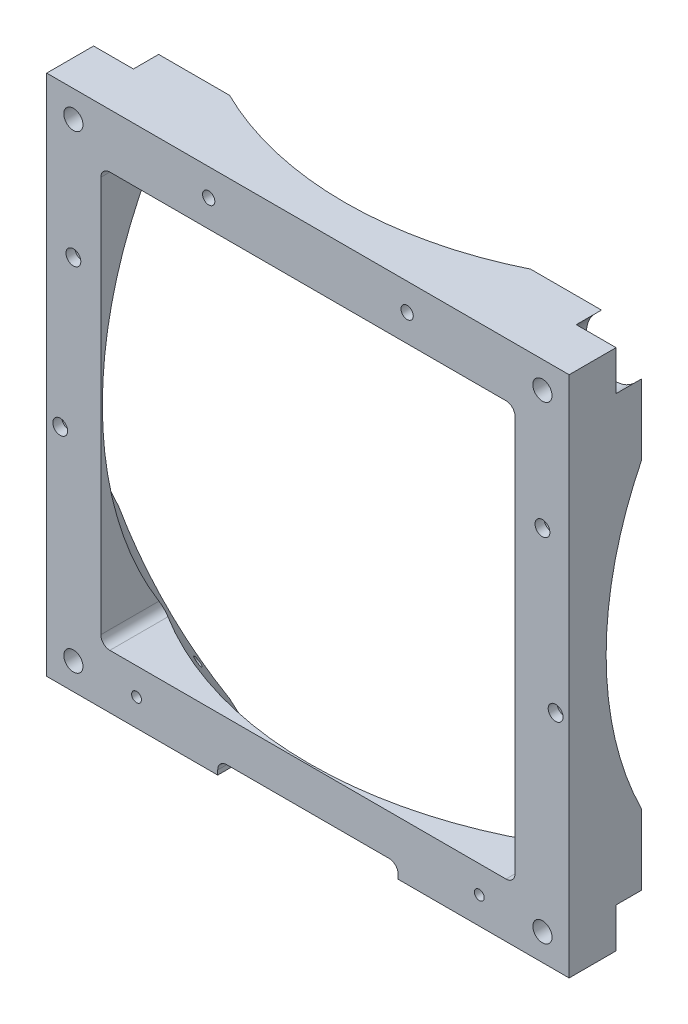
ISO-10303-21;
HEADER;
FILE_DESCRIPTION(('STEP AP214'),'2;1');
FILE_NAME('part.step','',(''),(''),'','','');
FILE_SCHEMA(('AUTOMOTIVE_DESIGN { 1 0 10303 214 1 1 1 1 }'));
ENDSEC;
DATA;
#1=APPLICATION_CONTEXT('core data for automotive mechanical design processes');
#2=APPLICATION_PROTOCOL_DEFINITION('international standard','automotive_design',2000,#1);
#3=PRODUCT_CONTEXT('',#1,'mechanical');
#4=PRODUCT('Part','Part','',(#3));
#5=PRODUCT_RELATED_PRODUCT_CATEGORY('part','',(#4));
#6=PRODUCT_DEFINITION_FORMATION('','',#4);
#7=PRODUCT_DEFINITION_CONTEXT('part definition',#1,'design');
#8=PRODUCT_DEFINITION('design','',#6,#7);
#9=PRODUCT_DEFINITION_SHAPE('','',#8);
#10=(LENGTH_UNIT() NAMED_UNIT(*) SI_UNIT(.MILLI.,.METRE.));
#11=(NAMED_UNIT(*) PLANE_ANGLE_UNIT() SI_UNIT($,.RADIAN.));
#12=(NAMED_UNIT(*) SI_UNIT($,.STERADIAN.) SOLID_ANGLE_UNIT());
#13=UNCERTAINTY_MEASURE_WITH_UNIT(LENGTH_MEASURE(1.E-05),#10,'distance_accuracy_value','');
#14=(GEOMETRIC_REPRESENTATION_CONTEXT(3) GLOBAL_UNCERTAINTY_ASSIGNED_CONTEXT((#13)) GLOBAL_UNIT_ASSIGNED_CONTEXT((#10,
#11,#12)) REPRESENTATION_CONTEXT('',''));
#15=CARTESIAN_POINT('',(0.,0.,0.));
#16=DIRECTION('',(0.,0.,1.));
#17=DIRECTION('',(1.,0.,0.));
#18=AXIS2_PLACEMENT_3D('',#15,#16,#17);
#19=CARTESIAN_POINT('',(91.9479999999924,-91.9480000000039,25.4));
#20=DIRECTION('',(0.,1.,0.));
#21=DIRECTION('',(-1.,0.,0.));
#22=AXIS2_PLACEMENT_3D('',#19,#20,#21);
#23=PLANE('',#22);
#24=CARTESIAN_POINT('',(0.,-91.9480000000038,-107.1626));
#25=DIRECTION('',(0.,1.,0.));
#26=DIRECTION('',(-1.,0.,0.));
#27=AXIS2_PLACEMENT_3D('',#24,#25,#26);
#28=CIRCLE('',#27,119.540685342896);
#29=CARTESIAN_POINT('',(-31.75,-91.9480000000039,8.08458197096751));
#30=VERTEX_POINT('',#29);
#31=CARTESIAN_POINT('',(-52.9731310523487,-91.9480000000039,0.));
#32=VERTEX_POINT('',#31);
#33=EDGE_CURVE('E299',#30,#32,#28,.F.);
#34=ORIENTED_EDGE('',*,*,#33,.F.);
#35=DIRECTION('',(0.,0.,-1.));
#36=VECTOR('',#35,1.);
#37=CARTESIAN_POINT('',(-31.75,-91.9480000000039,49.2328138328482));
#38=LINE('',#37,#36);
#39=CARTESIAN_POINT('',(-31.75,-91.9480000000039,25.4));
#40=VERTEX_POINT('',#39);
#41=EDGE_CURVE('E286',#40,#30,#38,.T.);
#42=ORIENTED_EDGE('',*,*,#41,.F.);
#43=DIRECTION('',(1.,0.,0.));
#44=VECTOR('',#43,1.);
#45=CARTESIAN_POINT('',(91.9479999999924,-91.9480000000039,25.4));
#46=LINE('',#45,#44);
#47=CARTESIAN_POINT('',(-91.948,-91.9480000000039,25.4));
#48=VERTEX_POINT('',#47);
#49=EDGE_CURVE('E297',#48,#40,#46,.T.);
#50=ORIENTED_EDGE('',*,*,#49,.F.);
#51=DIRECTION('',(0.,0.,-1.));
#52=VECTOR('',#51,1.);
#53=CARTESIAN_POINT('',(-91.948,-91.9480000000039,25.4));
#54=LINE('',#53,#52);
#55=CARTESIAN_POINT('',(-91.948,-91.9480000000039,8.89));
#56=VERTEX_POINT('',#55);
#57=EDGE_CURVE('E334',#48,#56,#54,.T.);
#58=ORIENTED_EDGE('',*,*,#57,.T.);
#59=DIRECTION('',(-1.,0.,0.));
#60=VECTOR('',#59,1.);
#61=CARTESIAN_POINT('',(91.9479999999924,-91.9480000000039,8.89));
#62=LINE('',#61,#60);
#63=CARTESIAN_POINT('',(-77.938800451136,-91.9480000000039,8.89));
#64=VERTEX_POINT('',#63);
#65=EDGE_CURVE('E357',#64,#56,#62,.T.);
#66=ORIENTED_EDGE('',*,*,#65,.F.);
#67=DIRECTION('',(0.,0.,-1.));
#68=VECTOR('',#67,1.);
#69=CARTESIAN_POINT('',(-77.938800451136,-91.9480000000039,25.4));
#70=LINE('',#69,#68);
#71=CARTESIAN_POINT('',(-77.938800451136,-91.9480000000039,0.));
#72=VERTEX_POINT('',#71);
#73=EDGE_CURVE('E353',#64,#72,#70,.T.);
#74=ORIENTED_EDGE('',*,*,#73,.T.);
#75=DIRECTION('',(1.,0.,0.));
#76=VECTOR('',#75,1.);
#77=CARTESIAN_POINT('',(91.9479999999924,-91.9480000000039,0.));
#78=LINE('',#77,#76);
#79=EDGE_CURVE('E323',#72,#32,#78,.T.);
#80=ORIENTED_EDGE('',*,*,#79,.T.);
#81=EDGE_LOOP('',(#34,#42,#50,#58,#66,#74,#80));
#82=FACE_BOUND('',#81,.T.);
#83=ADVANCED_FACE('F35',(#82),#23,.F.);
#84=CARTESIAN_POINT('',(82.55,-82.55,25.4));
#85=DIRECTION('',(0.,0.,-1.));
#86=DIRECTION('',(-1.,0.,0.));
#87=AXIS2_PLACEMENT_3D('',#84,#85,#86);
#88=CYLINDRICAL_SURFACE('',#87,3.37819999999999);
#89=CARTESIAN_POINT('',(82.55,-82.55,25.4));
#90=DIRECTION('',(0.,0.,1.));
#91=DIRECTION('',(1.,0.,0.));
#92=AXIS2_PLACEMENT_3D('',#89,#90,#91);
#93=CIRCLE('',#92,3.37819999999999);
#94=CARTESIAN_POINT('',(79.1718,-82.55,25.4));
#95=VERTEX_POINT('',#94);
#96=EDGE_CURVE('E641',#95,#95,#93,.T.);
#97=CARTESIAN_POINT('',(82.55,-82.55,8.89));
#98=DIRECTION('',(0.,0.,-1.));
#99=DIRECTION('',(-1.,0.,0.));
#100=AXIS2_PLACEMENT_3D('',#97,#98,#99);
#101=CIRCLE('',#100,3.37819999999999);
#102=CARTESIAN_POINT('',(79.1718,-82.55,8.89));
#103=VERTEX_POINT('',#102);
#104=EDGE_CURVE('E376',#103,#103,#101,.T.);
#105=CARTESIAN_POINT('',(79.1718,-82.55,25.4));
#106=CARTESIAN_POINT('',(79.1718,-82.55,25.2280208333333));
#107=CARTESIAN_POINT('',(79.1718,-82.55,25.0560416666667));
#108=CARTESIAN_POINT('',(79.1718,-82.55,24.7120833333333));
#109=CARTESIAN_POINT('',(79.1718,-82.55,24.5401041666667));
#110=CARTESIAN_POINT('',(79.1718,-82.55,24.1961458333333));
#111=CARTESIAN_POINT('',(79.1718,-82.55,24.0241666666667));
#112=CARTESIAN_POINT('',(79.1718,-82.55,23.6802083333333));
#113=CARTESIAN_POINT('',(79.1718,-82.55,23.5082291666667));
#114=CARTESIAN_POINT('',(79.1718,-82.55,23.1642708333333));
#115=CARTESIAN_POINT('',(79.1718,-82.55,22.9922916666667));
#116=CARTESIAN_POINT('',(79.1718,-82.55,22.6483333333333));
#117=CARTESIAN_POINT('',(79.1718,-82.55,22.4763541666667));
#118=CARTESIAN_POINT('',(79.1718,-82.55,22.1323958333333));
#119=CARTESIAN_POINT('',(79.1718,-82.55,21.9604166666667));
#120=CARTESIAN_POINT('',(79.1718,-82.55,21.6164583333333));
#121=CARTESIAN_POINT('',(79.1718,-82.55,21.4444791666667));
#122=CARTESIAN_POINT('',(79.1718,-82.55,21.1005208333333));
#123=CARTESIAN_POINT('',(79.1718,-82.55,20.9285416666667));
#124=CARTESIAN_POINT('',(79.1718,-82.55,20.5845833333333));
#125=CARTESIAN_POINT('',(79.1718,-82.55,20.4126041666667));
#126=CARTESIAN_POINT('',(79.1718,-82.55,20.0686458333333));
#127=CARTESIAN_POINT('',(79.1718,-82.55,19.8966666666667));
#128=CARTESIAN_POINT('',(79.1718,-82.55,19.5527083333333));
#129=CARTESIAN_POINT('',(79.1718,-82.55,19.3807291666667));
#130=CARTESIAN_POINT('',(79.1718,-82.55,19.0367708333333));
#131=CARTESIAN_POINT('',(79.1718,-82.55,18.8647916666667));
#132=CARTESIAN_POINT('',(79.1718,-82.55,18.5208333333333));
#133=CARTESIAN_POINT('',(79.1718,-82.55,18.3488541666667));
#134=CARTESIAN_POINT('',(79.1718,-82.55,18.0048958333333));
#135=CARTESIAN_POINT('',(79.1718,-82.55,17.8329166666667));
#136=CARTESIAN_POINT('',(79.1718,-82.55,17.4889583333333));
#137=CARTESIAN_POINT('',(79.1718,-82.55,17.3169791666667));
#138=CARTESIAN_POINT('',(79.1718,-82.55,16.9730208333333));
#139=CARTESIAN_POINT('',(79.1718,-82.55,16.8010416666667));
#140=CARTESIAN_POINT('',(79.1718,-82.55,16.4570833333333));
#141=CARTESIAN_POINT('',(79.1718,-82.55,16.2851041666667));
#142=CARTESIAN_POINT('',(79.1718,-82.55,15.9411458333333));
#143=CARTESIAN_POINT('',(79.1718,-82.55,15.7691666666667));
#144=CARTESIAN_POINT('',(79.1718,-82.55,15.4252083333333));
#145=CARTESIAN_POINT('',(79.1718,-82.55,15.2532291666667));
#146=CARTESIAN_POINT('',(79.1718,-82.55,14.9092708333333));
#147=CARTESIAN_POINT('',(79.1718,-82.55,14.7372916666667));
#148=CARTESIAN_POINT('',(79.1718,-82.55,14.3933333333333));
#149=CARTESIAN_POINT('',(79.1718,-82.55,14.2213541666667));
#150=CARTESIAN_POINT('',(79.1718,-82.55,13.8773958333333));
#151=CARTESIAN_POINT('',(79.1718,-82.55,13.7054166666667));
#152=CARTESIAN_POINT('',(79.1718,-82.55,13.3614583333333));
#153=CARTESIAN_POINT('',(79.1718,-82.55,13.1894791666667));
#154=CARTESIAN_POINT('',(79.1718,-82.55,12.8455208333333));
#155=CARTESIAN_POINT('',(79.1718,-82.55,12.6735416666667));
#156=CARTESIAN_POINT('',(79.1718,-82.55,12.3295833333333));
#157=CARTESIAN_POINT('',(79.1718,-82.55,12.1576041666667));
#158=CARTESIAN_POINT('',(79.1718,-82.55,11.8136458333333));
#159=CARTESIAN_POINT('',(79.1718,-82.55,11.6416666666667));
#160=CARTESIAN_POINT('',(79.1718,-82.55,11.2977083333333));
#161=CARTESIAN_POINT('',(79.1718,-82.55,11.1257291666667));
#162=CARTESIAN_POINT('',(79.1718,-82.55,10.7817708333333));
#163=CARTESIAN_POINT('',(79.1718,-82.55,10.6097916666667));
#164=CARTESIAN_POINT('',(79.1718,-82.55,10.2658333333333));
#165=CARTESIAN_POINT('',(79.1718,-82.55,10.0938541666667));
#166=CARTESIAN_POINT('',(79.1718,-82.55,9.74989583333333));
#167=CARTESIAN_POINT('',(79.1718,-82.55,9.57791666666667));
#168=CARTESIAN_POINT('',(79.1718,-82.55,9.23395833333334));
#169=CARTESIAN_POINT('',(79.1718,-82.55,9.06197916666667));
#170=CARTESIAN_POINT('',(79.1718,-82.55,8.89));
#171=B_SPLINE_CURVE_WITH_KNOTS('',3,(#105,#106,#107,#108,#109,#110,#111,#112,#113,#114,#115,
#116,#117,#118,#119,#120,#121,#122,#123,#124,#125,#126,#127,#128,#129,#130,#131,#132,#133,#134,
#135,#136,#137,#138,#139,#140,#141,#142,#143,#144,#145,#146,#147,#148,#149,#150,#151,#152,#153,
#154,#155,#156,#157,#158,#159,#160,#161,#162,#163,#164,#165,#166,#167,#168,#169,#170),
.UNSPECIFIED.,.F.,.F.,(4,2,2,2,2,2,2,2,2,2,2,2,2,2,2,2,2,2,2,2,2,2,2,2,2,2,2,2,2,2,2,2,4),(0.,
0.515937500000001,1.031875,1.5478125,2.06375,2.5796875,3.095625,3.6115625,4.1275,4.6434375,
5.159375,5.6753125,6.19125,6.7071875,7.223125,7.73906249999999,8.255,8.7709375,9.286875,
9.80281249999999,10.31875,10.8346875,11.350625,11.8665625,12.3825,12.8984375,13.414375,
13.9303125,14.44625,14.9621875,15.478125,15.9940625,16.51),.UNSPECIFIED.);
#172=EDGE_CURVE('BSEAM478',#95,#103,#171,.T.);
#173=ORIENTED_EDGE('',*,*,#96,.T.);
#174=ORIENTED_EDGE('',*,*,#104,.T.);
#175=ORIENTED_EDGE('',*,*,#172,.T.);
#176=ORIENTED_EDGE('',*,*,#172,.F.);
#177=EDGE_LOOP('',(#173,#175,#174,#176));
#178=FACE_BOUND('',#177,.T.);
#179=ADVANCED_FACE('F478',(#178),#88,.F.);
#180=CARTESIAN_POINT('',(-82.55,82.55,25.4));
#181=DIRECTION('',(0.,0.,-1.));
#182=DIRECTION('',(-1.,0.,0.));
#183=AXIS2_PLACEMENT_3D('',#180,#181,#182);
#184=CYLINDRICAL_SURFACE('',#183,3.37819999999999);
#185=CARTESIAN_POINT('',(-82.55,82.55,25.4));
#186=DIRECTION('',(0.,0.,1.));
#187=DIRECTION('',(1.,0.,0.));
#188=AXIS2_PLACEMENT_3D('',#185,#186,#187);
#189=CIRCLE('',#188,3.37819999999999);
#190=CARTESIAN_POINT('',(-85.9282,82.55,25.4));
#191=VERTEX_POINT('',#190);
#192=EDGE_CURVE('E647',#191,#191,#189,.T.);
#193=CARTESIAN_POINT('',(-82.55,82.55,8.89));
#194=DIRECTION('',(0.,0.,-1.));
#195=DIRECTION('',(-1.,0.,0.));
#196=AXIS2_PLACEMENT_3D('',#193,#194,#195);
#197=CIRCLE('',#196,3.37819999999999);
#198=CARTESIAN_POINT('',(-85.9282,82.55,8.89));
#199=VERTEX_POINT('',#198);
#200=EDGE_CURVE('E365',#199,#199,#197,.T.);
#201=CARTESIAN_POINT('',(-85.9282,82.55,25.4));
#202=CARTESIAN_POINT('',(-85.9282,82.55,25.2280208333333));
#203=CARTESIAN_POINT('',(-85.9282,82.55,25.0560416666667));
#204=CARTESIAN_POINT('',(-85.9282,82.55,24.7120833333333));
#205=CARTESIAN_POINT('',(-85.9282,82.55,24.5401041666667));
#206=CARTESIAN_POINT('',(-85.9282,82.55,24.1961458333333));
#207=CARTESIAN_POINT('',(-85.9282,82.55,24.0241666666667));
#208=CARTESIAN_POINT('',(-85.9282,82.55,23.6802083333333));
#209=CARTESIAN_POINT('',(-85.9282,82.55,23.5082291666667));
#210=CARTESIAN_POINT('',(-85.9282,82.55,23.1642708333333));
#211=CARTESIAN_POINT('',(-85.9282,82.55,22.9922916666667));
#212=CARTESIAN_POINT('',(-85.9282,82.55,22.6483333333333));
#213=CARTESIAN_POINT('',(-85.9282,82.55,22.4763541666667));
#214=CARTESIAN_POINT('',(-85.9282,82.55,22.1323958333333));
#215=CARTESIAN_POINT('',(-85.9282,82.55,21.9604166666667));
#216=CARTESIAN_POINT('',(-85.9282,82.55,21.6164583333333));
#217=CARTESIAN_POINT('',(-85.9282,82.55,21.4444791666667));
#218=CARTESIAN_POINT('',(-85.9282,82.55,21.1005208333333));
#219=CARTESIAN_POINT('',(-85.9282,82.55,20.9285416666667));
#220=CARTESIAN_POINT('',(-85.9282,82.55,20.5845833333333));
#221=CARTESIAN_POINT('',(-85.9282,82.55,20.4126041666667));
#222=CARTESIAN_POINT('',(-85.9282,82.55,20.0686458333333));
#223=CARTESIAN_POINT('',(-85.9282,82.55,19.8966666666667));
#224=CARTESIAN_POINT('',(-85.9282,82.55,19.5527083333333));
#225=CARTESIAN_POINT('',(-85.9282,82.55,19.3807291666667));
#226=CARTESIAN_POINT('',(-85.9282,82.55,19.0367708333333));
#227=CARTESIAN_POINT('',(-85.9282,82.55,18.8647916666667));
#228=CARTESIAN_POINT('',(-85.9282,82.55,18.5208333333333));
#229=CARTESIAN_POINT('',(-85.9282,82.55,18.3488541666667));
#230=CARTESIAN_POINT('',(-85.9282,82.55,18.0048958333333));
#231=CARTESIAN_POINT('',(-85.9282,82.55,17.8329166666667));
#232=CARTESIAN_POINT('',(-85.9282,82.55,17.4889583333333));
#233=CARTESIAN_POINT('',(-85.9282,82.55,17.3169791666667));
#234=CARTESIAN_POINT('',(-85.9282,82.55,16.9730208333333));
#235=CARTESIAN_POINT('',(-85.9282,82.55,16.8010416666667));
#236=CARTESIAN_POINT('',(-85.9282,82.55,16.4570833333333));
#237=CARTESIAN_POINT('',(-85.9282,82.55,16.2851041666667));
#238=CARTESIAN_POINT('',(-85.9282,82.55,15.9411458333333));
#239=CARTESIAN_POINT('',(-85.9282,82.55,15.7691666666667));
#240=CARTESIAN_POINT('',(-85.9282,82.55,15.4252083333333));
#241=CARTESIAN_POINT('',(-85.9282,82.55,15.2532291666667));
#242=CARTESIAN_POINT('',(-85.9282,82.55,14.9092708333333));
#243=CARTESIAN_POINT('',(-85.9282,82.55,14.7372916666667));
#244=CARTESIAN_POINT('',(-85.9282,82.55,14.3933333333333));
#245=CARTESIAN_POINT('',(-85.9282,82.55,14.2213541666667));
#246=CARTESIAN_POINT('',(-85.9282,82.55,13.8773958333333));
#247=CARTESIAN_POINT('',(-85.9282,82.55,13.7054166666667));
#248=CARTESIAN_POINT('',(-85.9282,82.55,13.3614583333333));
#249=CARTESIAN_POINT('',(-85.9282,82.55,13.1894791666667));
#250=CARTESIAN_POINT('',(-85.9282,82.55,12.8455208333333));
#251=CARTESIAN_POINT('',(-85.9282,82.55,12.6735416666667));
#252=CARTESIAN_POINT('',(-85.9282,82.55,12.3295833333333));
#253=CARTESIAN_POINT('',(-85.9282,82.55,12.1576041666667));
#254=CARTESIAN_POINT('',(-85.9282,82.55,11.8136458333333));
#255=CARTESIAN_POINT('',(-85.9282,82.55,11.6416666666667));
#256=CARTESIAN_POINT('',(-85.9282,82.55,11.2977083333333));
#257=CARTESIAN_POINT('',(-85.9282,82.55,11.1257291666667));
#258=CARTESIAN_POINT('',(-85.9282,82.55,10.7817708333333));
#259=CARTESIAN_POINT('',(-85.9282,82.55,10.6097916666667));
#260=CARTESIAN_POINT('',(-85.9282,82.55,10.2658333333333));
#261=CARTESIAN_POINT('',(-85.9282,82.55,10.0938541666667));
#262=CARTESIAN_POINT('',(-85.9282,82.55,9.74989583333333));
#263=CARTESIAN_POINT('',(-85.9282,82.55,9.57791666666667));
#264=CARTESIAN_POINT('',(-85.9282,82.55,9.23395833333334));
#265=CARTESIAN_POINT('',(-85.9282,82.55,9.06197916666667));
#266=CARTESIAN_POINT('',(-85.9282,82.55,8.89));
#267=B_SPLINE_CURVE_WITH_KNOTS('',3,(#201,#202,#203,#204,#205,#206,#207,#208,#209,#210,#211,
#212,#213,#214,#215,#216,#217,#218,#219,#220,#221,#222,#223,#224,#225,#226,#227,#228,#229,#230,
#231,#232,#233,#234,#235,#236,#237,#238,#239,#240,#241,#242,#243,#244,#245,#246,#247,#248,#249,
#250,#251,#252,#253,#254,#255,#256,#257,#258,#259,#260,#261,#262,#263,#264,#265,#266),
.UNSPECIFIED.,.F.,.F.,(4,2,2,2,2,2,2,2,2,2,2,2,2,2,2,2,2,2,2,2,2,2,2,2,2,2,2,2,2,2,2,2,4),(0.,
0.515937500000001,1.031875,1.5478125,2.06375,2.5796875,3.095625,3.6115625,4.1275,4.6434375,
5.159375,5.6753125,6.19125,6.7071875,7.223125,7.73906249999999,8.255,8.7709375,9.286875,
9.80281249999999,10.31875,10.8346875,11.350625,11.8665625,12.3825,12.8984375,13.414375,
13.9303125,14.44625,14.9621875,15.478125,15.9940625,16.51),.UNSPECIFIED.);
#268=EDGE_CURVE('BSEAM484',#191,#199,#267,.T.);
#269=ORIENTED_EDGE('',*,*,#192,.T.);
#270=ORIENTED_EDGE('',*,*,#200,.T.);
#271=ORIENTED_EDGE('',*,*,#268,.T.);
#272=ORIENTED_EDGE('',*,*,#268,.F.);
#273=EDGE_LOOP('',(#269,#271,#270,#272));
#274=FACE_BOUND('',#273,.T.);
#275=ADVANCED_FACE('F484',(#274),#184,.F.);
#276=CARTESIAN_POINT('',(-82.55,-82.55,25.4));
#277=DIRECTION('',(0.,0.,-1.));
#278=DIRECTION('',(-1.,0.,0.));
#279=AXIS2_PLACEMENT_3D('',#276,#277,#278);
#280=CYLINDRICAL_SURFACE('',#279,3.37819999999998);
#281=CARTESIAN_POINT('',(-82.55,-82.55,25.4));
#282=DIRECTION('',(0.,0.,1.));
#283=DIRECTION('',(1.,0.,0.));
#284=AXIS2_PLACEMENT_3D('',#281,#282,#283);
#285=CIRCLE('',#284,3.37819999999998);
#286=CARTESIAN_POINT('',(-85.9282,-82.55,25.4));
#287=VERTEX_POINT('',#286);
#288=EDGE_CURVE('E638',#287,#287,#285,.T.);
#289=CARTESIAN_POINT('',(-82.55,-82.55,8.89));
#290=DIRECTION('',(0.,0.,-1.));
#291=DIRECTION('',(-1.,0.,0.));
#292=AXIS2_PLACEMENT_3D('',#289,#290,#291);
#293=CIRCLE('',#292,3.37819999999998);
#294=CARTESIAN_POINT('',(-85.9282,-82.55,8.89));
#295=VERTEX_POINT('',#294);
#296=EDGE_CURVE('E354',#295,#295,#293,.T.);
#297=CARTESIAN_POINT('',(-85.9282,-82.55,25.4));
#298=CARTESIAN_POINT('',(-85.9282,-82.55,25.2280208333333));
#299=CARTESIAN_POINT('',(-85.9282,-82.55,25.0560416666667));
#300=CARTESIAN_POINT('',(-85.9282,-82.55,24.7120833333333));
#301=CARTESIAN_POINT('',(-85.9282,-82.55,24.5401041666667));
#302=CARTESIAN_POINT('',(-85.9282,-82.55,24.1961458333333));
#303=CARTESIAN_POINT('',(-85.9282,-82.55,24.0241666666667));
#304=CARTESIAN_POINT('',(-85.9282,-82.55,23.6802083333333));
#305=CARTESIAN_POINT('',(-85.9282,-82.55,23.5082291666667));
#306=CARTESIAN_POINT('',(-85.9282,-82.55,23.1642708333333));
#307=CARTESIAN_POINT('',(-85.9282,-82.55,22.9922916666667));
#308=CARTESIAN_POINT('',(-85.9282,-82.55,22.6483333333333));
#309=CARTESIAN_POINT('',(-85.9282,-82.55,22.4763541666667));
#310=CARTESIAN_POINT('',(-85.9282,-82.55,22.1323958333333));
#311=CARTESIAN_POINT('',(-85.9282,-82.55,21.9604166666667));
#312=CARTESIAN_POINT('',(-85.9282,-82.55,21.6164583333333));
#313=CARTESIAN_POINT('',(-85.9282,-82.55,21.4444791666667));
#314=CARTESIAN_POINT('',(-85.9282,-82.55,21.1005208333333));
#315=CARTESIAN_POINT('',(-85.9282,-82.55,20.9285416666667));
#316=CARTESIAN_POINT('',(-85.9282,-82.55,20.5845833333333));
#317=CARTESIAN_POINT('',(-85.9282,-82.55,20.4126041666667));
#318=CARTESIAN_POINT('',(-85.9282,-82.55,20.0686458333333));
#319=CARTESIAN_POINT('',(-85.9282,-82.55,19.8966666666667));
#320=CARTESIAN_POINT('',(-85.9282,-82.55,19.5527083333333));
#321=CARTESIAN_POINT('',(-85.9282,-82.55,19.3807291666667));
#322=CARTESIAN_POINT('',(-85.9282,-82.55,19.0367708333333));
#323=CARTESIAN_POINT('',(-85.9282,-82.55,18.8647916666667));
#324=CARTESIAN_POINT('',(-85.9282,-82.55,18.5208333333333));
#325=CARTESIAN_POINT('',(-85.9282,-82.55,18.3488541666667));
#326=CARTESIAN_POINT('',(-85.9282,-82.55,18.0048958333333));
#327=CARTESIAN_POINT('',(-85.9282,-82.55,17.8329166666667));
#328=CARTESIAN_POINT('',(-85.9282,-82.55,17.4889583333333));
#329=CARTESIAN_POINT('',(-85.9282,-82.55,17.3169791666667));
#330=CARTESIAN_POINT('',(-85.9282,-82.55,16.9730208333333));
#331=CARTESIAN_POINT('',(-85.9282,-82.55,16.8010416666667));
#332=CARTESIAN_POINT('',(-85.9282,-82.55,16.4570833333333));
#333=CARTESIAN_POINT('',(-85.9282,-82.55,16.2851041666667));
#334=CARTESIAN_POINT('',(-85.9282,-82.55,15.9411458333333));
#335=CARTESIAN_POINT('',(-85.9282,-82.55,15.7691666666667));
#336=CARTESIAN_POINT('',(-85.9282,-82.55,15.4252083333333));
#337=CARTESIAN_POINT('',(-85.9282,-82.55,15.2532291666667));
#338=CARTESIAN_POINT('',(-85.9282,-82.55,14.9092708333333));
#339=CARTESIAN_POINT('',(-85.9282,-82.55,14.7372916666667));
#340=CARTESIAN_POINT('',(-85.9282,-82.55,14.3933333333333));
#341=CARTESIAN_POINT('',(-85.9282,-82.55,14.2213541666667));
#342=CARTESIAN_POINT('',(-85.9282,-82.55,13.8773958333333));
#343=CARTESIAN_POINT('',(-85.9282,-82.55,13.7054166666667));
#344=CARTESIAN_POINT('',(-85.9282,-82.55,13.3614583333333));
#345=CARTESIAN_POINT('',(-85.9282,-82.55,13.1894791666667));
#346=CARTESIAN_POINT('',(-85.9282,-82.55,12.8455208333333));
#347=CARTESIAN_POINT('',(-85.9282,-82.55,12.6735416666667));
#348=CARTESIAN_POINT('',(-85.9282,-82.55,12.3295833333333));
#349=CARTESIAN_POINT('',(-85.9282,-82.55,12.1576041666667));
#350=CARTESIAN_POINT('',(-85.9282,-82.55,11.8136458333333));
#351=CARTESIAN_POINT('',(-85.9282,-82.55,11.6416666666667));
#352=CARTESIAN_POINT('',(-85.9282,-82.55,11.2977083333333));
#353=CARTESIAN_POINT('',(-85.9282,-82.55,11.1257291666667));
#354=CARTESIAN_POINT('',(-85.9282,-82.55,10.7817708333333));
#355=CARTESIAN_POINT('',(-85.9282,-82.55,10.6097916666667));
#356=CARTESIAN_POINT('',(-85.9282,-82.55,10.2658333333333));
#357=CARTESIAN_POINT('',(-85.9282,-82.55,10.0938541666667));
#358=CARTESIAN_POINT('',(-85.9282,-82.55,9.74989583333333));
#359=CARTESIAN_POINT('',(-85.9282,-82.55,9.57791666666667));
#360=CARTESIAN_POINT('',(-85.9282,-82.55,9.23395833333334));
#361=CARTESIAN_POINT('',(-85.9282,-82.55,9.06197916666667));
#362=CARTESIAN_POINT('',(-85.9282,-82.55,8.89));
#363=B_SPLINE_CURVE_WITH_KNOTS('',3,(#297,#298,#299,#300,#301,#302,#303,#304,#305,#306,#307,
#308,#309,#310,#311,#312,#313,#314,#315,#316,#317,#318,#319,#320,#321,#322,#323,#324,#325,#326,
#327,#328,#329,#330,#331,#332,#333,#334,#335,#336,#337,#338,#339,#340,#341,#342,#343,#344,#345,
#346,#347,#348,#349,#350,#351,#352,#353,#354,#355,#356,#357,#358,#359,#360,#361,#362),
.UNSPECIFIED.,.F.,.F.,(4,2,2,2,2,2,2,2,2,2,2,2,2,2,2,2,2,2,2,2,2,2,2,2,2,2,2,2,2,2,2,2,4),(0.,
0.515937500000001,1.031875,1.5478125,2.06375,2.5796875,3.095625,3.6115625,4.1275,4.6434375,
5.159375,5.6753125,6.19125,6.7071875,7.223125,7.73906249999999,8.255,8.7709375,9.286875,
9.80281249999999,10.31875,10.8346875,11.350625,11.8665625,12.3825,12.8984375,13.414375,
13.9303125,14.44625,14.9621875,15.478125,15.9940625,16.51),.UNSPECIFIED.);
#364=EDGE_CURVE('BSEAM752',#287,#295,#363,.T.);
#365=ORIENTED_EDGE('',*,*,#288,.T.);
#366=ORIENTED_EDGE('',*,*,#296,.T.);
#367=ORIENTED_EDGE('',*,*,#364,.T.);
#368=ORIENTED_EDGE('',*,*,#364,.F.);
#369=EDGE_LOOP('',(#365,#367,#366,#368));
#370=FACE_BOUND('',#369,.T.);
#371=ADVANCED_FACE('F752',(#370),#280,.F.);
#372=CARTESIAN_POINT('',(82.55,82.55,25.4));
#373=DIRECTION('',(0.,0.,-1.));
#374=DIRECTION('',(-1.,0.,0.));
#375=AXIS2_PLACEMENT_3D('',#372,#373,#374);
#376=CYLINDRICAL_SURFACE('',#375,3.37819999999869);
#377=CARTESIAN_POINT('',(82.55,82.55,25.4));
#378=DIRECTION('',(0.,0.,1.));
#379=DIRECTION('',(-1.,0.,0.));
#380=AXIS2_PLACEMENT_3D('',#377,#378,#379);
#381=CIRCLE('',#380,3.37819999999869);
#382=CARTESIAN_POINT('',(79.1718000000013,82.55,25.4));
#383=VERTEX_POINT('',#382);
#384=EDGE_CURVE('E644',#383,#383,#381,.T.);
#385=CARTESIAN_POINT('',(82.55,82.55,8.89));
#386=DIRECTION('',(0.,0.,-1.));
#387=DIRECTION('',(-1.,0.,0.));
#388=AXIS2_PLACEMENT_3D('',#385,#386,#387);
#389=CIRCLE('',#388,3.37819999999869);
#390=CARTESIAN_POINT('',(79.1718000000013,82.55,8.89));
#391=VERTEX_POINT('',#390);
#392=EDGE_CURVE('E343',#391,#391,#389,.T.);
#393=CARTESIAN_POINT('',(79.1718000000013,82.55,25.4));
#394=CARTESIAN_POINT('',(79.1718000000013,82.55,25.2280208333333));
#395=CARTESIAN_POINT('',(79.1718000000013,82.55,25.0560416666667));
#396=CARTESIAN_POINT('',(79.1718000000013,82.55,24.7120833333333));
#397=CARTESIAN_POINT('',(79.1718000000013,82.55,24.5401041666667));
#398=CARTESIAN_POINT('',(79.1718000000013,82.55,24.1961458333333));
#399=CARTESIAN_POINT('',(79.1718000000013,82.55,24.0241666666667));
#400=CARTESIAN_POINT('',(79.1718000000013,82.55,23.6802083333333));
#401=CARTESIAN_POINT('',(79.1718000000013,82.55,23.5082291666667));
#402=CARTESIAN_POINT('',(79.1718000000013,82.55,23.1642708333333));
#403=CARTESIAN_POINT('',(79.1718000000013,82.55,22.9922916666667));
#404=CARTESIAN_POINT('',(79.1718000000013,82.55,22.6483333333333));
#405=CARTESIAN_POINT('',(79.1718000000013,82.55,22.4763541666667));
#406=CARTESIAN_POINT('',(79.1718000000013,82.55,22.1323958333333));
#407=CARTESIAN_POINT('',(79.1718000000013,82.55,21.9604166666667));
#408=CARTESIAN_POINT('',(79.1718000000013,82.55,21.6164583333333));
#409=CARTESIAN_POINT('',(79.1718000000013,82.55,21.4444791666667));
#410=CARTESIAN_POINT('',(79.1718000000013,82.55,21.1005208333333));
#411=CARTESIAN_POINT('',(79.1718000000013,82.55,20.9285416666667));
#412=CARTESIAN_POINT('',(79.1718000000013,82.55,20.5845833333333));
#413=CARTESIAN_POINT('',(79.1718000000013,82.55,20.4126041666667));
#414=CARTESIAN_POINT('',(79.1718000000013,82.55,20.0686458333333));
#415=CARTESIAN_POINT('',(79.1718000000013,82.55,19.8966666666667));
#416=CARTESIAN_POINT('',(79.1718000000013,82.55,19.5527083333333));
#417=CARTESIAN_POINT('',(79.1718000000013,82.55,19.3807291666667));
#418=CARTESIAN_POINT('',(79.1718000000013,82.55,19.0367708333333));
#419=CARTESIAN_POINT('',(79.1718000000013,82.55,18.8647916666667));
#420=CARTESIAN_POINT('',(79.1718000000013,82.55,18.5208333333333));
#421=CARTESIAN_POINT('',(79.1718000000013,82.55,18.3488541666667));
#422=CARTESIAN_POINT('',(79.1718000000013,82.55,18.0048958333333));
#423=CARTESIAN_POINT('',(79.1718000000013,82.55,17.8329166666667));
#424=CARTESIAN_POINT('',(79.1718000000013,82.55,17.4889583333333));
#425=CARTESIAN_POINT('',(79.1718000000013,82.55,17.3169791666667));
#426=CARTESIAN_POINT('',(79.1718000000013,82.55,16.9730208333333));
#427=CARTESIAN_POINT('',(79.1718000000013,82.55,16.8010416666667));
#428=CARTESIAN_POINT('',(79.1718000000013,82.55,16.4570833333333));
#429=CARTESIAN_POINT('',(79.1718000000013,82.55,16.2851041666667));
#430=CARTESIAN_POINT('',(79.1718000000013,82.55,15.9411458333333));
#431=CARTESIAN_POINT('',(79.1718000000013,82.55,15.7691666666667));
#432=CARTESIAN_POINT('',(79.1718000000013,82.55,15.4252083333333));
#433=CARTESIAN_POINT('',(79.1718000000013,82.55,15.2532291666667));
#434=CARTESIAN_POINT('',(79.1718000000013,82.55,14.9092708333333));
#435=CARTESIAN_POINT('',(79.1718000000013,82.55,14.7372916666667));
#436=CARTESIAN_POINT('',(79.1718000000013,82.55,14.3933333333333));
#437=CARTESIAN_POINT('',(79.1718000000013,82.55,14.2213541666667));
#438=CARTESIAN_POINT('',(79.1718000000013,82.55,13.8773958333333));
#439=CARTESIAN_POINT('',(79.1718000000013,82.55,13.7054166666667));
#440=CARTESIAN_POINT('',(79.1718000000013,82.55,13.3614583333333));
#441=CARTESIAN_POINT('',(79.1718000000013,82.55,13.1894791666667));
#442=CARTESIAN_POINT('',(79.1718000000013,82.55,12.8455208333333));
#443=CARTESIAN_POINT('',(79.1718000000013,82.55,12.6735416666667));
#444=CARTESIAN_POINT('',(79.1718000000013,82.55,12.3295833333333));
#445=CARTESIAN_POINT('',(79.1718000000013,82.55,12.1576041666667));
#446=CARTESIAN_POINT('',(79.1718000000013,82.55,11.8136458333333));
#447=CARTESIAN_POINT('',(79.1718000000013,82.55,11.6416666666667));
#448=CARTESIAN_POINT('',(79.1718000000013,82.55,11.2977083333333));
#449=CARTESIAN_POINT('',(79.1718000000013,82.55,11.1257291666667));
#450=CARTESIAN_POINT('',(79.1718000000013,82.55,10.7817708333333));
#451=CARTESIAN_POINT('',(79.1718000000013,82.55,10.6097916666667));
#452=CARTESIAN_POINT('',(79.1718000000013,82.55,10.2658333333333));
#453=CARTESIAN_POINT('',(79.1718000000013,82.55,10.0938541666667));
#454=CARTESIAN_POINT('',(79.1718000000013,82.55,9.74989583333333));
#455=CARTESIAN_POINT('',(79.1718000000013,82.55,9.57791666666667));
#456=CARTESIAN_POINT('',(79.1718000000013,82.55,9.23395833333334));
#457=CARTESIAN_POINT('',(79.1718000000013,82.55,9.06197916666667));
#458=CARTESIAN_POINT('',(79.1718000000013,82.55,8.89));
#459=B_SPLINE_CURVE_WITH_KNOTS('',3,(#393,#394,#395,#396,#397,#398,#399,#400,#401,#402,#403,
#404,#405,#406,#407,#408,#409,#410,#411,#412,#413,#414,#415,#416,#417,#418,#419,#420,#421,#422,
#423,#424,#425,#426,#427,#428,#429,#430,#431,#432,#433,#434,#435,#436,#437,#438,#439,#440,#441,
#442,#443,#444,#445,#446,#447,#448,#449,#450,#451,#452,#453,#454,#455,#456,#457,#458),
.UNSPECIFIED.,.F.,.F.,(4,2,2,2,2,2,2,2,2,2,2,2,2,2,2,2,2,2,2,2,2,2,2,2,2,2,2,2,2,2,2,2,4),(0.,
0.515937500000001,1.031875,1.5478125,2.06375,2.5796875,3.095625,3.6115625,4.1275,4.6434375,
5.159375,5.6753125,6.19125,6.7071875,7.223125,7.73906249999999,8.255,8.7709375,9.286875,
9.80281249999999,10.31875,10.8346875,11.350625,11.8665625,12.3825,12.8984375,13.414375,
13.9303125,14.44625,14.9621875,15.478125,15.9940625,16.51),.UNSPECIFIED.);
#460=EDGE_CURVE('BSEAM755',#383,#391,#459,.T.);
#461=ORIENTED_EDGE('',*,*,#384,.T.);
#462=ORIENTED_EDGE('',*,*,#392,.T.);
#463=ORIENTED_EDGE('',*,*,#460,.T.);
#464=ORIENTED_EDGE('',*,*,#460,.F.);
#465=EDGE_LOOP('',(#461,#463,#462,#464));
#466=FACE_BOUND('',#465,.T.);
#467=ADVANCED_FACE('F755',(#466),#376,.F.);
#468=CARTESIAN_POINT('',(91.9479999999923,91.948,0.));
#469=DIRECTION('',(0.,0.,-1.));
#470=DIRECTION('',(-1.,0.,0.));
#471=AXIS2_PLACEMENT_3D('',#468,#469,#470);
#472=PLANE('',#471);
#473=DIRECTION('',(0.707106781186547,0.707106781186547,0.));
#474=VECTOR('',#473,1.);
#475=CARTESIAN_POINT('',(-111.606219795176,-97.5970202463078,0.));
#476=LINE('',#475,#474);
#477=CARTESIAN_POINT('',(-91.948,-77.9388004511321,0.));
#478=VERTEX_POINT('',#477);
#479=CARTESIAN_POINT('',(-89.554599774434,-75.5454002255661,0.));
#480=VERTEX_POINT('',#479);
#481=EDGE_CURVE('E575',#478,#480,#476,.T.);
#482=ORIENTED_EDGE('',*,*,#481,.F.);
#483=DIRECTION('',(0.,-1.,0.));
#484=VECTOR('',#483,1.);
#485=CARTESIAN_POINT('',(-91.948,-91.9480000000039,0.));
#486=LINE('',#485,#484);
#487=CARTESIAN_POINT('',(-91.948,-52.9731310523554,0.));
#488=VERTEX_POINT('',#487);
#489=EDGE_CURVE('E318',#488,#478,#486,.T.);
#490=ORIENTED_EDGE('',*,*,#489,.F.);
#491=CARTESIAN_POINT('',(-1.01765044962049E-13,0.,0.));
#492=DIRECTION('',(0.,0.,-1.));
#493=DIRECTION('',(-1.,0.,0.));
#494=AXIS2_PLACEMENT_3D('',#491,#492,#493);
#495=CIRCLE('',#494,106.115914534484);
#496=EDGE_CURVE('E628',#488,#32,#495,.F.);
#497=ORIENTED_EDGE('',*,*,#496,.T.);
#498=ORIENTED_EDGE('',*,*,#79,.F.);
#499=DIRECTION('',(-0.707106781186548,-0.707106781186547,0.));
#500=VECTOR('',#499,1.);
#501=CARTESIAN_POINT('',(-75.545400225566,-89.554599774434,0.));
#502=LINE('',#501,#500);
#503=CARTESIAN_POINT('',(-75.545400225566,-89.554599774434,0.));
#504=VERTEX_POINT('',#503);
#505=EDGE_CURVE('E582',#504,#72,#502,.T.);
#506=ORIENTED_EDGE('',*,*,#505,.F.);
#507=CARTESIAN_POINT('',(-82.55,-82.55,0.));
#508=DIRECTION('',(0.,0.,-1.));
#509=DIRECTION('',(-1.,0.,0.));
#510=AXIS2_PLACEMENT_3D('',#507,#508,#509);
#511=CIRCLE('',#510,9.90600000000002);
#512=EDGE_CURVE('E570',#480,#504,#511,.T.);
#513=ORIENTED_EDGE('',*,*,#512,.F.);
#514=EDGE_LOOP('',(#482,#490,#497,#498,#506,#513));
#515=FACE_BOUND('',#514,.T.);
#516=ADVANCED_FACE('F679',(#515),#472,.T.);
#517=DIRECTION('',(0.707106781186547,-0.707106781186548,0.));
#518=VECTOR('',#517,1.);
#519=CARTESIAN_POINT('',(124.590568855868,-110.581369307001,0.));
#520=LINE('',#519,#518);
#521=CARTESIAN_POINT('',(89.5545997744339,-75.5454002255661,0.));
#522=VERTEX_POINT('',#521);
#523=CARTESIAN_POINT('',(91.9479999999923,-77.9388004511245,0.));
#524=VERTEX_POINT('',#523);
#525=EDGE_CURVE('E532',#522,#524,#520,.T.);
#526=ORIENTED_EDGE('',*,*,#525,.F.);
#527=CARTESIAN_POINT('',(82.55,-82.55,0.));
#528=DIRECTION('',(0.,0.,-1.));
#529=DIRECTION('',(-1.,0.,0.));
#530=AXIS2_PLACEMENT_3D('',#527,#528,#529);
#531=CIRCLE('',#530,9.90600000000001);
#532=CARTESIAN_POINT('',(75.545400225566,-89.554599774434,0.));
#533=VERTEX_POINT('',#532);
#534=EDGE_CURVE('E539',#533,#522,#531,.T.);
#535=ORIENTED_EDGE('',*,*,#534,.F.);
#536=DIRECTION('',(-0.707106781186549,0.707106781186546,0.));
#537=VECTOR('',#536,1.);
#538=CARTESIAN_POINT('',(75.545400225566,-89.554599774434,0.));
#539=LINE('',#538,#537);
#540=CARTESIAN_POINT('',(77.9388004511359,-91.9480000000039,0.));
#541=VERTEX_POINT('',#540);
#542=EDGE_CURVE('E393',#541,#533,#539,.T.);
#543=ORIENTED_EDGE('',*,*,#542,.F.);
#544=CARTESIAN_POINT('',(52.9731310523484,-91.9480000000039,0.));
#545=VERTEX_POINT('',#544);
#546=EDGE_CURVE('E322',#545,#541,#78,.T.);
#547=ORIENTED_EDGE('',*,*,#546,.F.);
#548=CARTESIAN_POINT('',(91.9479999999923,-52.9731310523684,0.));
#549=VERTEX_POINT('',#548);
#550=EDGE_CURVE('E627',#545,#549,#495,.F.);
#551=ORIENTED_EDGE('',*,*,#550,.T.);
#552=DIRECTION('',(0.,1.,0.));
#553=VECTOR('',#552,1.);
#554=CARTESIAN_POINT('',(91.9479999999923,91.948,0.));
#555=LINE('',#554,#553);
#556=EDGE_CURVE('E326',#524,#549,#555,.T.);
#557=ORIENTED_EDGE('',*,*,#556,.F.);
#558=EDGE_LOOP('',(#526,#535,#543,#547,#551,#557));
#559=FACE_BOUND('',#558,.T.);
#560=ADVANCED_FACE('F781',(#559),#472,.T.);
#561=DIRECTION('',(-0.707106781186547,-0.707106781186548,0.));
#562=VECTOR('',#561,1.);
#563=CARTESIAN_POINT('',(111.589813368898,97.5806138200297,0.));
#564=LINE('',#563,#562);
#565=CARTESIAN_POINT('',(91.9479999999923,77.9388004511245,0.));
#566=VERTEX_POINT('',#565);
#567=CARTESIAN_POINT('',(89.5545997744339,75.5454002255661,0.));
#568=VERTEX_POINT('',#567);
#569=EDGE_CURVE('E596',#566,#568,#564,.T.);
#570=ORIENTED_EDGE('',*,*,#569,.F.);
#571=CARTESIAN_POINT('',(91.9479999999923,52.9731310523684,0.));
#572=VERTEX_POINT('',#571);
#573=EDGE_CURVE('E325',#572,#566,#555,.T.);
#574=ORIENTED_EDGE('',*,*,#573,.F.);
#575=CARTESIAN_POINT('',(52.9731310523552,91.948,0.));
#576=VERTEX_POINT('',#575);
#577=EDGE_CURVE('E624',#572,#576,#495,.F.);
#578=ORIENTED_EDGE('',*,*,#577,.T.);
#579=DIRECTION('',(-1.,0.,0.));
#580=VECTOR('',#579,1.);
#581=CARTESIAN_POINT('',(-91.948,91.948,0.));
#582=LINE('',#581,#580);
#583=CARTESIAN_POINT('',(77.9388004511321,91.948,0.));
#584=VERTEX_POINT('',#583);
#585=EDGE_CURVE('E316',#584,#576,#582,.T.);
#586=ORIENTED_EDGE('',*,*,#585,.F.);
#587=DIRECTION('',(0.707106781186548,0.707106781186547,0.));
#588=VECTOR('',#587,1.);
#589=CARTESIAN_POINT('',(75.5454002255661,89.5545997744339,0.));
#590=LINE('',#589,#588);
#591=CARTESIAN_POINT('',(75.5454002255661,89.5545997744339,0.));
#592=VERTEX_POINT('',#591);
#593=EDGE_CURVE('E603',#592,#584,#590,.T.);
#594=ORIENTED_EDGE('',*,*,#593,.F.);
#595=CARTESIAN_POINT('',(82.55,82.55,0.));
#596=DIRECTION('',(0.,0.,-1.));
#597=DIRECTION('',(-1.,0.,0.));
#598=AXIS2_PLACEMENT_3D('',#595,#596,#597);
#599=CIRCLE('',#598,9.90599999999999);
#600=EDGE_CURVE('E591',#568,#592,#599,.T.);
#601=ORIENTED_EDGE('',*,*,#600,.F.);
#602=EDGE_LOOP('',(#570,#574,#578,#586,#594,#601));
#603=FACE_BOUND('',#602,.T.);
#604=ADVANCED_FACE('F786',(#603),#472,.T.);
#605=DIRECTION('',(0.707106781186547,-0.707106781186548,0.));
#606=VECTOR('',#605,1.);
#607=CARTESIAN_POINT('',(-75.5454002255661,89.554599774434,0.));
#608=LINE('',#607,#606);
#609=CARTESIAN_POINT('',(-77.9388004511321,91.948,0.));
#610=VERTEX_POINT('',#609);
#611=CARTESIAN_POINT('',(-75.5454002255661,89.554599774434,0.));
#612=VERTEX_POINT('',#611);
#613=EDGE_CURVE('E554',#610,#612,#608,.T.);
#614=ORIENTED_EDGE('',*,*,#613,.F.);
#615=CARTESIAN_POINT('',(-52.9731310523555,91.948,0.));
#616=VERTEX_POINT('',#615);
#617=EDGE_CURVE('E319',#616,#610,#582,.T.);
#618=ORIENTED_EDGE('',*,*,#617,.F.);
#619=CARTESIAN_POINT('',(-91.948,52.9731310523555,0.));
#620=VERTEX_POINT('',#619);
#621=EDGE_CURVE('E634',#616,#620,#495,.F.);
#622=ORIENTED_EDGE('',*,*,#621,.T.);
#623=CARTESIAN_POINT('',(-91.948,77.9388004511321,0.));
#624=VERTEX_POINT('',#623);
#625=EDGE_CURVE('E320',#624,#620,#486,.T.);
#626=ORIENTED_EDGE('',*,*,#625,.F.);
#627=DIRECTION('',(-0.707106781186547,0.707106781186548,0.));
#628=VECTOR('',#627,1.);
#629=CARTESIAN_POINT('',(-106.837955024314,92.8287554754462,0.));
#630=LINE('',#629,#628);
#631=CARTESIAN_POINT('',(-89.554599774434,75.5454002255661,0.));
#632=VERTEX_POINT('',#631);
#633=EDGE_CURVE('E561',#632,#624,#630,.T.);
#634=ORIENTED_EDGE('',*,*,#633,.F.);
#635=CARTESIAN_POINT('',(-82.55,82.55,0.));
#636=DIRECTION('',(0.,0.,-1.));
#637=DIRECTION('',(-1.,0.,0.));
#638=AXIS2_PLACEMENT_3D('',#635,#636,#637);
#639=CIRCLE('',#638,9.90600000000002);
#640=EDGE_CURVE('E549',#612,#632,#639,.T.);
#641=ORIENTED_EDGE('',*,*,#640,.F.);
#642=EDGE_LOOP('',(#614,#618,#622,#626,#634,#641));
#643=FACE_BOUND('',#642,.T.);
#644=ADVANCED_FACE('F782',(#643),#472,.T.);
#645=CARTESIAN_POINT('',(-91.948,91.948,25.4));
#646=DIRECTION('',(0.,-1.,0.));
#647=DIRECTION('',(0.,0.,-1.));
#648=AXIS2_PLACEMENT_3D('',#645,#646,#647);
#649=PLANE('',#648);
#650=ORIENTED_EDGE('',*,*,#617,.T.);
#651=DIRECTION('',(0.,0.,1.));
#652=VECTOR('',#651,1.);
#653=CARTESIAN_POINT('',(-77.9388004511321,91.948,25.4));
#654=LINE('',#653,#652);
#655=CARTESIAN_POINT('',(-77.9388004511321,91.948,8.89));
#656=VERTEX_POINT('',#655);
#657=EDGE_CURVE('E372',#610,#656,#654,.T.);
#658=ORIENTED_EDGE('',*,*,#657,.T.);
#659=DIRECTION('',(1.,0.,0.));
#660=VECTOR('',#659,1.);
#661=CARTESIAN_POINT('',(-91.948,91.948,8.89));
#662=LINE('',#661,#660);
#663=CARTESIAN_POINT('',(-91.948,91.948,8.89));
#664=VERTEX_POINT('',#663);
#665=EDGE_CURVE('E568',#664,#656,#662,.T.);
#666=ORIENTED_EDGE('',*,*,#665,.F.);
#667=DIRECTION('',(0.,0.,-1.));
#668=VECTOR('',#667,1.);
#669=CARTESIAN_POINT('',(-91.948,91.948,25.4));
#670=LINE('',#669,#668);
#671=CARTESIAN_POINT('',(-91.948,91.948,25.4));
#672=VERTEX_POINT('',#671);
#673=EDGE_CURVE('E336',#672,#664,#670,.T.);
#674=ORIENTED_EDGE('',*,*,#673,.F.);
#675=DIRECTION('',(-1.,0.,0.));
#676=VECTOR('',#675,1.);
#677=CARTESIAN_POINT('',(-91.948,91.948,25.4));
#678=LINE('',#677,#676);
#679=CARTESIAN_POINT('',(91.9479999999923,91.948,25.4));
#680=VERTEX_POINT('',#679);
#681=EDGE_CURVE('E328',#680,#672,#678,.T.);
#682=ORIENTED_EDGE('',*,*,#681,.F.);
#683=DIRECTION('',(0.,0.,-1.));
#684=VECTOR('',#683,1.);
#685=CARTESIAN_POINT('',(91.9479999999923,91.948,25.4));
#686=LINE('',#685,#684);
#687=CARTESIAN_POINT('',(91.9479999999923,91.948,8.89000000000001));
#688=VERTEX_POINT('',#687);
#689=EDGE_CURVE('E311',#680,#688,#686,.T.);
#690=ORIENTED_EDGE('',*,*,#689,.T.);
#691=DIRECTION('',(1.,0.,0.));
#692=VECTOR('',#691,1.);
#693=CARTESIAN_POINT('',(-91.948,91.948,8.89));
#694=LINE('',#693,#692);
#695=CARTESIAN_POINT('',(77.9388004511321,91.948,8.89));
#696=VERTEX_POINT('',#695);
#697=EDGE_CURVE('E610',#696,#688,#694,.T.);
#698=ORIENTED_EDGE('',*,*,#697,.F.);
#699=DIRECTION('',(0.,0.,-1.));
#700=VECTOR('',#699,1.);
#701=CARTESIAN_POINT('',(77.9388004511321,91.948,25.4));
#702=LINE('',#701,#700);
#703=EDGE_CURVE('E350',#696,#584,#702,.T.);
#704=ORIENTED_EDGE('',*,*,#703,.T.);
#705=ORIENTED_EDGE('',*,*,#585,.T.);
#706=CARTESIAN_POINT('',(-1.01765044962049E-13,91.948,-107.1626));
#707=DIRECTION('',(0.,-1.,0.));
#708=DIRECTION('',(0.,0.,-1.));
#709=AXIS2_PLACEMENT_3D('',#706,#707,#708);
#710=CIRCLE('',#709,119.540685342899);
#711=EDGE_CURVE('E631',#616,#576,#710,.F.);
#712=ORIENTED_EDGE('',*,*,#711,.F.);
#713=EDGE_LOOP('',(#650,#658,#666,#674,#682,#690,#698,#704,#705,#712));
#714=FACE_BOUND('',#713,.T.);
#715=ADVANCED_FACE('F499',(#714),#649,.F.);
#716=CARTESIAN_POINT('',(-91.948,-91.9480000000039,25.4));
#717=DIRECTION('',(1.,0.,0.));
#718=DIRECTION('',(0.,1.,0.));
#719=AXIS2_PLACEMENT_3D('',#716,#717,#718);
#720=PLANE('',#719);
#721=DIRECTION('',(0.,1.,0.));
#722=VECTOR('',#721,1.);
#723=CARTESIAN_POINT('',(-91.948,-91.9480000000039,8.89));
#724=LINE('',#723,#722);
#725=CARTESIAN_POINT('',(-91.948,77.9388004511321,8.89));
#726=VERTEX_POINT('',#725);
#727=EDGE_CURVE('E368',#726,#664,#724,.T.);
#728=ORIENTED_EDGE('',*,*,#727,.F.);
#729=DIRECTION('',(0.,0.,-1.));
#730=VECTOR('',#729,1.);
#731=CARTESIAN_POINT('',(-91.948,77.9388004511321,25.4));
#732=LINE('',#731,#730);
#733=EDGE_CURVE('E364',#726,#624,#732,.T.);
#734=ORIENTED_EDGE('',*,*,#733,.T.);
#735=ORIENTED_EDGE('',*,*,#625,.T.);
#736=CARTESIAN_POINT('',(-91.948,0.,-107.1626));
#737=DIRECTION('',(1.,0.,0.));
#738=DIRECTION('',(0.,1.,0.));
#739=AXIS2_PLACEMENT_3D('',#736,#737,#738);
#740=CIRCLE('',#739,119.540685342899);
#741=EDGE_CURVE('E635',#488,#620,#740,.F.);
#742=ORIENTED_EDGE('',*,*,#741,.F.);
#743=ORIENTED_EDGE('',*,*,#489,.T.);
#744=DIRECTION('',(0.,0.,1.));
#745=VECTOR('',#744,1.);
#746=CARTESIAN_POINT('',(-91.948,-77.9388004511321,25.4));
#747=LINE('',#746,#745);
#748=CARTESIAN_POINT('',(-91.948,-77.9388004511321,8.89));
#749=VERTEX_POINT('',#748);
#750=EDGE_CURVE('E361',#478,#749,#747,.T.);
#751=ORIENTED_EDGE('',*,*,#750,.T.);
#752=DIRECTION('',(0.,1.,0.));
#753=VECTOR('',#752,1.);
#754=CARTESIAN_POINT('',(-91.948,-91.9480000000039,8.89));
#755=LINE('',#754,#753);
#756=EDGE_CURVE('E589',#56,#749,#755,.T.);
#757=ORIENTED_EDGE('',*,*,#756,.F.);
#758=ORIENTED_EDGE('',*,*,#57,.F.);
#759=DIRECTION('',(0.,-1.,0.));
#760=VECTOR('',#759,1.);
#761=CARTESIAN_POINT('',(-91.948,-91.9480000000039,25.4));
#762=LINE('',#761,#760);
#763=EDGE_CURVE('E306',#672,#48,#762,.T.);
#764=ORIENTED_EDGE('',*,*,#763,.F.);
#765=ORIENTED_EDGE('',*,*,#673,.T.);
#766=EDGE_LOOP('',(#728,#734,#735,#742,#743,#751,#757,#758,#764,#765));
#767=FACE_BOUND('',#766,.T.);
#768=ADVANCED_FACE('F491',(#767),#720,.F.);
#769=CARTESIAN_POINT('',(31.75,-91.9480000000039,25.4));
#770=VERTEX_POINT('',#769);
#771=CARTESIAN_POINT('',(91.9479999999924,-91.9480000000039,25.4));
#772=VERTEX_POINT('',#771);
#773=EDGE_CURVE('E309',#770,#772,#46,.T.);
#774=ORIENTED_EDGE('',*,*,#773,.F.);
#775=DIRECTION('',(0.,0.,1.));
#776=VECTOR('',#775,1.);
#777=CARTESIAN_POINT('',(31.75,-91.9480000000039,49.2328138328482));
#778=LINE('',#777,#776);
#779=CARTESIAN_POINT('',(31.75,-91.9480000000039,8.08458197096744));
#780=VERTEX_POINT('',#779);
#781=EDGE_CURVE('E300',#780,#770,#778,.T.);
#782=ORIENTED_EDGE('',*,*,#781,.F.);
#783=EDGE_CURVE('E629',#545,#780,#28,.F.);
#784=ORIENTED_EDGE('',*,*,#783,.F.);
#785=ORIENTED_EDGE('',*,*,#546,.T.);
#786=DIRECTION('',(0.,0.,1.));
#787=VECTOR('',#786,1.);
#788=CARTESIAN_POINT('',(77.9388004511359,-91.9480000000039,25.4));
#789=LINE('',#788,#787);
#790=CARTESIAN_POINT('',(77.9388004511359,-91.9480000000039,8.89));
#791=VERTEX_POINT('',#790);
#792=EDGE_CURVE('E383',#541,#791,#789,.T.);
#793=ORIENTED_EDGE('',*,*,#792,.T.);
#794=DIRECTION('',(-1.,0.,0.));
#795=VECTOR('',#794,1.);
#796=CARTESIAN_POINT('',(91.9479999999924,-91.9480000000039,8.89));
#797=LINE('',#796,#795);
#798=CARTESIAN_POINT('',(91.9479999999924,-91.9480000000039,8.89));
#799=VERTEX_POINT('',#798);
#800=EDGE_CURVE('E547',#799,#791,#797,.T.);
#801=ORIENTED_EDGE('',*,*,#800,.F.);
#802=DIRECTION('',(0.,0.,-1.));
#803=VECTOR('',#802,1.);
#804=CARTESIAN_POINT('',(91.9479999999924,-91.9480000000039,25.4));
#805=LINE('',#804,#803);
#806=EDGE_CURVE('E331',#772,#799,#805,.T.);
#807=ORIENTED_EDGE('',*,*,#806,.F.);
#808=EDGE_LOOP('',(#774,#782,#784,#785,#793,#801,#807));
#809=FACE_BOUND('',#808,.T.);
#810=ADVANCED_FACE('F480',(#809),#23,.F.);
#811=CARTESIAN_POINT('',(91.9479999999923,91.948,25.4));
#812=DIRECTION('',(-1.,0.,0.));
#813=DIRECTION('',(0.,-1.,0.));
#814=AXIS2_PLACEMENT_3D('',#811,#812,#813);
#815=PLANE('',#814);
#816=DIRECTION('',(0.,-1.,0.));
#817=VECTOR('',#816,1.);
#818=CARTESIAN_POINT('',(91.9479999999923,91.948,8.89));
#819=LINE('',#818,#817);
#820=CARTESIAN_POINT('',(91.9479999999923,-77.9388004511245,8.89));
#821=VERTEX_POINT('',#820);
#822=EDGE_CURVE('E379',#821,#799,#819,.T.);
#823=ORIENTED_EDGE('',*,*,#822,.F.);
#824=DIRECTION('',(0.,0.,-1.));
#825=VECTOR('',#824,1.);
#826=CARTESIAN_POINT('',(91.9479999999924,-77.9388004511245,25.4));
#827=LINE('',#826,#825);
#828=EDGE_CURVE('E375',#821,#524,#827,.T.);
#829=ORIENTED_EDGE('',*,*,#828,.T.);
#830=ORIENTED_EDGE('',*,*,#556,.T.);
#831=CARTESIAN_POINT('',(91.9479999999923,0.,-107.1626));
#832=DIRECTION('',(-1.,0.,0.));
#833=DIRECTION('',(0.,-1.,0.));
#834=AXIS2_PLACEMENT_3D('',#831,#832,#833);
#835=CIRCLE('',#834,119.540685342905);
#836=EDGE_CURVE('E621',#572,#549,#835,.F.);
#837=ORIENTED_EDGE('',*,*,#836,.F.);
#838=ORIENTED_EDGE('',*,*,#573,.T.);
#839=DIRECTION('',(0.,0.,1.));
#840=VECTOR('',#839,1.);
#841=CARTESIAN_POINT('',(91.9479999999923,77.9388004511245,25.4));
#842=LINE('',#841,#840);
#843=CARTESIAN_POINT('',(91.9479999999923,77.9388004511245,8.89));
#844=VERTEX_POINT('',#843);
#845=EDGE_CURVE('E342',#566,#844,#842,.T.);
#846=ORIENTED_EDGE('',*,*,#845,.T.);
#847=DIRECTION('',(0.,-1.,0.));
#848=VECTOR('',#847,1.);
#849=CARTESIAN_POINT('',(91.9479999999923,91.948,8.89));
#850=LINE('',#849,#848);
#851=EDGE_CURVE('E346',#688,#844,#850,.T.);
#852=ORIENTED_EDGE('',*,*,#851,.F.);
#853=ORIENTED_EDGE('',*,*,#689,.F.);
#854=DIRECTION('',(0.,1.,0.));
#855=VECTOR('',#854,1.);
#856=CARTESIAN_POINT('',(91.9479999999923,91.948,25.4));
#857=LINE('',#856,#855);
#858=EDGE_CURVE('E308',#772,#680,#857,.T.);
#859=ORIENTED_EDGE('',*,*,#858,.F.);
#860=ORIENTED_EDGE('',*,*,#806,.T.);
#861=EDGE_LOOP('',(#823,#829,#830,#837,#838,#846,#852,#853,#859,#860));
#862=FACE_BOUND('',#861,.T.);
#863=ADVANCED_FACE('F490',(#862),#815,.F.);
#864=CARTESIAN_POINT('',(72.898,-72.898,25.4));
#865=DIRECTION('',(-1.,0.,0.));
#866=DIRECTION('',(0.,0.,1.));
#867=AXIS2_PLACEMENT_3D('',#864,#865,#866);
#868=PLANE('',#867);
#869=CARTESIAN_POINT('',(72.898,0.,-107.1626));
#870=DIRECTION('',(-1.,0.,0.));
#871=DIRECTION('',(0.,0.,1.));
#872=AXIS2_PLACEMENT_3D('',#869,#870,#871);
#873=CIRCLE('',#872,132.023830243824);
#874=CARTESIAN_POINT('',(72.898,69.723,4.94892939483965));
#875=VERTEX_POINT('',#874);
#876=CARTESIAN_POINT('',(72.898,-69.723,4.94892939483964));
#877=VERTEX_POINT('',#876);
#878=EDGE_CURVE('E618',#875,#877,#873,.F.);
#879=ORIENTED_EDGE('',*,*,#878,.T.);
#880=DIRECTION('',(0.,0.,-1.));
#881=VECTOR('',#880,1.);
#882=CARTESIAN_POINT('',(72.898,-69.723,25.4));
#883=LINE('',#882,#881);
#884=CARTESIAN_POINT('',(72.898,-69.723,25.4));
#885=VERTEX_POINT('',#884);
#886=EDGE_CURVE('E871',#877,#885,#883,.F.);
#887=ORIENTED_EDGE('',*,*,#886,.T.);
#888=DIRECTION('',(0.,1.,0.));
#889=VECTOR('',#888,1.);
#890=CARTESIAN_POINT('',(72.898,-72.898,25.4));
#891=LINE('',#890,#889);
#892=CARTESIAN_POINT('',(72.898,69.723,25.4));
#893=VERTEX_POINT('',#892);
#894=EDGE_CURVE('E650',#885,#893,#891,.T.);
#895=ORIENTED_EDGE('',*,*,#894,.T.);
#896=DIRECTION('',(0.,0.,-1.));
#897=VECTOR('',#896,1.);
#898=CARTESIAN_POINT('',(72.898,69.723,2.91089066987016));
#899=LINE('',#898,#897);
#900=EDGE_CURVE('E868',#893,#875,#899,.T.);
#901=ORIENTED_EDGE('',*,*,#900,.T.);
#902=EDGE_LOOP('',(#879,#887,#895,#901));
#903=FACE_BOUND('',#902,.T.);
#904=ADVANCED_FACE('F497',(#903),#868,.T.);
#905=CARTESIAN_POINT('',(72.898,72.898,25.4));
#906=DIRECTION('',(0.,-1.,0.));
#907=DIRECTION('',(1.,0.,0.));
#908=AXIS2_PLACEMENT_3D('',#905,#906,#907);
#909=PLANE('',#908);
#910=DIRECTION('',(-1.,0.,0.));
#911=VECTOR('',#910,1.);
#912=CARTESIAN_POINT('',(72.898,72.898,25.4));
#913=LINE('',#912,#911);
#914=CARTESIAN_POINT('',(69.723,72.898,25.4));
#915=VERTEX_POINT('',#914);
#916=CARTESIAN_POINT('',(-69.723,72.898,25.4));
#917=VERTEX_POINT('',#916);
#918=EDGE_CURVE('E653',#915,#917,#913,.T.);
#919=ORIENTED_EDGE('',*,*,#918,.T.);
#920=DIRECTION('',(0.,0.,-1.));
#921=VECTOR('',#920,1.);
#922=CARTESIAN_POINT('',(-69.723,72.898,2.91089066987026));
#923=LINE('',#922,#921);
#924=CARTESIAN_POINT('',(-69.723,72.898,4.94892939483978));
#925=VERTEX_POINT('',#924);
#926=EDGE_CURVE('E884',#917,#925,#923,.T.);
#927=ORIENTED_EDGE('',*,*,#926,.T.);
#928=CARTESIAN_POINT('',(-1.08703938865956E-13,72.898,-107.1626));
#929=DIRECTION('',(0.,-1.,0.));
#930=DIRECTION('',(1.,0.,0.));
#931=AXIS2_PLACEMENT_3D('',#928,#929,#930);
#932=CIRCLE('',#931,132.023830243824);
#933=CARTESIAN_POINT('',(69.723,72.898,4.94892939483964));
#934=VERTEX_POINT('',#933);
#935=EDGE_CURVE('E615',#925,#934,#932,.F.);
#936=ORIENTED_EDGE('',*,*,#935,.T.);
#937=DIRECTION('',(0.,0.,-1.));
#938=VECTOR('',#937,1.);
#939=CARTESIAN_POINT('',(69.723,72.898,25.4));
#940=LINE('',#939,#938);
#941=EDGE_CURVE('E882',#934,#915,#940,.F.);
#942=ORIENTED_EDGE('',*,*,#941,.T.);
#943=EDGE_LOOP('',(#919,#927,#936,#942));
#944=FACE_BOUND('',#943,.T.);
#945=ADVANCED_FACE('F772',(#944),#909,.T.);
#946=CARTESIAN_POINT('',(-72.898,72.898,25.4));
#947=DIRECTION('',(1.,0.,0.));
#948=DIRECTION('',(0.,1.,0.));
#949=AXIS2_PLACEMENT_3D('',#946,#947,#948);
#950=PLANE('',#949);
#951=DIRECTION('',(0.,-1.,0.));
#952=VECTOR('',#951,1.);
#953=CARTESIAN_POINT('',(-72.898,72.898,25.4));
#954=LINE('',#953,#952);
#955=CARTESIAN_POINT('',(-72.898,69.723,25.4));
#956=VERTEX_POINT('',#955);
#957=CARTESIAN_POINT('',(-72.898,-69.723,25.4));
#958=VERTEX_POINT('',#957);
#959=EDGE_CURVE('E656',#956,#958,#954,.T.);
#960=ORIENTED_EDGE('',*,*,#959,.T.);
#961=DIRECTION('',(0.,0.,-1.));
#962=VECTOR('',#961,1.);
#963=CARTESIAN_POINT('',(-72.898,-69.723,2.9108906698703));
#964=LINE('',#963,#962);
#965=CARTESIAN_POINT('',(-72.898,-69.723,4.94892939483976));
#966=VERTEX_POINT('',#965);
#967=EDGE_CURVE('E879',#958,#966,#964,.T.);
#968=ORIENTED_EDGE('',*,*,#967,.T.);
#969=CARTESIAN_POINT('',(-72.898,0.,-107.1626));
#970=DIRECTION('',(1.,0.,0.));
#971=DIRECTION('',(0.,1.,0.));
#972=AXIS2_PLACEMENT_3D('',#969,#970,#971);
#973=CIRCLE('',#972,132.023830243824);
#974=CARTESIAN_POINT('',(-72.898,69.723,4.94892939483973));
#975=VERTEX_POINT('',#974);
#976=EDGE_CURVE('E612',#966,#975,#973,.F.);
#977=ORIENTED_EDGE('',*,*,#976,.T.);
#978=DIRECTION('',(0.,0.,-1.));
#979=VECTOR('',#978,1.);
#980=CARTESIAN_POINT('',(-72.898,69.723,25.4));
#981=LINE('',#980,#979);
#982=EDGE_CURVE('E873',#975,#956,#981,.F.);
#983=ORIENTED_EDGE('',*,*,#982,.T.);
#984=EDGE_LOOP('',(#960,#968,#977,#983));
#985=FACE_BOUND('',#984,.T.);
#986=ADVANCED_FACE('F768',(#985),#950,.T.);
#987=CARTESIAN_POINT('',(-72.898,-72.898,25.4));
#988=DIRECTION('',(0.,1.,0.));
#989=DIRECTION('',(0.,0.,1.));
#990=AXIS2_PLACEMENT_3D('',#987,#988,#989);
#991=PLANE('',#990);
#992=DIRECTION('',(1.,0.,0.));
#993=VECTOR('',#992,1.);
#994=CARTESIAN_POINT('',(-72.898,-72.898,25.4));
#995=LINE('',#994,#993);
#996=CARTESIAN_POINT('',(-69.723,-72.898,25.4));
#997=VERTEX_POINT('',#996);
#998=CARTESIAN_POINT('',(69.723,-72.898,25.4));
#999=VERTEX_POINT('',#998);
#1000=EDGE_CURVE('E659',#997,#999,#995,.T.);
#1001=ORIENTED_EDGE('',*,*,#1000,.T.);
#1002=DIRECTION('',(0.,0.,-1.));
#1003=VECTOR('',#1002,1.);
#1004=CARTESIAN_POINT('',(69.723,-72.898,2.91089066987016));
#1005=LINE('',#1004,#1003);
#1006=CARTESIAN_POINT('',(69.723,-72.898,4.94892939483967));
#1007=VERTEX_POINT('',#1006);
#1008=EDGE_CURVE('E696',#999,#1007,#1005,.T.);
#1009=ORIENTED_EDGE('',*,*,#1008,.T.);
#1010=CARTESIAN_POINT('',(-1.01765044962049E-13,-72.898,-107.1626));
#1011=DIRECTION('',(0.,1.,0.));
#1012=DIRECTION('',(0.,0.,1.));
#1013=AXIS2_PLACEMENT_3D('',#1010,#1011,#1012);
#1014=CIRCLE('',#1013,132.023830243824);
#1015=CARTESIAN_POINT('',(-69.723,-72.898,4.94892939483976));
#1016=VERTEX_POINT('',#1015);
#1017=EDGE_CURVE('E339',#1007,#1016,#1014,.F.);
#1018=ORIENTED_EDGE('',*,*,#1017,.T.);
#1019=DIRECTION('',(0.,0.,-1.));
#1020=VECTOR('',#1019,1.);
#1021=CARTESIAN_POINT('',(-69.723,-72.898,25.4));
#1022=LINE('',#1021,#1020);
#1023=EDGE_CURVE('E694',#1016,#997,#1022,.F.);
#1024=ORIENTED_EDGE('',*,*,#1023,.T.);
#1025=EDGE_LOOP('',(#1001,#1009,#1018,#1024));
#1026=FACE_BOUND('',#1025,.T.);
#1027=ADVANCED_FACE('F736',(#1026),#991,.T.);
#1028=CARTESIAN_POINT('',(91.9479999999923,91.948,25.4));
#1029=DIRECTION('',(0.,0.,-1.));
#1030=DIRECTION('',(-1.,0.,0.));
#1031=AXIS2_PLACEMENT_3D('',#1028,#1029,#1030);
#1032=PLANE('',#1031);
#1033=CARTESIAN_POINT('',(34.925,82.423,25.4));
#1034=DIRECTION('',(0.,0.,1.));
#1035=DIRECTION('',(1.,0.,0.));
#1036=AXIS2_PLACEMENT_3D('',#1033,#1034,#1035);
#1037=CIRCLE('',#1036,2.159);
#1038=CARTESIAN_POINT('',(37.084,82.423,25.4));
#1039=VERTEX_POINT('',#1038);
#1040=EDGE_CURVE('E998',#1039,#1039,#1037,.T.);
#1041=ORIENTED_EDGE('',*,*,#1040,.F.);
#1042=EDGE_LOOP('',(#1041));
#1043=FACE_BOUND('',#1042,.T.);
#1044=CARTESIAN_POINT('',(-34.925,82.423,25.4));
#1045=DIRECTION('',(0.,0.,1.));
#1046=DIRECTION('',(1.,0.,0.));
#1047=AXIS2_PLACEMENT_3D('',#1044,#1045,#1046);
#1048=CIRCLE('',#1047,2.159);
#1049=CARTESIAN_POINT('',(-32.766,82.423,25.4));
#1050=VERTEX_POINT('',#1049);
#1051=EDGE_CURVE('E993',#1050,#1050,#1048,.T.);
#1052=ORIENTED_EDGE('',*,*,#1051,.F.);
#1053=EDGE_LOOP('',(#1052));
#1054=FACE_BOUND('',#1053,.T.);
#1055=CARTESIAN_POINT('',(82.55,40.48125,25.4));
#1056=DIRECTION('',(0.,0.,-1.));
#1057=DIRECTION('',(-1.,0.,0.));
#1058=AXIS2_PLACEMENT_3D('',#1055,#1056,#1057);
#1059=CIRCLE('',#1058,2.6162);
#1060=CARTESIAN_POINT('',(79.9338,40.48125,25.4));
#1061=VERTEX_POINT('',#1060);
#1062=EDGE_CURVE('E987',#1061,#1061,#1059,.T.);
#1063=ORIENTED_EDGE('',*,*,#1062,.T.);
#1064=EDGE_LOOP('',(#1063));
#1065=FACE_BOUND('',#1064,.T.);
#1066=CARTESIAN_POINT('',(87.1855,-13.49375,25.4));
#1067=DIRECTION('',(0.,0.,-1.));
#1068=DIRECTION('',(-1.,0.,0.));
#1069=AXIS2_PLACEMENT_3D('',#1066,#1067,#1068);
#1070=CIRCLE('',#1069,2.6162);
#1071=CARTESIAN_POINT('',(84.5693,-13.49375,25.4));
#1072=VERTEX_POINT('',#1071);
#1073=EDGE_CURVE('E981',#1072,#1072,#1070,.T.);
#1074=ORIENTED_EDGE('',*,*,#1073,.T.);
#1075=EDGE_LOOP('',(#1074));
#1076=FACE_BOUND('',#1075,.T.);
#1077=CARTESIAN_POINT('',(-87.1855,-13.49375,25.4));
#1078=DIRECTION('',(0.,0.,-1.));
#1079=DIRECTION('',(-1.,0.,0.));
#1080=AXIS2_PLACEMENT_3D('',#1077,#1078,#1079);
#1081=CIRCLE('',#1080,2.6162);
#1082=CARTESIAN_POINT('',(-89.8017,-13.49375,25.4));
#1083=VERTEX_POINT('',#1082);
#1084=EDGE_CURVE('E975',#1083,#1083,#1081,.T.);
#1085=ORIENTED_EDGE('',*,*,#1084,.T.);
#1086=EDGE_LOOP('',(#1085));
#1087=FACE_BOUND('',#1086,.T.);
#1088=CARTESIAN_POINT('',(-82.55,40.48125,25.4));
#1089=DIRECTION('',(0.,0.,-1.));
#1090=DIRECTION('',(-1.,0.,0.));
#1091=AXIS2_PLACEMENT_3D('',#1088,#1089,#1090);
#1092=CIRCLE('',#1091,2.6162);
#1093=CARTESIAN_POINT('',(-85.1662,40.48125,25.4));
#1094=VERTEX_POINT('',#1093);
#1095=EDGE_CURVE('E971',#1094,#1094,#1092,.T.);
#1096=ORIENTED_EDGE('',*,*,#1095,.T.);
#1097=EDGE_LOOP('',(#1096));
#1098=FACE_BOUND('',#1097,.T.);
#1099=ORIENTED_EDGE('',*,*,#49,.T.);
#1100=DIRECTION('',(0.,1.,0.));
#1101=VECTOR('',#1100,1.);
#1102=CARTESIAN_POINT('',(-31.75,91.948,25.4));
#1103=LINE('',#1102,#1101);
#1104=CARTESIAN_POINT('',(-31.75,-90.3605000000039,25.4));
#1105=VERTEX_POINT('',#1104);
#1106=EDGE_CURVE('E283',#40,#1105,#1103,.T.);
#1107=ORIENTED_EDGE('',*,*,#1106,.T.);
#1108=CARTESIAN_POINT('',(-28.575,-90.3605000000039,25.4));
#1109=DIRECTION('',(0.,0.,-1.));
#1110=DIRECTION('',(-1.,0.,0.));
#1111=AXIS2_PLACEMENT_3D('',#1108,#1109,#1110);
#1112=CIRCLE('',#1111,3.175);
#1113=CARTESIAN_POINT('',(-28.575,-87.1855000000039,25.4));
#1114=VERTEX_POINT('',#1113);
#1115=EDGE_CURVE('E11',#1105,#1114,#1112,.T.);
#1116=ORIENTED_EDGE('',*,*,#1115,.T.);
#1117=DIRECTION('',(-1.,0.,0.));
#1118=VECTOR('',#1117,1.);
#1119=CARTESIAN_POINT('',(91.9479999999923,-87.1855000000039,25.4));
#1120=LINE('',#1119,#1118);
#1121=CARTESIAN_POINT('',(28.575,-87.1855000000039,25.4));
#1122=VERTEX_POINT('',#1121);
#1123=EDGE_CURVE('E515',#1122,#1114,#1120,.T.);
#1124=ORIENTED_EDGE('',*,*,#1123,.F.);
#1125=CARTESIAN_POINT('',(28.575,-90.3605000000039,25.4));
#1126=DIRECTION('',(0.,0.,-1.));
#1127=DIRECTION('',(-1.,0.,0.));
#1128=AXIS2_PLACEMENT_3D('',#1125,#1126,#1127);
#1129=CIRCLE('',#1128,3.175);
#1130=CARTESIAN_POINT('',(31.75,-90.3605000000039,25.4));
#1131=VERTEX_POINT('',#1130);
#1132=EDGE_CURVE('E512',#1122,#1131,#1129,.T.);
#1133=ORIENTED_EDGE('',*,*,#1132,.T.);
#1134=DIRECTION('',(0.,-1.,0.));
#1135=VECTOR('',#1134,1.);
#1136=CARTESIAN_POINT('',(31.75,91.948,25.4));
#1137=LINE('',#1136,#1135);
#1138=EDGE_CURVE('E291',#1131,#770,#1137,.T.);
#1139=ORIENTED_EDGE('',*,*,#1138,.T.);
#1140=ORIENTED_EDGE('',*,*,#773,.T.);
#1141=ORIENTED_EDGE('',*,*,#858,.T.);
#1142=ORIENTED_EDGE('',*,*,#681,.T.);
#1143=ORIENTED_EDGE('',*,*,#763,.T.);
#1144=EDGE_LOOP('',(#1099,#1107,#1116,#1124,#1133,#1139,#1140,#1141,#1142,#1143));
#1145=FACE_BOUND('',#1144,.T.);
#1146=CARTESIAN_POINT('',(60.325,-82.423,25.4));
#1147=DIRECTION('',(0.,0.,1.));
#1148=DIRECTION('',(1.,0.,0.));
#1149=AXIS2_PLACEMENT_3D('',#1146,#1147,#1148);
#1150=CIRCLE('',#1149,1.72719999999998);
#1151=CARTESIAN_POINT('',(62.0522,-82.423,25.4));
#1152=VERTEX_POINT('',#1151);
#1153=EDGE_CURVE('E290',#1152,#1152,#1150,.T.);
#1154=ORIENTED_EDGE('',*,*,#1153,.F.);
#1155=EDGE_LOOP('',(#1154));
#1156=FACE_BOUND('',#1155,.T.);
#1157=CARTESIAN_POINT('',(-60.325,-82.423,25.4));
#1158=DIRECTION('',(0.,0.,1.));
#1159=DIRECTION('',(1.,0.,0.));
#1160=AXIS2_PLACEMENT_3D('',#1157,#1158,#1159);
#1161=CIRCLE('',#1160,1.72719999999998);
#1162=CARTESIAN_POINT('',(-58.5978,-82.423,25.4));
#1163=VERTEX_POINT('',#1162);
#1164=EDGE_CURVE('E394',#1163,#1163,#1161,.T.);
#1165=ORIENTED_EDGE('',*,*,#1164,.F.);
#1166=EDGE_LOOP('',(#1165));
#1167=FACE_BOUND('',#1166,.T.);
#1168=ORIENTED_EDGE('',*,*,#96,.F.);
#1169=EDGE_LOOP('',(#1168));
#1170=FACE_BOUND('',#1169,.T.);
#1171=ORIENTED_EDGE('',*,*,#192,.F.);
#1172=EDGE_LOOP('',(#1171));
#1173=FACE_BOUND('',#1172,.T.);
#1174=ORIENTED_EDGE('',*,*,#894,.F.);
#1175=CARTESIAN_POINT('',(69.723,-69.723,25.4));
#1176=DIRECTION('',(0.,0.,-1.));
#1177=DIRECTION('',(-1.,0.,0.));
#1178=AXIS2_PLACEMENT_3D('',#1175,#1176,#1177);
#1179=CIRCLE('',#1178,3.175);
#1180=EDGE_CURVE('E899',#885,#999,#1179,.T.);
#1181=ORIENTED_EDGE('',*,*,#1180,.T.);
#1182=ORIENTED_EDGE('',*,*,#1000,.F.);
#1183=CARTESIAN_POINT('',(-69.723,-69.723,25.4));
#1184=DIRECTION('',(0.,0.,-1.));
#1185=DIRECTION('',(-1.,0.,0.));
#1186=AXIS2_PLACEMENT_3D('',#1183,#1184,#1185);
#1187=CIRCLE('',#1186,3.175);
#1188=EDGE_CURVE('E915',#997,#958,#1187,.T.);
#1189=ORIENTED_EDGE('',*,*,#1188,.T.);
#1190=ORIENTED_EDGE('',*,*,#959,.F.);
#1191=CARTESIAN_POINT('',(-69.723,69.723,25.4));
#1192=DIRECTION('',(0.,0.,-1.));
#1193=DIRECTION('',(-1.,0.,0.));
#1194=AXIS2_PLACEMENT_3D('',#1191,#1192,#1193);
#1195=CIRCLE('',#1194,3.175);
#1196=EDGE_CURVE('E861',#956,#917,#1195,.T.);
#1197=ORIENTED_EDGE('',*,*,#1196,.T.);
#1198=ORIENTED_EDGE('',*,*,#918,.F.);
#1199=CARTESIAN_POINT('',(69.723,69.723,25.4));
#1200=DIRECTION('',(0.,0.,-1.));
#1201=DIRECTION('',(-1.,0.,0.));
#1202=AXIS2_PLACEMENT_3D('',#1199,#1200,#1201);
#1203=CIRCLE('',#1202,3.175);
#1204=EDGE_CURVE('E835',#915,#893,#1203,.T.);
#1205=ORIENTED_EDGE('',*,*,#1204,.T.);
#1206=EDGE_LOOP('',(#1174,#1181,#1182,#1189,#1190,#1197,#1198,#1205));
#1207=FACE_BOUND('',#1206,.T.);
#1208=ORIENTED_EDGE('',*,*,#384,.F.);
#1209=EDGE_LOOP('',(#1208));
#1210=FACE_BOUND('',#1209,.T.);
#1211=ORIENTED_EDGE('',*,*,#288,.F.);
#1212=EDGE_LOOP('',(#1211));
#1213=FACE_BOUND('',#1212,.T.);
#1214=ADVANCED_FACE('F303',(#1043,#1054,#1065,#1076,#1087,#1098,#1145,#1156,#1167,#1170,#1173,
#1207,#1210,#1213),#1032,.F.);
#1215=CARTESIAN_POINT('',(-1.01765044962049E-13,0.,-107.1626));
#1216=DIRECTION('',(0.,-1.,0.));
#1217=DIRECTION('',(0.,0.,1.));
#1218=AXIS2_PLACEMENT_3D('',#1215,#1216,#1217);
#1219=SPHERICAL_SURFACE('',#1218,150.8125);
#1220=CARTESIAN_POINT('',(37.032722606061,85.3067122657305,11.5629341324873));
#1221=CARTESIAN_POINT('',(37.1088219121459,85.2510897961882,11.5791631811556));
#1222=CARTESIAN_POINT('',(37.182349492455,85.1927180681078,11.5980540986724));
#1223=CARTESIAN_POINT('',(37.323793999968,85.0711682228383,11.6408093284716));
#1224=CARTESIAN_POINT('',(37.3917077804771,85.0079874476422,11.6646764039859));
#1225=CARTESIAN_POINT('',(37.5864794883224,84.8122703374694,11.7431696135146));
#1226=CARTESIAN_POINT('',(37.7044539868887,84.673495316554,11.8047067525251));
#1227=CARTESIAN_POINT('',(37.9143806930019,84.38601992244,11.9421679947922));
#1228=CARTESIAN_POINT('',(38.0065115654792,84.2373969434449,12.017986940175));
#1229=CARTESIAN_POINT('',(38.1662720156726,83.9335950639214,12.1811621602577));
#1230=CARTESIAN_POINT('',(38.2339001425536,83.7784157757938,12.2685191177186));
#1231=CARTESIAN_POINT('',(38.3534144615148,83.4429373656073,12.4649423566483));
#1232=CARTESIAN_POINT('',(38.4017670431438,83.2621652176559,12.5753354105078));
#1233=CARTESIAN_POINT('',(38.4696088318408,82.9004383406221,12.8043276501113));
#1234=CARTESIAN_POINT('',(38.4890795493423,82.7194835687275,12.9229320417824));
#1235=CARTESIAN_POINT('',(38.5020429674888,82.3236964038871,13.1905469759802));
#1236=CARTESIAN_POINT('',(38.4894067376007,82.1095061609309,13.3408143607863));
#1237=CARTESIAN_POINT('',(38.4272276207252,81.6896686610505,13.6456146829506));
#1238=CARTESIAN_POINT('',(38.377661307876,81.4840269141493,13.8001502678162));
#1239=CARTESIAN_POINT('',(38.2338532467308,81.0563242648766,14.1326777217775));
#1240=CARTESIAN_POINT('',(38.1341820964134,80.8361970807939,14.3108261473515));
#1241=CARTESIAN_POINT('',(37.890964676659,80.4180448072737,14.6639680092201));
#1242=CARTESIAN_POINT('',(37.7473747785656,80.2200419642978,14.8389581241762));
#1243=CARTESIAN_POINT('',(37.4988304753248,79.9431668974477,15.0968025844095));
#1244=CARTESIAN_POINT('',(37.4092120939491,79.8533085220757,15.1829501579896));
#1245=CARTESIAN_POINT('',(37.2192472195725,79.6823722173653,15.3522187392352));
#1246=CARTESIAN_POINT('',(37.1188990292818,79.6012956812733,15.4353392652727));
#1247=CARTESIAN_POINT('',(36.9080959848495,79.4493719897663,15.5974232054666));
#1248=CARTESIAN_POINT('',(36.7976641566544,79.3785024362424,15.6763954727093));
#1249=CARTESIAN_POINT('',(36.5670290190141,79.2481651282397,15.8293276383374));
#1250=CARTESIAN_POINT('',(36.446826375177,79.1886965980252,15.9032878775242));
#1251=CARTESIAN_POINT('',(36.1553391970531,79.0648210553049,16.0688790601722));
#1252=CARTESIAN_POINT('',(35.9804660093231,79.005473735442,16.1580927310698));
#1253=CARTESIAN_POINT('',(35.6171926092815,78.9138493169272,16.3221028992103));
#1254=CARTESIAN_POINT('',(35.4288002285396,78.8815566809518,16.3969076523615));
#1255=CARTESIAN_POINT('',(35.1388095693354,78.8561875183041,16.4957462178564));
#1256=CARTESIAN_POINT('',(35.0404148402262,78.8516111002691,16.5265812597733));
#1257=CARTESIAN_POINT('',(34.8421518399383,78.8507131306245,16.5831484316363));
#1258=CARTESIAN_POINT('',(34.7422844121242,78.8543870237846,16.6088833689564));
#1259=CARTESIAN_POINT('',(34.5420047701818,78.8702974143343,16.6547932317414));
#1260=CARTESIAN_POINT('',(34.4415928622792,78.8825295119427,16.6749710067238));
#1261=CARTESIAN_POINT('',(34.2411956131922,78.9157203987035,16.7093918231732));
#1262=CARTESIAN_POINT('',(34.1412101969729,78.9366775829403,16.7236359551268));
#1263=CARTESIAN_POINT('',(33.9567591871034,78.983735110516,16.7443250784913));
#1264=CARTESIAN_POINT('',(33.8720918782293,79.0086946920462,16.751586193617));
#1265=CARTESIAN_POINT('',(33.7045661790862,79.0649290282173,16.7613976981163));
#1266=CARTESIAN_POINT('',(33.6217083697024,79.0962057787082,16.7639465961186));
#1267=CARTESIAN_POINT('',(33.4585996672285,79.1648135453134,16.7642831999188));
#1268=CARTESIAN_POINT('',(33.3783467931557,79.2021398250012,16.7620746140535));
#1269=CARTESIAN_POINT('',(33.2210311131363,79.2825222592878,16.7529468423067));
#1270=CARTESIAN_POINT('',(33.1439694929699,79.3255805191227,16.7460259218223));
#1271=CARTESIAN_POINT('',(32.9299640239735,79.4557707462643,16.7197424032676));
#1272=CARTESIAN_POINT('',(32.7975272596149,79.5493661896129,16.6948074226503));
#1273=CARTESIAN_POINT('',(32.5486809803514,79.7514535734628,16.6304771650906));
#1274=CARTESIAN_POINT('',(32.4322731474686,79.8599470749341,16.5910803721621));
#1275=CARTESIAN_POINT('',(32.2113034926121,80.0945919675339,16.4971269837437));
#1276=CARTESIAN_POINT('',(32.1077209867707,80.2213805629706,16.4418665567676));
#1277=CARTESIAN_POINT('',(31.9209749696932,80.4838968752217,16.3195185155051));
#1278=CARTESIAN_POINT('',(31.8378204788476,80.6196285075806,16.2524256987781));
#1279=CARTESIAN_POINT('',(31.6811876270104,80.9169568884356,16.0980894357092));
#1280=CARTESIAN_POINT('',(31.6108894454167,81.0794387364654,16.0093342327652));
#1281=CARTESIAN_POINT('',(31.4960194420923,81.4077720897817,15.8220520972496));
#1282=CARTESIAN_POINT('',(31.4514631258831,81.5736255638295,15.7235193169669));
#1283=CARTESIAN_POINT('',(31.3806009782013,81.9371695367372,15.4996336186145));
#1284=CARTESIAN_POINT('',(31.3593869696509,82.134907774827,15.3727466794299));
#1285=CARTESIAN_POINT('',(31.3492483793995,82.5264979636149,15.1119574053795));
#1286=CARTESIAN_POINT('',(31.3603430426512,82.7203475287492,14.9780509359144));
#1287=CARTESIAN_POINT('',(31.4175161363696,83.1351984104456,14.6814221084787));
#1288=CARTESIAN_POINT('',(31.4695438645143,83.3547902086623,14.5178587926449));
#1289=CARTESIAN_POINT('',(31.6130361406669,83.7792637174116,14.1887019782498));
#1290=CARTESIAN_POINT('',(31.7045375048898,83.9841314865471,14.0231067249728));
#1291=CARTESIAN_POINT('',(31.9364230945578,84.394791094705,13.6765019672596));
#1292=CARTESIAN_POINT('',(32.0809111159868,84.5984496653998,13.4956866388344));
#1293=CARTESIAN_POINT('',(32.413229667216,84.974910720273,13.1418114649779));
#1294=CARTESIAN_POINT('',(32.6010285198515,85.1477355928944,12.9687460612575));
#1295=CARTESIAN_POINT('',(32.970247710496,85.4191993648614,12.6747473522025));
#1296=CARTESIAN_POINT('',(33.1435055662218,85.5257764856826,12.5508756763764));
#1297=CARTESIAN_POINT('',(33.5125284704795,85.7101957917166,12.3160135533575));
#1298=CARTESIAN_POINT('',(33.7082606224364,85.7880792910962,12.2050047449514));
#1299=CARTESIAN_POINT('',(34.0811472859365,85.8981479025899,12.0197441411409));
#1300=CARTESIAN_POINT('',(34.2550661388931,85.9361133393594,11.9424894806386));
#1301=CARTESIAN_POINT('',(34.5230711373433,85.9733387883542,11.8380811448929));
#1302=CARTESIAN_POINT('',(34.613632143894,85.9824598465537,11.805179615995));
#1303=CARTESIAN_POINT('',(34.7965991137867,85.993741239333,11.7436346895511));
#1304=CARTESIAN_POINT('',(34.8890042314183,85.9959046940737,11.7149893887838));
#1305=CARTESIAN_POINT('',(35.0758185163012,85.9929225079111,11.662161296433));
#1306=CARTESIAN_POINT('',(35.1702380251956,85.98771486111,11.6380183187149));
#1307=CARTESIAN_POINT('',(35.3594864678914,85.9696238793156,11.5949266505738));
#1308=CARTESIAN_POINT('',(35.4543151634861,85.9567445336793,11.5759752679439));
#1309=CARTESIAN_POINT('',(35.643500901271,85.9231817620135,11.5436227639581));
#1310=CARTESIAN_POINT('',(35.7378581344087,85.9025018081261,11.5302191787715));
#1311=CARTESIAN_POINT('',(35.9251794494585,85.853350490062,11.5092304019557));
#1312=CARTESIAN_POINT('',(36.01814369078,85.8248800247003,11.5016445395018));
#1313=CARTESIAN_POINT('',(36.1924179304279,85.7635979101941,11.4929181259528));
#1314=CARTESIAN_POINT('',(36.2739567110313,85.7315151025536,11.4912040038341));
#1315=CARTESIAN_POINT('',(36.4344478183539,85.6614450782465,11.492638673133));
#1316=CARTESIAN_POINT('',(36.5133992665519,85.6234558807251,11.4957890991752));
#1317=CARTESIAN_POINT('',(36.6680082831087,85.5419497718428,11.5068982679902));
#1318=CARTESIAN_POINT('',(36.7436668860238,85.4984346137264,11.5148554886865));
#1319=CARTESIAN_POINT('',(36.8911781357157,85.40628738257,11.5354407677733));
#1320=CARTESIAN_POINT('',(36.9630288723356,85.3576527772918,11.5480711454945));
#1321=CARTESIAN_POINT('',(37.032722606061,85.3067122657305,11.5629341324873));
#1322=B_SPLINE_CURVE_WITH_KNOTS('',3,(#1220,#1221,#1222,#1223,#1224,#1225,#1226,#1227,#1228,
#1229,#1230,#1231,#1232,#1233,#1234,#1235,#1236,#1237,#1238,#1239,#1240,#1241,#1242,#1243,#1244,
#1245,#1246,#1247,#1248,#1249,#1250,#1251,#1252,#1253,#1254,#1255,#1256,#1257,#1258,#1259,#1260,
#1261,#1262,#1263,#1264,#1265,#1266,#1267,#1268,#1269,#1270,#1271,#1272,#1273,#1274,#1275,#1276,
#1277,#1278,#1279,#1280,#1281,#1282,#1283,#1284,#1285,#1286,#1287,#1288,#1289,#1290,#1291,#1292,
#1293,#1294,#1295,#1296,#1297,#1298,#1299,#1300,#1301,#1302,#1303,#1304,#1305,#1306,#1307,#1308,
#1309,#1310,#1311,#1312,#1313,#1314,#1315,#1316,#1317,#1318,#1319,#1320,#1321),.UNSPECIFIED.,
.T.,.F.,(4,2,2,2,2,2,2,2,2,2,2,2,2,2,2,2,2,2,2,2,2,2,2,2,2,2,2,2,2,2,2,2,2,2,2,2,2,2,2,2,2,2,2,
2,2,2,2,2,2,2,4),(0.,0.286835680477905,0.573831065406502,1.14749972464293,1.71709878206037,
2.28673156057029,2.93618236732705,3.58604875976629,4.36885410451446,5.15215642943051,
6.0488720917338,6.94648145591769,7.40610103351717,7.86579342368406,8.32446117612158,
8.78309770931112,9.39590502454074,10.0083601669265,10.3176144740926,10.6266980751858,
10.9356228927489,11.2444909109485,11.5098385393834,11.7752701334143,12.0404949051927,
12.3058173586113,12.795652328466,13.2855386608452,13.8018825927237,14.3184541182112,
14.9103681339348,15.5026383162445,16.2077047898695,16.9131913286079,17.7459315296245,
18.579450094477,19.4999245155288,20.4197278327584,21.1315149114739,21.842273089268,
22.4218902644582,22.7119344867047,23.0018486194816,23.2942160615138,23.5864316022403,
23.8785172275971,24.1705691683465,24.433125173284,24.6957694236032,24.9583305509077,
25.2210221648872),.UNSPECIFIED.);
#1323=CARTESIAN_POINT('',(37.032722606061,85.3067122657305,11.5629341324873));
#1324=VERTEX_POINT('',#1323);
#1325=EDGE_CURVE('E40',#1324,#1324,#1322,.T.);
#1326=ORIENTED_EDGE('',*,*,#1325,.F.);
#1327=EDGE_LOOP('',(#1326));
#1328=FACE_BOUND('',#1327,.T.);
#1329=CARTESIAN_POINT('',(-37.032722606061,85.3067122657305,11.5629341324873));
#1330=CARTESIAN_POINT('',(-36.9026341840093,85.4017832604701,11.5352005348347));
#1331=CARTESIAN_POINT('',(-36.7648941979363,85.4888911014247,11.5152367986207));
#1332=CARTESIAN_POINT('',(-36.4776058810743,85.6439290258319,11.492103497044));
#1333=CARTESIAN_POINT('',(-36.3280497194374,85.7118462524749,11.488945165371));
#1334=CARTESIAN_POINT('',(-36.0216309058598,85.8262954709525,11.4996350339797));
#1335=CARTESIAN_POINT('',(-35.8647717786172,85.8728376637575,11.5134751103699));
#1336=CARTESIAN_POINT('',(-35.5483854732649,85.9437938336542,11.5572952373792));
#1337=CARTESIAN_POINT('',(-35.3888580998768,85.9682061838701,11.5872764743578));
#1338=CARTESIAN_POINT('',(-35.0702135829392,85.9955320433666,11.6620014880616));
#1339=CARTESIAN_POINT('',(-34.9111089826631,85.9982791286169,11.7068567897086));
#1340=CARTESIAN_POINT('',(-34.5980506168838,85.9833352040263,11.8091542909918));
#1341=CARTESIAN_POINT('',(-34.4440985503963,85.9656375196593,11.8666005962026));
#1342=CARTESIAN_POINT('',(-34.1246422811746,85.9083011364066,11.9999668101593));
#1343=CARTESIAN_POINT('',(-33.9601920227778,85.8661375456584,12.077311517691));
#1344=CARTESIAN_POINT('',(-33.6435772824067,85.7612791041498,12.2424147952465));
#1345=CARTESIAN_POINT('',(-33.4914201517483,85.6985720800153,12.3301795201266));
#1346=CARTESIAN_POINT('',(-33.1730517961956,85.5416859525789,12.5312925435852));
#1347=CARTESIAN_POINT('',(-33.0097411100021,85.4437775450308,12.6463193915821));
#1348=CARTESIAN_POINT('',(-32.7043092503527,85.2269185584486,12.8843075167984));
#1349=CARTESIAN_POINT('',(-32.5622013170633,85.1079549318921,13.0072736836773));
#1350=CARTESIAN_POINT('',(-32.2742485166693,84.8271297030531,13.2832870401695));
#1351=CARTESIAN_POINT('',(-32.1332205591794,84.6614370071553,13.437474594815));
#1352=CARTESIAN_POINT('',(-31.884408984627,84.3096834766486,13.7495283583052));
#1353=CARTESIAN_POINT('',(-31.776653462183,84.1236056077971,13.9073975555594));
#1354=CARTESIAN_POINT('',(-31.5838228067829,83.7090452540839,14.2448101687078));
#1355=CARTESIAN_POINT('',(-31.5037887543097,83.4782317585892,14.4243962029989));
#1356=CARTESIAN_POINT('',(-31.3918492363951,83.0017857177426,14.7790122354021));
#1357=CARTESIAN_POINT('',(-31.3599364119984,82.7561554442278,14.9540429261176));
#1358=CARTESIAN_POINT('',(-31.3491447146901,82.2944460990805,15.2683245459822));
#1359=CARTESIAN_POINT('',(-31.3629895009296,82.0795011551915,15.4089889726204));
#1360=CARTESIAN_POINT('',(-31.4312249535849,81.648887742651,15.6788137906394));
#1361=CARTESIAN_POINT('',(-31.4855617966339,81.4332206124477,15.8079891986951));
#1362=CARTESIAN_POINT('',(-31.6234843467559,81.0475073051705,16.0271331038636));
#1363=CARTESIAN_POINT('',(-31.6997058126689,80.8764678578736,16.1199171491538));
#1364=CARTESIAN_POINT('',(-31.8362867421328,80.6265645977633,16.248213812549));
#1365=CARTESIAN_POINT('',(-31.8855505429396,80.5443353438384,16.2891830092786));
#1366=CARTESIAN_POINT('',(-31.9915309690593,80.3828116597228,16.3670179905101));
#1367=CARTESIAN_POINT('',(-32.0482441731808,80.3035159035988,16.4038856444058));
#1368=CARTESIAN_POINT('',(-32.1696364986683,80.1478968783,16.4733588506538));
#1369=CARTESIAN_POINT('',(-32.2343859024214,80.0716088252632,16.5059207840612));
#1370=CARTESIAN_POINT('',(-32.3711711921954,79.9237229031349,16.5658404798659));
#1371=CARTESIAN_POINT('',(-32.4432030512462,79.8521224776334,16.5932010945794));
#1372=CARTESIAN_POINT('',(-32.5941435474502,79.7145280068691,16.6422343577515));
#1373=CARTESIAN_POINT('',(-32.6730475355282,79.6485302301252,16.663910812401));
#1374=CARTESIAN_POINT('',(-32.8371833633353,79.5230034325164,16.7011658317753));
#1375=CARTESIAN_POINT('',(-32.9224138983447,79.4634730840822,16.7167456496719));
#1376=CARTESIAN_POINT('',(-33.0851857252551,79.3601214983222,16.7396183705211));
#1377=CARTESIAN_POINT('',(-33.1619590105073,79.315283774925,16.7478045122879));
#1378=CARTESIAN_POINT('',(-33.3189174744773,79.2313376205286,16.759403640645));
#1379=CARTESIAN_POINT('',(-33.3991022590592,79.192228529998,16.7628171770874));
#1380=CARTESIAN_POINT('',(-33.5621983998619,79.1201216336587,16.7648113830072));
#1381=CARTESIAN_POINT('',(-33.6451086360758,79.0871213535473,16.7633940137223));
#1382=CARTESIAN_POINT('',(-33.8129432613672,79.0274784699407,16.7557627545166));
#1383=CARTESIAN_POINT('',(-33.8978675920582,79.0008356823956,16.7495490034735));
#1384=CARTESIAN_POINT('',(-34.1404275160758,78.9345718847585,16.7252581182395));
#1385=CARTESIAN_POINT('',(-34.2996995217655,78.9026289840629,16.7016103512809));
#1386=CARTESIAN_POINT('',(-34.618144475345,78.8606985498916,16.6397071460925));
#1387=CARTESIAN_POINT('',(-34.7773174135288,78.8507129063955,16.6014504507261));
#1388=CARTESIAN_POINT('',(-35.0996333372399,78.8515838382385,16.5098829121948));
#1389=CARTESIAN_POINT('',(-35.262587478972,78.8634879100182,16.4559251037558));
#1390=CARTESIAN_POINT('',(-35.5810156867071,78.9081982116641,16.3360931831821));
#1391=CARTESIAN_POINT('',(-35.7364864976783,78.9410134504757,16.2702139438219));
#1392=CARTESIAN_POINT('',(-36.0591311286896,79.0312515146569,16.118578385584));
#1393=CARTESIAN_POINT('',(-36.2248008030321,79.0915214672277,16.0313268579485));
#1394=CARTESIAN_POINT('',(-36.5410200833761,79.2328872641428,15.8469612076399));
#1395=CARTESIAN_POINT('',(-36.6915606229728,79.313995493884,15.7498412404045));
#1396=CARTESIAN_POINT('',(-37.0031250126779,79.5109937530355,15.5290265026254));
#1397=CARTESIAN_POINT('',(-37.160725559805,79.6305626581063,15.403784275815));
#1398=CARTESIAN_POINT('',(-37.4511429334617,79.8902356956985,15.1461361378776));
#1399=CARTESIAN_POINT('',(-37.5839447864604,80.0303521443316,15.0137259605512));
#1400=CARTESIAN_POINT('',(-37.8456616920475,80.3544419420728,14.7199495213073));
#1401=CARTESIAN_POINT('',(-37.9694669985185,80.541755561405,14.5577004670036));
#1402=CARTESIAN_POINT('',(-38.1796679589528,80.9346653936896,14.2308904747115));
#1403=CARTESIAN_POINT('',(-38.266029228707,81.1402782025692,14.066327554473));
#1404=CARTESIAN_POINT('',(-38.4067273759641,81.5882359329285,13.7207616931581));
#1405=CARTESIAN_POINT('',(-38.4565502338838,81.8321421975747,13.5399209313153));
#1406=CARTESIAN_POINT('',(-38.5044074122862,82.3301579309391,13.1854771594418));
#1407=CARTESIAN_POINT('',(-38.5024774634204,82.5842602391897,13.0118692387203));
#1408=CARTESIAN_POINT('',(-38.4489988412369,83.0397318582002,12.7146095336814));
#1409=CARTESIAN_POINT('',(-38.4082637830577,83.2406293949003,12.5882700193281));
#1410=CARTESIAN_POINT('',(-38.2898529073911,83.6392000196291,12.3482320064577));
#1411=CARTESIAN_POINT('',(-38.2122137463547,83.8368761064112,12.2345211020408));
#1412=CARTESIAN_POINT('',(-38.0361188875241,84.1865591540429,12.0444690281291));
#1413=CARTESIAN_POINT('',(-37.9442157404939,84.3402247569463,11.9651105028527));
#1414=CARTESIAN_POINT('',(-37.7343362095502,84.636289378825,11.821711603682));
#1415=CARTESIAN_POINT('',(-37.6164249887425,84.778715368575,11.757633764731));
#1416=CARTESIAN_POINT('',(-37.4172501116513,84.98362190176,11.6740702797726));
#1417=CARTESIAN_POINT('',(-37.3449012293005,85.0521475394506,11.647800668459));
#1418=CARTESIAN_POINT('',(-37.193623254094,85.183741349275,11.6009691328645));
#1419=CARTESIAN_POINT('',(-37.1146918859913,85.2468076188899,11.5804091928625));
#1420=CARTESIAN_POINT('',(-37.032722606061,85.3067122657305,11.5629341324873));
#1421=B_SPLINE_CURVE_WITH_KNOTS('',3,(#1329,#1330,#1331,#1332,#1333,#1334,#1335,#1336,#1337,
#1338,#1339,#1340,#1341,#1342,#1343,#1344,#1345,#1346,#1347,#1348,#1349,#1350,#1351,#1352,#1353,
#1354,#1355,#1356,#1357,#1358,#1359,#1360,#1361,#1362,#1363,#1364,#1365,#1366,#1367,#1368,#1369,
#1370,#1371,#1372,#1373,#1374,#1375,#1376,#1377,#1378,#1379,#1380,#1381,#1382,#1383,#1384,#1385,
#1386,#1387,#1388,#1389,#1390,#1391,#1392,#1393,#1394,#1395,#1396,#1397,#1398,#1399,#1400,#1401,
#1402,#1403,#1404,#1405,#1406,#1407,#1408,#1409,#1410,#1411,#1412,#1413,#1414,#1415,#1416,#1417,
#1418,#1419,#1420),.UNSPECIFIED.,.T.,.F.,(4,2,2,2,2,2,2,2,2,2,2,2,2,2,2,2,2,2,2,2,2,2,2,2,2,2,2,
2,2,2,2,2,2,2,2,2,2,2,2,2,2,2,2,2,2,4),(0.,0.490113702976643,0.980554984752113,1.47076196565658,
1.96100498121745,2.45501021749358,2.94917677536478,3.50677839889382,4.06471103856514,
4.72963845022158,5.39497935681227,6.19187555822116,6.98944281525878,7.8949184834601,
8.80025566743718,9.56897333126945,10.3366710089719,10.9608928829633,11.273300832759,
11.5855658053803,11.9007848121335,12.215830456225,12.5306645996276,12.8454339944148,
13.1129228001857,13.3803807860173,13.6477302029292,13.9150718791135,14.4051247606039,
14.8952198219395,15.409380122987,15.9237620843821,16.5116763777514,17.0999409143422,
17.7997313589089,18.4999429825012,19.3276389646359,20.1560934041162,21.0748054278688,
21.9928831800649,22.7125482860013,23.4315000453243,24.0168038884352,24.600657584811,
24.909373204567,25.2181959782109),.UNSPECIFIED.);
#1422=CARTESIAN_POINT('',(-37.032722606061,85.3067122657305,11.5629341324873));
#1423=VERTEX_POINT('',#1422);
#1424=EDGE_CURVE('E944',#1423,#1423,#1421,.T.);
#1425=ORIENTED_EDGE('',*,*,#1424,.F.);
#1426=EDGE_LOOP('',(#1425));
#1427=FACE_BOUND('',#1426,.T.);
#1428=CARTESIAN_POINT('',(85.1140263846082,-17.5610048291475,16.0917053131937));
#1429=CARTESIAN_POINT('',(84.8272399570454,-17.4149414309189,16.3105575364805));
#1430=CARTESIAN_POINT('',(84.5519346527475,-17.2365257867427,16.524241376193));
#1431=CARTESIAN_POINT('',(84.0374502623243,-16.8154760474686,16.9321582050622));
#1432=CARTESIAN_POINT('',(83.7982944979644,-16.5728007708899,17.1263786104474));
#1433=CARTESIAN_POINT('',(83.4416831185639,-16.1151877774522,17.4257847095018));
#1434=CARTESIAN_POINT('',(83.3099494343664,-15.9169204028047,17.5393771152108));
#1435=CARTESIAN_POINT('',(83.1346571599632,-15.6005942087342,17.6960308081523));
#1436=CARTESIAN_POINT('',(83.0799455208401,-15.4920008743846,17.7459584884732));
#1437=CARTESIAN_POINT('',(82.9786959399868,-15.2689530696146,17.8406898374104));
#1438=CARTESIAN_POINT('',(82.9321544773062,-15.1545011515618,17.8854957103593));
#1439=CARTESIAN_POINT('',(82.8476157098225,-14.919263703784,17.9697933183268));
#1440=CARTESIAN_POINT('',(82.8097003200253,-14.7984298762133,18.0092327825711));
#1441=CARTESIAN_POINT('',(82.7437335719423,-14.5522855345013,18.0816942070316));
#1442=CARTESIAN_POINT('',(82.7156769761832,-14.426977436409,18.1147195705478));
#1443=CARTESIAN_POINT('',(82.6700833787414,-14.1728896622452,18.1738041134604));
#1444=CARTESIAN_POINT('',(82.6525425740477,-14.0441112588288,18.1998658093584));
#1445=CARTESIAN_POINT('',(82.6285067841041,-13.7842552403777,18.2445443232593));
#1446=CARTESIAN_POINT('',(82.6220098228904,-13.6531780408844,18.2631624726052));
#1447=CARTESIAN_POINT('',(82.620511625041,-13.408252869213,18.2905505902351));
#1448=CARTESIAN_POINT('',(82.6240476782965,-13.294523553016,18.30032505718));
#1449=CARTESIAN_POINT('',(82.6396592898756,-13.0672985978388,18.3139140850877));
#1450=CARTESIAN_POINT('',(82.6517339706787,-12.9538029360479,18.3177292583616));
#1451=CARTESIAN_POINT('',(82.6843602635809,-12.7280413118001,18.3193377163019));
#1452=CARTESIAN_POINT('',(82.7049084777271,-12.6157748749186,18.3171334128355));
#1453=CARTESIAN_POINT('',(82.7542824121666,-12.393362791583,18.3067447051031));
#1454=CARTESIAN_POINT('',(82.7831079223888,-12.2832170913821,18.2985604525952));
#1455=CARTESIAN_POINT('',(82.8462206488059,-12.0741661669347,18.2771843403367));
#1456=CARTESIAN_POINT('',(82.879928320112,-11.9750417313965,18.2644190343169));
#1457=CARTESIAN_POINT('',(82.9537833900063,-11.7799719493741,18.2340640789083));
#1458=CARTESIAN_POINT('',(82.9939327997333,-11.6840276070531,18.2164729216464));
#1459=CARTESIAN_POINT('',(83.1234280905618,-11.401896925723,18.1567796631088));
#1460=CARTESIAN_POINT('',(83.2218772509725,-11.2212290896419,18.1077384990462));
#1461=CARTESIAN_POINT('',(83.444484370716,-10.8700566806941,17.9905822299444));
#1462=CARTESIAN_POINT('',(83.5696664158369,-10.7004851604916,17.9216496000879));
#1463=CARTESIAN_POINT('',(83.8380070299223,-10.3839357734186,17.7686672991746));
#1464=CARTESIAN_POINT('',(83.9811732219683,-10.236967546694,17.6846112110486));
#1465=CARTESIAN_POINT('',(84.3020954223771,-9.94799106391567,17.4915925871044));
#1466=CARTESIAN_POINT('',(84.4818956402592,-9.80949101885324,17.3807928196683));
#1467=CARTESIAN_POINT('',(84.8540229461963,-9.56340364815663,17.1467312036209));
#1468=CARTESIAN_POINT('',(85.0463573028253,-9.4558344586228,17.023462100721));
#1469=CARTESIAN_POINT('',(85.475048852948,-9.25419905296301,16.7441177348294));
#1470=CARTESIAN_POINT('',(85.7130296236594,-9.16618922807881,16.5861631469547));
#1471=CARTESIAN_POINT('',(86.1944048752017,-9.03125364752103,16.2613045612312));
#1472=CARTESIAN_POINT('',(86.4378024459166,-8.98435199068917,16.0943953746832));
#1473=CARTESIAN_POINT('',(86.9676933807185,-8.92548991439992,15.7255139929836));
#1474=CARTESIAN_POINT('',(87.2543082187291,-8.92103922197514,15.5224986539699));
#1475=CARTESIAN_POINT('',(87.821714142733,-8.96496624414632,15.1137632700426));
#1476=CARTESIAN_POINT('',(88.1024998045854,-9.01339109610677,14.9080409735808));
#1477=CARTESIAN_POINT('',(88.6799000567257,-9.16954989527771,14.4776649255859));
#1478=CARTESIAN_POINT('',(88.9751934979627,-9.28284669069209,14.2532285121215));
#1479=CARTESIAN_POINT('',(89.5414973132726,-9.57154154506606,13.8136996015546));
#1480=CARTESIAN_POINT('',(89.8125232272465,-9.74689950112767,13.5986011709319));
#1481=CARTESIAN_POINT('',(90.2648830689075,-10.1148684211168,13.2302684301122));
#1482=CARTESIAN_POINT('',(90.4530010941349,-10.2957632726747,13.0736436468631));
#1483=CARTESIAN_POINT('',(90.800469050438,-10.6945820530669,12.7765622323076));
#1484=CARTESIAN_POINT('',(90.9598591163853,-10.9124534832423,12.6360831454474));
#1485=CARTESIAN_POINT('',(91.2161924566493,-11.3402877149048,12.4010894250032));
#1486=CARTESIAN_POINT('',(91.3192188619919,-11.544513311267,12.3028596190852));
#1487=CARTESIAN_POINT('',(91.451330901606,-11.8659552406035,12.1700391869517));
#1488=CARTESIAN_POINT('',(91.4916422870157,-11.9756680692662,12.1281721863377));
#1489=CARTESIAN_POINT('',(91.5641452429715,-12.1995864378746,12.0498276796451));
#1490=CARTESIAN_POINT('',(91.5963404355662,-12.3137899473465,12.0133477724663));
#1491=CARTESIAN_POINT('',(91.6522312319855,-12.5469798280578,11.9460378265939));
#1492=CARTESIAN_POINT('',(91.6758537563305,-12.6659981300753,11.9152574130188));
#1493=CARTESIAN_POINT('',(91.7136464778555,-12.9069656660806,11.8602678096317));
#1494=CARTESIAN_POINT('',(91.7278215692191,-13.0289133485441,11.8360552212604));
#1495=CARTESIAN_POINT('',(91.7462843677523,-13.2746850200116,11.7946520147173));
#1496=CARTESIAN_POINT('',(91.7505766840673,-13.3985081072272,11.777458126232));
#1497=CARTESIAN_POINT('',(91.7489997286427,-13.6468867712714,11.7504324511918));
#1498=CARTESIAN_POINT('',(91.7431320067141,-13.7714422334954,11.7405995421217));
#1499=CARTESIAN_POINT('',(91.7226146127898,-14.0035310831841,11.7293046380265));
#1500=CARTESIAN_POINT('',(91.7092313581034,-14.1111334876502,11.7269062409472));
#1501=CARTESIAN_POINT('',(91.6748344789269,-14.3251257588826,11.7278428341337));
#1502=CARTESIAN_POINT('',(91.6538184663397,-14.4315152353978,11.7311796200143));
#1503=CARTESIAN_POINT('',(91.6043726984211,-14.642151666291,11.7435318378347));
#1504=CARTESIAN_POINT('',(91.5759472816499,-14.7463998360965,11.7525439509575));
#1505=CARTESIAN_POINT('',(91.5119791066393,-14.9520877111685,11.776101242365));
#1506=CARTESIAN_POINT('',(91.476433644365,-15.0535263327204,11.7906485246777));
#1507=CARTESIAN_POINT('',(91.4002718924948,-15.2486761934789,11.8243282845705));
#1508=CARTESIAN_POINT('',(91.3599314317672,-15.3425330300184,11.8432424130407));
#1509=CARTESIAN_POINT('',(91.2735117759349,-15.5264990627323,11.8856877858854));
#1510=CARTESIAN_POINT('',(91.2274306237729,-15.6166069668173,11.9092206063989));
#1511=CARTESIAN_POINT('',(91.0812667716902,-15.8805767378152,11.9863123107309));
#1512=CARTESIAN_POINT('',(90.9732066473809,-16.0482288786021,12.046389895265));
#1513=CARTESIAN_POINT('',(90.7293263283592,-16.3783154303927,12.1873120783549));
#1514=CARTESIAN_POINT('',(90.5918892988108,-16.5389486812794,12.2695315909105));
#1515=CARTESIAN_POINT('',(90.3010185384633,-16.8359590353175,12.4481768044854));
#1516=CARTESIAN_POINT('',(90.1475761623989,-16.972322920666,12.5446101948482));
#1517=CARTESIAN_POINT('',(89.801489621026,-17.2415614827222,12.7661344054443));
#1518=CARTESIAN_POINT('',(89.606626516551,-17.3698605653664,12.8933065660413));
#1519=CARTESIAN_POINT('',(89.2058949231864,-17.5930482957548,13.1589420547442));
#1520=CARTESIAN_POINT('',(89.0000210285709,-17.6879203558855,13.2974109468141));
#1521=CARTESIAN_POINT('',(88.540267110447,-17.8606429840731,13.6104486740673));
#1522=CARTESIAN_POINT('',(88.2849211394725,-17.9314559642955,13.7867545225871));
#1523=CARTESIAN_POINT('',(87.7703759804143,-18.0280785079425,14.1463474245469));
#1524=CARTESIAN_POINT('',(87.5111720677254,-18.0538273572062,14.329643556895));
#1525=CARTESIAN_POINT('',(86.9525612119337,-18.0620570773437,14.7289930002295));
#1526=CARTESIAN_POINT('',(86.6534046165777,-18.0368993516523,14.9455664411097));
#1527=CARTESIAN_POINT('',(86.0651698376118,-17.9285597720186,15.376776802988));
#1528=CARTESIAN_POINT('',(85.7760685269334,-17.8455217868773,15.591417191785));
#1529=CARTESIAN_POINT('',(85.4313813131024,-17.7081871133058,15.8508813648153));
#1530=CARTESIAN_POINT('',(85.367203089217,-17.6809021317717,15.8993506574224));
#1531=CARTESIAN_POINT('',(85.2398423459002,-17.6232621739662,15.9958641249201));
#1532=CARTESIAN_POINT('',(85.1766605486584,-17.5929050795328,16.0439079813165));
#1533=CARTESIAN_POINT('',(85.1140263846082,-17.5610048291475,16.0917053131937));
#1534=B_SPLINE_CURVE_WITH_KNOTS('',3,(#1428,#1429,#1430,#1431,#1432,#1433,#1434,#1435,#1436,
#1437,#1438,#1439,#1440,#1441,#1442,#1443,#1444,#1445,#1446,#1447,#1448,#1449,#1450,#1451,#1452,
#1453,#1454,#1455,#1456,#1457,#1458,#1459,#1460,#1461,#1462,#1463,#1464,#1465,#1466,#1467,#1468,
#1469,#1470,#1471,#1472,#1473,#1474,#1475,#1476,#1477,#1478,#1479,#1480,#1481,#1482,#1483,#1484,
#1485,#1486,#1487,#1488,#1489,#1490,#1491,#1492,#1493,#1494,#1495,#1496,#1497,#1498,#1499,#1500,
#1501,#1502,#1503,#1504,#1505,#1506,#1507,#1508,#1509,#1510,#1511,#1512,#1513,#1514,#1515,#1516,
#1517,#1518,#1519,#1520,#1521,#1522,#1523,#1524,#1525,#1526,#1527,#1528,#1529,#1530,#1531,#1532,
#1533),.UNSPECIFIED.,.T.,.F.,(4,2,2,2,2,2,2,2,2,2,2,2,2,2,2,2,2,2,2,2,2,2,2,2,2,2,2,2,2,2,2,2,2,
2,2,2,2,2,2,2,2,2,2,2,2,2,2,2,2,2,2,2,4),(0.,1.16720668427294,2.33516320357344,3.12306278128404,
3.51699309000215,3.91075321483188,4.30810951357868,4.70525439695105,5.1022555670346,
5.49918569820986,5.84133831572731,6.18345577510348,6.52543617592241,6.86740789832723,
7.18346071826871,7.49961240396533,8.13134298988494,8.79405713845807,9.4570531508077,
10.2119042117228,10.9671969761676,11.8604647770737,12.7542558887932,13.803740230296,
14.8541609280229,16.0120887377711,17.1692696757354,18.0788982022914,18.9872458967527,
19.7307866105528,20.1028633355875,20.4747737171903,20.8497839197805,21.2245996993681,
21.5992406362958,21.9738244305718,22.2987833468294,22.6238440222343,22.9487147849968,
23.2737091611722,23.5850476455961,23.8964925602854,24.5189161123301,25.1968915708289,
25.8752351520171,26.6694607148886,27.4640798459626,28.4152749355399,29.3677505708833,
30.4736674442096,31.5768451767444,31.831586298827,32.0865042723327),.UNSPECIFIED.);
#1535=CARTESIAN_POINT('',(85.1140263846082,-17.5610048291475,16.0917053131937));
#1536=VERTEX_POINT('',#1535);
#1537=EDGE_CURVE('E948',#1536,#1536,#1534,.T.);
#1538=ORIENTED_EDGE('',*,*,#1537,.F.);
#1539=EDGE_LOOP('',(#1538));
#1540=FACE_BOUND('',#1539,.T.);
#1541=CARTESIAN_POINT('',(86.2122323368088,37.7569851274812,10.6774238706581));
#1542=CARTESIAN_POINT('',(86.0224370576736,37.501844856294,10.8980268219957));
#1543=CARTESIAN_POINT('',(85.8089965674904,37.2705503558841,11.1263768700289));
#1544=CARTESIAN_POINT('',(85.3441522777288,36.8586744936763,11.5908207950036));
#1545=CARTESIAN_POINT('',(85.0926606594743,36.6782132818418,11.8269315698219));
#1546=CARTESIAN_POINT('',(84.5566617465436,36.36987365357,12.3027384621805));
#1547=CARTESIAN_POINT('',(84.2718371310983,36.242563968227,12.542446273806));
#1548=CARTESIAN_POINT('',(83.6785460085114,36.0475906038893,13.0165820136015));
#1549=CARTESIAN_POINT('',(83.3700994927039,35.9798770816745,13.2510141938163));
#1550=CARTESIAN_POINT('',(82.7803485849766,35.9143983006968,13.6765271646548));
#1551=CARTESIAN_POINT('',(82.5010842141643,35.9083486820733,13.8691581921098));
#1552=CARTESIAN_POINT('',(81.9366916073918,35.9494427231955,14.2397902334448));
#1553=CARTESIAN_POINT('',(81.6515696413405,35.9965321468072,14.4178059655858));
#1554=CARTESIAN_POINT('',(81.1401953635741,36.1336585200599,14.7189456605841));
#1555=CARTESIAN_POINT('',(80.9134666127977,36.2133436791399,14.8459587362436));
#1556=CARTESIAN_POINT('',(80.4677464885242,36.4121974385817,15.0813242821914));
#1557=CARTESIAN_POINT('',(80.2487465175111,36.5313205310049,15.1896980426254));
#1558=CARTESIAN_POINT('',(79.8596462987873,36.7878978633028,15.3671904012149));
#1559=CARTESIAN_POINT('',(79.6872964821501,36.9194559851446,15.4398081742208));
#1560=CARTESIAN_POINT('',(79.4413301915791,37.1373323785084,15.5334340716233));
#1561=CARTESIAN_POINT('',(79.3614093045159,37.2134105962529,15.5620997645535));
#1562=CARTESIAN_POINT('',(79.206473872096,37.3721223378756,15.6139534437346));
#1563=CARTESIAN_POINT('',(79.1314572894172,37.4547531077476,15.6371437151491));
#1564=CARTESIAN_POINT('',(78.9866535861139,37.6266344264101,15.6778176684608));
#1565=CARTESIAN_POINT('',(78.9168985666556,37.7159198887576,15.6952682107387));
#1566=CARTESIAN_POINT('',(78.7838426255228,37.9000645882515,15.723992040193));
#1567=CARTESIAN_POINT('',(78.7205388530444,37.9949213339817,15.7352680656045));
#1568=CARTESIAN_POINT('',(78.6010105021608,38.1895074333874,15.7514591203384));
#1569=CARTESIAN_POINT('',(78.5447854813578,38.2892364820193,15.7563745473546));
#1570=CARTESIAN_POINT('',(78.4399601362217,38.4927246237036,15.7597578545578));
#1571=CARTESIAN_POINT('',(78.3913592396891,38.5964834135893,15.7582262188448));
#1572=CARTESIAN_POINT('',(78.3062266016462,38.7975713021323,15.7491745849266));
#1573=CARTESIAN_POINT('',(78.2690007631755,38.8946328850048,15.7422088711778));
#1574=CARTESIAN_POINT('',(78.2013782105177,39.0906368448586,15.7230686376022));
#1575=CARTESIAN_POINT('',(78.170983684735,39.1895798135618,15.7108924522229));
#1576=CARTESIAN_POINT('',(78.1171449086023,39.3885583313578,15.6815049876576));
#1577=CARTESIAN_POINT('',(78.0936978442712,39.4885934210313,15.664295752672));
#1578=CARTESIAN_POINT('',(78.0537171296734,39.6891151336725,15.6250719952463));
#1579=CARTESIAN_POINT('',(78.0371861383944,39.7896019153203,15.6030556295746));
#1580=CARTESIAN_POINT('',(77.997435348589,40.0940149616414,15.5293919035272));
#1581=CARTESIAN_POINT('',(77.9849024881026,40.2977310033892,15.4706040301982));
#1582=CARTESIAN_POINT('',(77.986403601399,40.6995067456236,15.3368942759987));
#1583=CARTESIAN_POINT('',(78.0004469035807,40.8975644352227,15.2619667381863));
#1584=CARTESIAN_POINT('',(78.0559731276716,41.309334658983,15.0882526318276));
#1585=CARTESIAN_POINT('',(78.1007185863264,41.521834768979,14.9876436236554));
#1586=CARTESIAN_POINT('',(78.2170665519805,41.9320426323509,14.7728811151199));
#1587=CARTESIAN_POINT('',(78.2886847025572,42.1297416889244,14.6587197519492));
#1588=CARTESIAN_POINT('',(78.4710537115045,42.5443405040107,14.3971125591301));
#1589=CARTESIAN_POINT('',(78.5866622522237,42.7577142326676,14.2474706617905));
#1590=CARTESIAN_POINT('',(78.8454419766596,43.1583333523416,13.9375475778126));
#1591=CARTESIAN_POINT('',(78.9886302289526,43.3455624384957,13.7772598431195));
#1592=CARTESIAN_POINT('',(79.3294534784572,43.7277541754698,13.4162057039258));
#1593=CARTESIAN_POINT('',(79.5322420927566,43.9166007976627,13.2138167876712));
#1594=CARTESIAN_POINT('',(79.9647795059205,44.2529022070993,12.8034044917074));
#1595=CARTESIAN_POINT('',(80.194550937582,44.4003218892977,12.5953764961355));
#1596=CARTESIAN_POINT('',(80.7117453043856,44.6707391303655,12.1466800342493));
#1597=CARTESIAN_POINT('',(81.0026480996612,44.786768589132,11.9057908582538));
#1598=CARTESIAN_POINT('',(81.6056115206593,44.9578432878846,11.4286379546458));
#1599=CARTESIAN_POINT('',(81.9176721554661,45.0128885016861,11.1923742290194));
#1600=CARTESIAN_POINT('',(82.5099733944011,45.0536893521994,10.7644704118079));
#1601=CARTESIAN_POINT('',(82.7884687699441,45.0481469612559,10.5712464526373));
#1602=CARTESIAN_POINT('',(83.349221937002,44.9839427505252,10.1995577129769));
#1603=CARTESIAN_POINT('',(83.6314746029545,44.9253471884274,10.0210748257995));
#1604=CARTESIAN_POINT('',(84.1325537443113,44.7687625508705,9.72175603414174));
#1605=CARTESIAN_POINT('',(84.3522400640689,44.6816444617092,9.59668923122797));
#1606=CARTESIAN_POINT('',(84.783037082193,44.4693106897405,9.36549972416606));
#1607=CARTESIAN_POINT('',(84.9941576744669,44.3441404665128,9.25935465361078));
#1608=CARTESIAN_POINT('',(85.366783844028,44.0788210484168,9.08725726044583));
#1609=CARTESIAN_POINT('',(85.5307188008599,43.9445772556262,9.01756056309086));
#1610=CARTESIAN_POINT('',(85.7640928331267,43.7238853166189,8.92859164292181));
#1611=CARTESIAN_POINT('',(85.8398177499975,43.6470733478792,8.90152535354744));
#1612=CARTESIAN_POINT('',(85.9864049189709,43.4873135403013,8.85297744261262));
#1613=CARTESIAN_POINT('',(86.0572691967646,43.4043682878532,8.83149348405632));
#1614=CARTESIAN_POINT('',(86.1938322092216,43.2322843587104,8.79435546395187));
#1615=CARTESIAN_POINT('',(86.2594987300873,43.1431126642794,8.77873580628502));
#1616=CARTESIAN_POINT('',(86.38450165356,42.9596516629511,8.75378723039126));
#1617=CARTESIAN_POINT('',(86.4438408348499,42.8653646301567,8.74445554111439));
#1618=CARTESIAN_POINT('',(86.5556124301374,42.6723836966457,8.7322499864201));
#1619=CARTESIAN_POINT('',(86.6080450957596,42.5736899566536,8.72937588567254));
#1620=CARTESIAN_POINT('',(86.7055117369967,42.3727456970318,8.73014041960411));
#1621=CARTESIAN_POINT('',(86.7505462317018,42.2704954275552,8.73377859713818));
#1622=CARTESIAN_POINT('',(86.8291514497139,42.072697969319,8.74687768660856));
#1623=CARTESIAN_POINT('',(86.8633899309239,41.9773785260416,8.75578353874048));
#1624=CARTESIAN_POINT('',(86.9253154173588,41.7852390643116,8.77878100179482));
#1625=CARTESIAN_POINT('',(86.953000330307,41.6884185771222,8.79287426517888));
#1626=CARTESIAN_POINT('',(87.0260846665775,41.3968216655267,8.84263723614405));
#1627=CARTESIAN_POINT('',(87.0615870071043,41.2007235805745,8.88580296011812));
#1628=CARTESIAN_POINT('',(87.1074300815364,40.8044796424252,8.99136739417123));
#1629=CARTESIAN_POINT('',(87.1169681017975,40.6043934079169,9.05431392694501));
#1630=CARTESIAN_POINT('',(87.1105957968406,40.2103350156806,9.19601417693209));
#1631=CARTESIAN_POINT('',(87.0946721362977,40.0163661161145,9.27477615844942));
#1632=CARTESIAN_POINT('',(87.0357372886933,39.6094284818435,9.45790279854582));
#1633=CARTESIAN_POINT('',(86.9890443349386,39.3979337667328,9.56433358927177));
#1634=CARTESIAN_POINT('',(86.8691913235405,38.9901600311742,9.79029281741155));
#1635=CARTESIAN_POINT('',(86.796029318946,38.7938821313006,9.90982221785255));
#1636=CARTESIAN_POINT('',(86.6423725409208,38.4528748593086,10.1358417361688));
#1637=CARTESIAN_POINT('',(86.565696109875,38.3053010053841,10.2406913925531));
#1638=CARTESIAN_POINT('',(86.398787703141,38.0220988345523,10.4555033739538));
#1639=CARTESIAN_POINT('',(86.308555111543,37.8864710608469,10.5654659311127));
#1640=CARTESIAN_POINT('',(86.2122323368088,37.7569851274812,10.6774238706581));
#1641=B_SPLINE_CURVE_WITH_KNOTS('',3,(#1541,#1542,#1543,#1544,#1545,#1546,#1547,#1548,#1549,
#1550,#1551,#1552,#1553,#1554,#1555,#1556,#1557,#1558,#1559,#1560,#1561,#1562,#1563,#1564,#1565,
#1566,#1567,#1568,#1569,#1570,#1571,#1572,#1573,#1574,#1575,#1576,#1577,#1578,#1579,#1580,#1581,
#1582,#1583,#1584,#1585,#1586,#1587,#1588,#1589,#1590,#1591,#1592,#1593,#1594,#1595,#1596,#1597,
#1598,#1599,#1600,#1601,#1602,#1603,#1604,#1605,#1606,#1607,#1608,#1609,#1610,#1611,#1612,#1613,
#1614,#1615,#1616,#1617,#1618,#1619,#1620,#1621,#1622,#1623,#1624,#1625,#1626,#1627,#1628,#1629,
#1630,#1631,#1632,#1633,#1634,#1635,#1636,#1637,#1638,#1639,#1640),.UNSPECIFIED.,.T.,.F.,(4,2,2,
2,2,2,2,2,2,2,2,2,2,2,2,2,2,2,2,2,2,2,2,2,2,2,2,2,2,2,2,2,2,2,2,2,2,2,2,2,2,2,2,2,2,2,2,2,2,4),
(0.,1.16034061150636,2.32340123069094,3.49860621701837,4.67282738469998,5.68681123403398,
6.69976110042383,7.51211257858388,8.32352992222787,9.00636667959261,9.34801895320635,
9.68952838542,10.0329763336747,10.3762718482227,10.7195458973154,11.0627941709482,
11.3749898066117,11.6872853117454,11.9994541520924,12.3117429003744,12.9461301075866,
13.5807400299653,14.2960573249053,15.0117916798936,15.8639908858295,16.7167192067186,
17.7421815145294,18.7685101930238,19.9486062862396,21.128702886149,22.1418240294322,
23.1536816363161,23.9528233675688,24.7510141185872,25.4171334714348,25.7504008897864,
26.083528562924,26.4185811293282,26.7534859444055,27.088378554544,27.4232476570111,
27.7278987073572,28.0326468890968,28.6415490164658,29.2690729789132,29.8969257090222,
30.6183073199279,31.3397420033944,31.928598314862,32.5174813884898),.UNSPECIFIED.);
#1642=CARTESIAN_POINT('',(86.2122323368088,37.7569851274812,10.6774238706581));
#1643=VERTEX_POINT('',#1642);
#1644=EDGE_CURVE('E952',#1643,#1643,#1641,.T.);
#1645=ORIENTED_EDGE('',*,*,#1644,.F.);
#1646=EDGE_LOOP('',(#1645));
#1647=FACE_BOUND('',#1646,.T.);
#1648=CARTESIAN_POINT('',(-86.5404795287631,38.2654797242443,10.2720993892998));
#1649=CARTESIAN_POINT('',(-86.6595036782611,38.4798373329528,10.1145399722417));
#1650=CARTESIAN_POINT('',(-86.7632259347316,38.7073067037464,9.96289781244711));
#1651=CARTESIAN_POINT('',(-86.9340579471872,39.1858335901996,9.67675615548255));
#1652=CARTESIAN_POINT('',(-87.0011748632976,39.4368864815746,9.5422533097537));
#1653=CARTESIAN_POINT('',(-87.0837617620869,39.9108334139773,9.31920503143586));
#1654=CARTESIAN_POINT('',(-87.1063868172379,40.1305861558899,9.22674834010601));
#1655=CARTESIAN_POINT('',(-87.1157330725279,40.4663422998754,9.10325323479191));
#1656=CARTESIAN_POINT('',(-87.1147466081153,40.5793112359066,9.06461208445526));
#1657=CARTESIAN_POINT('',(-87.1041889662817,40.8065953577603,8.9929267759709));
#1658=CARTESIAN_POINT('',(-87.0946216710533,40.920909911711,8.95988009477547));
#1659=CARTESIAN_POINT('',(-87.0664713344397,41.1510285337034,8.89965503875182));
#1660=CARTESIAN_POINT('',(-87.0478129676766,41.2668370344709,8.87252848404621));
#1661=CARTESIAN_POINT('',(-87.0012700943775,41.4979313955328,8.82500836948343));
#1662=CARTESIAN_POINT('',(-86.9733902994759,41.6132174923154,8.80461138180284));
#1663=CARTESIAN_POINT('',(-86.9083938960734,41.8421775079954,8.77094927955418));
#1664=CARTESIAN_POINT('',(-86.8712807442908,41.9558520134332,8.7576815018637));
#1665=CARTESIAN_POINT('',(-86.7879913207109,42.1804660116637,8.73855374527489));
#1666=CARTESIAN_POINT('',(-86.7418163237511,42.2914058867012,8.73269272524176));
#1667=CARTESIAN_POINT('',(-86.6474010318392,42.4951468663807,8.72877783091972));
#1668=CARTESIAN_POINT('',(-86.6002193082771,42.588423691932,8.7298037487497));
#1669=CARTESIAN_POINT('',(-86.4996595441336,42.7713706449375,8.737528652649));
#1670=CARTESIAN_POINT('',(-86.4462795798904,42.8610396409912,8.74422940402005));
#1671=CARTESIAN_POINT('',(-86.3338257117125,43.0360567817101,8.76319268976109));
#1672=CARTESIAN_POINT('',(-86.2747545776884,43.1214069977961,8.77545252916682));
#1673=CARTESIAN_POINT('',(-86.1514318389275,43.2873074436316,8.80533042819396));
#1674=CARTESIAN_POINT('',(-86.0871782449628,43.3678558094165,8.82295055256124));
#1675=CARTESIAN_POINT('',(-85.8906592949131,43.5978955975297,8.88251963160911));
#1676=CARTESIAN_POINT('',(-85.7518446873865,43.7400744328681,8.93166643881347));
#1677=CARTESIAN_POINT('',(-85.4611639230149,44.0022032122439,9.0468981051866));
#1678=CARTESIAN_POINT('',(-85.3092950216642,44.1221484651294,9.11298653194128));
#1679=CARTESIAN_POINT('',(-84.9786588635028,44.3516667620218,9.26771784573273));
#1680=CARTESIAN_POINT('',(-84.7987978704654,44.458503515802,9.35807207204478));
#1681=CARTESIAN_POINT('',(-84.4324989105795,44.6444292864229,9.55282329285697));
#1682=CARTESIAN_POINT('',(-84.2460554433,44.7234944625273,9.65723224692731));
#1683=CARTESIAN_POINT('',(-83.783332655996,44.8854721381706,9.92782700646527));
#1684=CARTESIAN_POINT('',(-83.5053657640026,44.9532681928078,10.1002592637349));
#1685=CARTESIAN_POINT('',(-82.9517319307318,45.0365539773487,10.4606986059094));
#1686=CARTESIAN_POINT('',(-82.6760689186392,45.0519675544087,10.6487279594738));
#1687=CARTESIAN_POINT('',(-82.1299483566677,45.0345580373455,11.0367396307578));
#1688=CARTESIAN_POINT('',(-81.8595950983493,45.0011451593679,11.2368396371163));
#1689=CARTESIAN_POINT('',(-81.3326718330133,44.8885500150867,11.6420230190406));
#1690=CARTESIAN_POINT('',(-81.0761025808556,44.8093652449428,11.8471066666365));
#1691=CARTESIAN_POINT('',(-80.5384880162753,44.5904509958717,12.2937096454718));
#1692=CARTESIAN_POINT('',(-80.2608537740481,44.4426344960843,12.5354123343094));
#1693=CARTESIAN_POINT('',(-79.7384960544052,44.0907060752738,13.0137220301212));
#1694=CARTESIAN_POINT('',(-79.4937784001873,43.886584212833,13.2503281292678));
#1695=CARTESIAN_POINT('',(-79.0790820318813,43.4581452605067,13.6778449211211));
#1696=CARTESIAN_POINT('',(-78.9034137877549,43.240999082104,13.8704208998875));
#1697=CARTESIAN_POINT('',(-78.5905856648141,42.7695713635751,14.240891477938));
#1698=CARTESIAN_POINT('',(-78.4533780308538,42.5153364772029,14.418804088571));
#1699=CARTESIAN_POINT('',(-78.2489055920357,42.0271062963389,14.7197811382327));
#1700=CARTESIAN_POINT('',(-78.173172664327,41.7990630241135,14.8467320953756));
#1701=CARTESIAN_POINT('',(-78.0576548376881,41.3249268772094,15.0819756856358));
#1702=CARTESIAN_POINT('',(-78.0178300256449,41.0788543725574,15.1902889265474));
#1703=CARTESIAN_POINT('',(-77.9825955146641,40.6141519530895,15.3676718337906));
#1704=CARTESIAN_POINT('',(-77.9811488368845,40.3973505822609,15.4402401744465));
#1705=CARTESIAN_POINT('',(-78.0029039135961,40.069512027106,15.5337909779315));
#1706=CARTESIAN_POINT('',(-78.01415102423,39.9597552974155,15.5624314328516));
#1707=CARTESIAN_POINT('',(-78.0448305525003,39.7401105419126,15.6142347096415));
#1708=CARTESIAN_POINT('',(-78.0642595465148,39.6302225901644,15.6373998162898));
#1709=CARTESIAN_POINT('',(-78.1115512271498,39.4105317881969,15.6780236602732));
#1710=CARTESIAN_POINT('',(-78.1394611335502,39.3007329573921,15.6954492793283));
#1711=CARTESIAN_POINT('',(-78.2036367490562,39.082828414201,15.7241241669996));
#1712=CARTESIAN_POINT('',(-78.2398987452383,38.9747219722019,15.7353761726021));
#1713=CARTESIAN_POINT('',(-78.3206064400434,38.7611253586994,15.7515205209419));
#1714=CARTESIAN_POINT('',(-78.3650516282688,38.655635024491,15.7564132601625));
#1715=CARTESIAN_POINT('',(-78.4617931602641,38.4482172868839,15.759752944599));
#1716=CARTESIAN_POINT('',(-78.5140889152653,38.3462896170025,15.7582003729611));
#1717=CARTESIAN_POINT('',(-78.6209863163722,38.1559033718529,15.7491103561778));
#1718=CARTESIAN_POINT('',(-78.6749524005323,38.0670600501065,15.742126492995));
#1719=CARTESIAN_POINT('',(-78.7885507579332,37.8936227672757,15.7229509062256));
#1720=CARTESIAN_POINT('',(-78.8481848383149,37.8090301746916,15.7107575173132));
#1721=CARTESIAN_POINT('',(-78.9725700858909,37.6446722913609,15.6813367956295));
#1722=CARTESIAN_POINT('',(-79.0373191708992,37.5649050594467,15.6641115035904));
#1723=CARTESIAN_POINT('',(-79.1714049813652,37.4105609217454,15.6248569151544));
#1724=CARTESIAN_POINT('',(-79.2407434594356,37.3359860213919,15.6028257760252));
#1725=CARTESIAN_POINT('',(-79.4571325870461,37.118220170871,15.5291138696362));
#1726=CARTESIAN_POINT('',(-79.6105587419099,36.9836106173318,15.4702926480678));
#1727=CARTESIAN_POINT('',(-79.9291989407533,36.7388642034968,15.3365188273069));
#1728=CARTESIAN_POINT('',(-80.0944170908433,36.628735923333,15.2615605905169));
#1729=CARTESIAN_POINT('',(-80.4540402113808,36.4205897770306,15.0877787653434));
#1730=CARTESIAN_POINT('',(-80.6494839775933,36.3258959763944,14.9871321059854));
#1731=CARTESIAN_POINT('',(-81.0451164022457,36.1668039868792,14.7722951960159));
#1732=CARTESIAN_POINT('',(-81.2453078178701,36.1024238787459,14.6580969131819));
#1733=CARTESIAN_POINT('',(-81.6848457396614,35.9928570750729,14.3964027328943));
#1734=CARTESIAN_POINT('',(-81.9243775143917,35.9536734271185,14.2467103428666));
#1735=CARTESIAN_POINT('',(-82.3996319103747,35.9131079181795,13.9367004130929));
#1736=CARTESIAN_POINT('',(-82.635352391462,35.9117466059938,13.7763771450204));
#1737=CARTESIAN_POINT('',(-83.1461889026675,35.9473492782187,13.4152852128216));
#1738=CARTESIAN_POINT('',(-83.4196247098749,35.9921242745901,13.2128970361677));
#1739=CARTESIAN_POINT('',(-83.9503849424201,36.1283558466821,12.802404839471));
#1740=CARTESIAN_POINT('',(-84.2076887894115,36.2198707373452,12.5942939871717));
#1741=CARTESIAN_POINT('',(-84.7384402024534,36.4635453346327,12.1452876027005));
#1742=CARTESIAN_POINT('',(-85.0084841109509,36.6227621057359,11.9041743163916));
#1743=CARTESIAN_POINT('',(-85.5128314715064,36.9951073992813,11.426954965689));
#1744=CARTESIAN_POINT('',(-85.7472006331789,37.2081348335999,11.1908404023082));
#1745=CARTESIAN_POINT('',(-86.0689951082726,37.5696467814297,10.8420665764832));
#1746=CARTESIAN_POINT('',(-86.1727115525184,37.6995961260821,10.724870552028));
#1747=CARTESIAN_POINT('',(-86.3669310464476,37.97272645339,10.4948549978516));
#1748=CARTESIAN_POINT('',(-86.4574302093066,38.115911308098,10.3820367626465));
#1749=CARTESIAN_POINT('',(-86.5404795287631,38.2654797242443,10.2720993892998));
#1750=B_SPLINE_CURVE_WITH_KNOTS('',3,(#1648,#1649,#1650,#1651,#1652,#1653,#1654,#1655,#1656,
#1657,#1658,#1659,#1660,#1661,#1662,#1663,#1664,#1665,#1666,#1667,#1668,#1669,#1670,#1671,#1672,
#1673,#1674,#1675,#1676,#1677,#1678,#1679,#1680,#1681,#1682,#1683,#1684,#1685,#1686,#1687,#1688,
#1689,#1690,#1691,#1692,#1693,#1694,#1695,#1696,#1697,#1698,#1699,#1700,#1701,#1702,#1703,#1704,
#1705,#1706,#1707,#1708,#1709,#1710,#1711,#1712,#1713,#1714,#1715,#1716,#1717,#1718,#1719,#1720,
#1721,#1722,#1723,#1724,#1725,#1726,#1727,#1728,#1729,#1730,#1731,#1732,#1733,#1734,#1735,#1736,
#1737,#1738,#1739,#1740,#1741,#1742,#1743,#1744,#1745,#1746,#1747,#1748,#1749),.UNSPECIFIED.,
.T.,.F.,(4,2,2,2,2,2,2,2,2,2,2,2,2,2,2,2,2,2,2,2,2,2,2,2,2,2,2,2,2,2,2,2,2,2,2,2,2,2,2,2,2,2,2,
2,2,2,2,2,2,2,4),(0.,0.873755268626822,1.74733956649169,2.4626199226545,2.82043930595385,
3.17809688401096,3.53876961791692,3.89925835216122,4.25961233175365,4.61991565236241,
4.93313107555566,5.24644396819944,5.55960513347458,5.87288707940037,6.48420947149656,
7.09566070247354,7.77673709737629,8.45839674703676,9.45515961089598,10.4533709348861,
11.4637399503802,12.4741642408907,13.658865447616,14.8437759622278,15.8576078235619,
16.8701752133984,17.6823494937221,18.49361989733,19.1763633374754,19.5179676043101,
19.8594290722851,20.20282768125,20.5460739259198,20.8892987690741,21.2324978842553,
21.5446793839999,21.8569607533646,22.1691156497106,22.4813904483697,23.1158196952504,
23.7504709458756,24.4658777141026,25.181710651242,26.0340788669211,26.8869101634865,
27.9123151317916,28.9390025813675,30.1202950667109,31.2993846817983,31.9088701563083,
32.5185345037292),.UNSPECIFIED.);
#1751=CARTESIAN_POINT('',(-86.5404795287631,38.2654797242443,10.2720993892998));
#1752=VERTEX_POINT('',#1751);
#1753=EDGE_CURVE('E706',#1752,#1752,#1750,.T.);
#1754=ORIENTED_EDGE('',*,*,#1753,.F.);
#1755=EDGE_LOOP('',(#1754));
#1756=FACE_BOUND('',#1755,.T.);
#1757=CARTESIAN_POINT('',(-89.8278329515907,-17.2155293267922,12.7498519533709));
#1758=CARTESIAN_POINT('',(-90.0126994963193,-17.084278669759,12.6302093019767));
#1759=CARTESIAN_POINT('',(-90.1908295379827,-16.9370932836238,12.5170775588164));
#1760=CARTESIAN_POINT('',(-90.5279372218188,-16.6109033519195,12.308093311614));
#1761=CARTESIAN_POINT('',(-90.6868905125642,-16.431859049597,12.2122627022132));
#1762=CARTESIAN_POINT('',(-90.9061577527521,-16.1404965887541,12.0849653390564));
#1763=CARTESIAN_POINT('',(-90.9763204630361,-16.0390760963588,12.0451350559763));
#1764=CARTESIAN_POINT('',(-91.109063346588,-15.8292580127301,11.9717781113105));
#1765=CARTESIAN_POINT('',(-91.1716472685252,-15.7208639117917,11.9382483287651));
#1766=CARTESIAN_POINT('',(-91.288287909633,-15.4978754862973,11.8781124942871));
#1767=CARTESIAN_POINT('',(-91.3423523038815,-15.3832868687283,11.8515001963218));
#1768=CARTESIAN_POINT('',(-91.4411736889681,-15.1487392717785,11.8056912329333));
#1769=CARTESIAN_POINT('',(-91.4859322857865,-15.0287812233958,11.7864932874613));
#1770=CARTESIAN_POINT('',(-91.5604480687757,-14.7998964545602,11.7578371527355));
#1771=CARTESIAN_POINT('',(-91.5913811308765,-14.6914654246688,11.7474613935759));
#1772=CARTESIAN_POINT('',(-91.645196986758,-14.4722201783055,11.7328820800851));
#1773=CARTESIAN_POINT('',(-91.6680806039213,-14.3614062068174,11.7286778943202));
#1774=CARTESIAN_POINT('',(-91.7055475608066,-14.1383587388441,11.7265176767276));
#1775=CARTESIAN_POINT('',(-91.720133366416,-14.0261256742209,11.7285597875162));
#1776=CARTESIAN_POINT('',(-91.7409159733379,-13.8011731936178,11.7388503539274));
#1777=CARTESIAN_POINT('',(-91.747113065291,-13.6884537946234,11.747098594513));
#1778=CARTESIAN_POINT('',(-91.7509947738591,-13.4729773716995,11.7687024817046));
#1779=CARTESIAN_POINT('',(-91.7493537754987,-13.3701825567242,11.7815682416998));
#1780=CARTESIAN_POINT('',(-91.7392259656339,-13.1656551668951,11.8121907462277));
#1781=CARTESIAN_POINT('',(-91.7307370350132,-13.0639229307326,11.8299490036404));
#1782=CARTESIAN_POINT('',(-91.6953014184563,-12.7613645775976,11.8902126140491));
#1783=CARTESIAN_POINT('',(-91.6583885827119,-12.5629904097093,11.9397260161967));
#1784=CARTESIAN_POINT('',(-91.5578623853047,-12.1670958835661,12.05810889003));
#1785=CARTESIAN_POINT('',(-91.4929253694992,-11.9701898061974,12.1278727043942));
#1786=CARTESIAN_POINT('',(-91.3398303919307,-11.591970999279,12.2824475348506));
#1787=CARTESIAN_POINT('',(-91.2516620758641,-11.4106652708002,12.3672652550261));
#1788=CARTESIAN_POINT('',(-91.0407439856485,-11.0396010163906,12.5628501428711));
#1789=CARTESIAN_POINT('',(-90.9147784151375,-10.8527254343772,12.6756019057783));
#1790=CARTESIAN_POINT('',(-90.6415903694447,-10.5040788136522,12.9133754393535));
#1791=CARTESIAN_POINT('',(-90.4943548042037,-10.3423233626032,13.0384047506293));
#1792=CARTESIAN_POINT('',(-90.1522993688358,-10.0155317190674,13.3228865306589));
#1793=CARTESIAN_POINT('',(-89.9538045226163,-9.85603872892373,13.4842895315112));
#1794=CARTESIAN_POINT('',(-89.5383083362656,-9.57444715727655,13.815588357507));
#1795=CARTESIAN_POINT('',(-89.3212957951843,-9.4523714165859,13.9854892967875));
#1796=CARTESIAN_POINT('',(-88.8336311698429,-9.22741633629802,14.3609633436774));
#1797=CARTESIAN_POINT('',(-88.5603192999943,-9.13185412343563,14.5674901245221));
#1798=CARTESIAN_POINT('',(-88.0016128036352,-8.99370050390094,14.98225534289));
#1799=CARTESIAN_POINT('',(-87.7162074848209,-8.95115702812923,15.1904951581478));
#1800=CARTESIAN_POINT('',(-87.1131803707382,-8.9190593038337,15.623004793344));
#1801=CARTESIAN_POINT('',(-86.7950320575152,-8.934804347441,15.8469630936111));
#1802=CARTESIAN_POINT('',(-86.1618374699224,-9.03413177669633,16.28407895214));
#1803=CARTESIAN_POINT('',(-85.8467888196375,-9.11765730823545,16.4972454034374));
#1804=CARTESIAN_POINT('',(-85.3011766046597,-9.32865572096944,16.8583081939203));
#1805=CARTESIAN_POINT('',(-85.0676373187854,-9.44189306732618,17.0100536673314));
#1806=CARTESIAN_POINT('',(-84.6163374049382,-9.71195813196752,17.2972448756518));
#1807=CARTESIAN_POINT('',(-84.3985557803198,-9.86872644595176,17.4327124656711));
#1808=CARTESIAN_POINT('',(-84.0219163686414,-10.195795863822,17.660616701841));
#1809=CARTESIAN_POINT('',(-83.8593158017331,-10.3593538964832,17.7564573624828));
#1810=CARTESIAN_POINT('',(-83.6325291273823,-10.6260627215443,17.8858408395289));
#1811=CARTESIAN_POINT('',(-83.5597588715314,-10.7185711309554,17.9265865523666));
#1812=CARTESIAN_POINT('',(-83.4207035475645,-10.9103643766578,18.0027937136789));
#1813=CARTESIAN_POINT('',(-83.3544156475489,-11.0096462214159,18.0382574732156));
#1814=CARTESIAN_POINT('',(-83.2286389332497,-11.2152740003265,18.1036650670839));
#1815=CARTESIAN_POINT('',(-83.1692051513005,-11.3216675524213,18.1335652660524));
#1816=CARTESIAN_POINT('',(-83.0585388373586,-11.5401033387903,18.1870349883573));
#1817=CARTESIAN_POINT('',(-83.0073022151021,-11.652142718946,18.2106076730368));
#1818=CARTESIAN_POINT('',(-82.913741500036,-11.881012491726,18.2510310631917));
#1819=CARTESIAN_POINT('',(-82.8714142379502,-11.997841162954,18.267884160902));
#1820=CARTESIAN_POINT('',(-82.7962687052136,-12.2352929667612,18.2945693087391));
#1821=CARTESIAN_POINT('',(-82.7634491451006,-12.3559155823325,18.3044023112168));
#1822=CARTESIAN_POINT('',(-82.7111800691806,-12.5848605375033,18.3161002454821));
#1823=CARTESIAN_POINT('',(-82.6905858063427,-12.6928814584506,18.3187930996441));
#1824=CARTESIAN_POINT('',(-82.6572473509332,-12.9101622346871,18.3185914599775));
#1825=CARTESIAN_POINT('',(-82.6445056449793,-13.0194224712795,18.3156951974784));
#1826=CARTESIAN_POINT('',(-82.6269575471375,-13.238222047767,18.3043581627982));
#1827=CARTESIAN_POINT('',(-82.6221463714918,-13.3477611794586,18.2959207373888));
#1828=CARTESIAN_POINT('',(-82.6203883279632,-13.5663876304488,18.2736260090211));
#1829=CARTESIAN_POINT('',(-82.6234444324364,-13.6754747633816,18.25976665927));
#1830=CARTESIAN_POINT('',(-82.636991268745,-13.8881289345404,18.2274668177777));
#1831=CARTESIAN_POINT('',(-82.6471872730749,-13.9917452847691,18.2092261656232));
#1832=CARTESIAN_POINT('',(-82.6744543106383,-14.1971586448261,18.1681488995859));
#1833=CARTESIAN_POINT('',(-82.6915277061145,-14.2989550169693,18.1453107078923));
#1834=CARTESIAN_POINT('',(-82.7526304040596,-14.6006603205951,18.0702932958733));
#1835=CARTESIAN_POINT('',(-82.8065533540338,-14.7970491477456,18.0115859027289));
#1836=CARTESIAN_POINT('',(-82.9429729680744,-15.191235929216,17.8740016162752));
#1837=CARTESIAN_POINT('',(-83.0273834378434,-15.3879298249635,17.7939015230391));
#1838=CARTESIAN_POINT('',(-83.2194116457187,-15.7626884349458,17.6193271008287));
#1839=CARTESIAN_POINT('',(-83.3270405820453,-15.9407440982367,17.5248458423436));
#1840=CARTESIAN_POINT('',(-83.5798818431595,-16.3024974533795,17.3087278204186));
#1841=CARTESIAN_POINT('',(-83.728336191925,-16.4827633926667,17.1851531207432));
#1842=CARTESIAN_POINT('',(-84.0456904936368,-16.8145862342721,16.9263653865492));
#1843=CARTESIAN_POINT('',(-84.2146031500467,-16.9661251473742,16.7911451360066));
#1844=CARTESIAN_POINT('',(-84.6012988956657,-17.2654672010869,16.4862241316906));
#1845=CARTESIAN_POINT('',(-84.8223252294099,-17.4073201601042,16.3147914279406));
#1846=CARTESIAN_POINT('',(-85.2804080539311,-17.6496382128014,15.9643686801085));
#1847=CARTESIAN_POINT('',(-85.5174720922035,-17.7500836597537,15.7853750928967));
#1848=CARTESIAN_POINT('',(-86.0412759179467,-17.9222984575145,15.3944559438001));
#1849=CARTESIAN_POINT('',(-86.3298834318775,-17.9868814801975,15.1818542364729));
#1850=CARTESIAN_POINT('',(-86.9147235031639,-18.0596194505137,14.7563211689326));
#1851=CARTESIAN_POINT('',(-87.2109671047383,-18.0676874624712,14.5433898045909));
#1852=CARTESIAN_POINT('',(-87.6655531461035,-18.0356024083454,14.2207435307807));
#1853=CARTESIAN_POINT('',(-87.8241207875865,-18.0160812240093,14.1089662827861));
#1854=CARTESIAN_POINT('',(-88.1400896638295,-17.9600749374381,13.8878373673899));
#1855=CARTESIAN_POINT('',(-88.2974905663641,-17.9235851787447,13.7784863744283));
#1856=CARTESIAN_POINT('',(-88.6091357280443,-17.8334563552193,13.563688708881));
#1857=CARTESIAN_POINT('',(-88.7633894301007,-17.7798805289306,13.4582292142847));
#1858=CARTESIAN_POINT('',(-89.0678285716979,-17.6551724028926,13.2519531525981));
#1859=CARTESIAN_POINT('',(-89.2180158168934,-17.5840480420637,13.1511345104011));
#1860=CARTESIAN_POINT('',(-89.4442257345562,-17.461091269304,13.0008793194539));
#1861=CARTESIAN_POINT('',(-89.5223282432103,-17.4156186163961,12.9493059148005));
#1862=CARTESIAN_POINT('',(-89.6766021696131,-17.3194840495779,12.8480807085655));
#1863=CARTESIAN_POINT('',(-89.752772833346,-17.2688201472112,12.7984296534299));
#1864=CARTESIAN_POINT('',(-89.8278329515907,-17.2155293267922,12.7498519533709));
#1865=B_SPLINE_CURVE_WITH_KNOTS('',3,(#1757,#1758,#1759,#1760,#1761,#1762,#1763,#1764,#1765,
#1766,#1767,#1768,#1769,#1770,#1771,#1772,#1773,#1774,#1775,#1776,#1777,#1778,#1779,#1780,#1781,
#1782,#1783,#1784,#1785,#1786,#1787,#1788,#1789,#1790,#1791,#1792,#1793,#1794,#1795,#1796,#1797,
#1798,#1799,#1800,#1801,#1802,#1803,#1804,#1805,#1806,#1807,#1808,#1809,#1810,#1811,#1812,#1813,
#1814,#1815,#1816,#1817,#1818,#1819,#1820,#1821,#1822,#1823,#1824,#1825,#1826,#1827,#1828,#1829,
#1830,#1831,#1832,#1833,#1834,#1835,#1836,#1837,#1838,#1839,#1840,#1841,#1842,#1843,#1844,#1845,
#1846,#1847,#1848,#1849,#1850,#1851,#1852,#1853,#1854,#1855,#1856,#1857,#1858,#1859,#1860,#1861,
#1862,#1863,#1864),.UNSPECIFIED.,.T.,.F.,(4,2,2,2,2,2,2,2,2,2,2,2,2,2,2,2,2,2,2,2,2,2,2,2,2,2,2,
2,2,2,2,2,2,2,2,2,2,2,2,2,2,2,2,2,2,2,2,2,2,2,2,2,2,4),(0.,0.768763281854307,1.53849271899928,
1.92681100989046,2.31493643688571,2.70271018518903,3.0904169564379,3.42965502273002,
3.76885837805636,4.1079608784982,4.44705162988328,4.75751966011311,5.06808380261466,
5.68865644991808,6.34245236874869,6.99654018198,7.74975280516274,8.50343096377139,
9.40448152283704,10.3060810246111,11.3686298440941,12.432138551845,13.5946118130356,
14.7561110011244,15.6545815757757,16.5518320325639,17.2977364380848,17.6710034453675,
18.0441066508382,18.4200229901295,18.7957511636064,19.1713454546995,19.5468887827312,
19.876469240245,20.2061540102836,20.5356398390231,20.8652501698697,21.182000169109,
21.4988590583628,22.1320843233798,22.8151140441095,23.49847392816,24.2881465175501,
25.0783119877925,26.0156149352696,26.953362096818,28.0415609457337,29.1314333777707,
29.7157571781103,30.3002414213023,30.8825870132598,31.4646696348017,31.7766854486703,
32.0888212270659),.UNSPECIFIED.);
#1866=CARTESIAN_POINT('',(-89.8278329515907,-17.2155293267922,12.7498519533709));
#1867=VERTEX_POINT('',#1866);
#1868=EDGE_CURVE('E301',#1867,#1867,#1865,.T.);
#1869=ORIENTED_EDGE('',*,*,#1868,.F.);
#1870=EDGE_LOOP('',(#1869));
#1871=FACE_BOUND('',#1870,.T.);
#1872=CARTESIAN_POINT('',(-31.75,0.,-107.1626));
#1873=DIRECTION('',(-1.,0.,0.));
#1874=DIRECTION('',(0.,-1.,0.));
#1875=AXIS2_PLACEMENT_3D('',#1872,#1873,#1874);
#1876=CIRCLE('',#1875,147.432518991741);
#1877=CARTESIAN_POINT('',(-31.75,-90.3605000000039,9.33344154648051));
#1878=VERTEX_POINT('',#1877);
#1879=EDGE_CURVE('E693',#30,#1878,#1876,.T.);
#1880=ORIENTED_EDGE('',*,*,#1879,.F.);
#1881=ORIENTED_EDGE('',*,*,#33,.T.);
#1882=ORIENTED_EDGE('',*,*,#496,.F.);
#1883=ORIENTED_EDGE('',*,*,#741,.T.);
#1884=ORIENTED_EDGE('',*,*,#621,.F.);
#1885=ORIENTED_EDGE('',*,*,#711,.T.);
#1886=ORIENTED_EDGE('',*,*,#577,.F.);
#1887=ORIENTED_EDGE('',*,*,#836,.T.);
#1888=ORIENTED_EDGE('',*,*,#550,.F.);
#1889=ORIENTED_EDGE('',*,*,#783,.T.);
#1890=CARTESIAN_POINT('',(31.75,0.,-107.1626));
#1891=DIRECTION('',(1.,0.,0.));
#1892=DIRECTION('',(0.,1.,0.));
#1893=AXIS2_PLACEMENT_3D('',#1890,#1891,#1892);
#1894=CIRCLE('',#1893,147.432518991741);
#1895=CARTESIAN_POINT('',(31.75,-90.3605000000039,9.33344154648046));
#1896=VERTEX_POINT('',#1895);
#1897=EDGE_CURVE('E519',#1896,#780,#1894,.T.);
#1898=ORIENTED_EDGE('',*,*,#1897,.F.);
#1899=CARTESIAN_POINT('',(31.75,-90.3605000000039,9.33344154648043));
#1900=CARTESIAN_POINT('',(31.7499872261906,-90.2544751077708,9.41568396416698));
#1901=CARTESIAN_POINT('',(31.7446891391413,-90.1490545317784,9.49866546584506));
#1902=CARTESIAN_POINT('',(31.7237896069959,-89.9400227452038,9.66557128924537));
#1903=CARTESIAN_POINT('',(31.7081899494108,-89.8364112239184,9.7494954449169));
#1904=CARTESIAN_POINT('',(31.666857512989,-89.6310799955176,9.91817534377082));
#1905=CARTESIAN_POINT('',(31.6410774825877,-89.5293714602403,10.002933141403));
#1906=CARTESIAN_POINT('',(31.5795875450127,-89.3289621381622,10.1723671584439));
#1907=CARTESIAN_POINT('',(31.5438766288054,-89.2302616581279,10.2570433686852));
#1908=CARTESIAN_POINT('',(31.415239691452,-88.9233052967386,10.5243738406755));
#1909=CARTESIAN_POINT('',(31.3041557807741,-88.7215148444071,10.7061334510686));
#1910=CARTESIAN_POINT('',(31.0369007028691,-88.3422412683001,11.0611475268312));
#1911=CARTESIAN_POINT('',(30.8808156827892,-88.1647126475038,11.2344175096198));
#1912=CARTESIAN_POINT('',(30.571916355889,-87.8858381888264,11.5214063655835));
#1913=CARTESIAN_POINT('',(30.429332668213,-87.776801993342,11.6386827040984));
#1914=CARTESIAN_POINT('',(30.1210033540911,-87.5813428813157,11.8613019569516));
#1915=CARTESIAN_POINT('',(29.9552784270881,-87.4948999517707,11.9666553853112));
#1916=CARTESIAN_POINT('',(29.6374384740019,-87.3646149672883,12.1415744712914));
#1917=CARTESIAN_POINT('',(29.489016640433,-87.3157449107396,12.2141078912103));
#1918=CARTESIAN_POINT('',(29.1810229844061,-87.239869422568,12.3451926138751));
#1919=CARTESIAN_POINT('',(29.0214859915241,-87.2127987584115,12.4037852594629));
#1920=CARTESIAN_POINT('',(28.8117001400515,-87.1939854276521,12.4681126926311));
#1921=CARTESIAN_POINT('',(28.764689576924,-87.1908173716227,12.4817336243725));
#1922=CARTESIAN_POINT('',(28.6701872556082,-87.1865759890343,12.507504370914));
#1923=CARTESIAN_POINT('',(28.6226956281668,-87.1855021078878,12.5196545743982));
#1924=CARTESIAN_POINT('',(28.5750000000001,-87.1855000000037,12.5310427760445));
#1925=B_SPLINE_CURVE_WITH_KNOTS('',3,(#1899,#1900,#1901,#1902,#1903,#1904,#1905,#1906,#1907,
#1908,#1909,#1910,#1911,#1912,#1913,#1914,#1915,#1916,#1917,#1918,#1919,#1920,#1921,#1922,#1923,
#1924),.UNSPECIFIED.,.F.,.F.,(4,2,2,2,2,2,2,2,2,2,2,2,4),(0.,0.402404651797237,
0.804739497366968,1.20896412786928,1.61322984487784,2.48893037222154,3.36296552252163,
4.00388714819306,4.64423910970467,5.15915388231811,5.67252203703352,5.81961099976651,
5.96666100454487),.UNSPECIFIED.);
#1926=CARTESIAN_POINT('',(28.575,-87.1855000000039,12.5310427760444));
#1927=VERTEX_POINT('',#1926);
#1928=EDGE_CURVE('E825',#1896,#1927,#1925,.T.);
#1929=ORIENTED_EDGE('',*,*,#1928,.T.);
#1930=CARTESIAN_POINT('',(-1.01765044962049E-13,-87.1855000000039,-107.1626));
#1931=DIRECTION('',(0.,-1.,0.));
#1932=DIRECTION('',(0.,0.,-1.));
#1933=AXIS2_PLACEMENT_3D('',#1930,#1931,#1932);
#1934=CIRCLE('',#1933,123.057298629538);
#1935=CARTESIAN_POINT('',(-28.575,-87.1855000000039,12.5310427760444));
#1936=VERTEX_POINT('',#1935);
#1937=EDGE_CURVE('E386',#1927,#1936,#1934,.T.);
#1938=ORIENTED_EDGE('',*,*,#1937,.T.);
#1939=CARTESIAN_POINT('',(-28.575,-87.1855000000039,12.5310427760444));
#1940=CARTESIAN_POINT('',(-28.661699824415,-87.1854869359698,12.5103543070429));
#1941=CARTESIAN_POINT('',(-28.7477433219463,-87.1890502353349,12.4871174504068));
#1942=CARTESIAN_POINT('',(-28.9177868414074,-87.2029112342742,12.4360284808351));
#1943=CARTESIAN_POINT('',(-29.0017892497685,-87.2132006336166,12.4081820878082));
#1944=CARTESIAN_POINT('',(-29.1665631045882,-87.2399880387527,12.3485460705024));
#1945=CARTESIAN_POINT('',(-29.2473552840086,-87.2564348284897,12.3167903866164));
#1946=CARTESIAN_POINT('',(-29.40598014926,-87.2950852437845,12.2496036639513));
#1947=CARTESIAN_POINT('',(-29.4838119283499,-87.3172906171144,12.214171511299));
#1948=CARTESIAN_POINT('',(-29.7115186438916,-87.3916071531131,12.1033783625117));
#1949=CARTESIAN_POINT('',(-29.8565582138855,-87.451582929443,12.0231688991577));
#1950=CARTESIAN_POINT('',(-30.1319101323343,-87.5891355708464,11.8527460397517));
#1951=CARTESIAN_POINT('',(-30.2621831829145,-87.6667578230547,11.7625071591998));
#1952=CARTESIAN_POINT('',(-30.5599312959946,-87.8732951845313,11.5338544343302));
#1953=CARTESIAN_POINT('',(-30.7191079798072,-88.0098705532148,11.3914925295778));
#1954=CARTESIAN_POINT('',(-31.0040056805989,-88.3055498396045,11.0970959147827));
#1955=CARTESIAN_POINT('',(-31.1296847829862,-88.4646816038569,10.9450493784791));
#1956=CARTESIAN_POINT('',(-31.3484731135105,-88.8018663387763,10.6337382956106));
#1957=CARTESIAN_POINT('',(-31.4411702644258,-88.9801247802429,10.4744087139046));
#1958=CARTESIAN_POINT('',(-31.5911927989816,-89.3491593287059,10.154063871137));
#1959=CARTESIAN_POINT('',(-31.6485638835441,-89.5399189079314,9.99305106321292));
#1960=CARTESIAN_POINT('',(-31.7083250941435,-89.8372317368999,9.74882839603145));
#1961=CARTESIAN_POINT('',(-31.7238867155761,-89.9407643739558,9.66497398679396));
#1962=CARTESIAN_POINT('',(-31.7447094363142,-90.1494878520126,9.49832461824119));
#1963=CARTESIAN_POINT('',(-31.7499831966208,-90.2546764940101,9.41552848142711));
#1964=CARTESIAN_POINT('',(-31.75,-90.3605000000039,9.33344154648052));
#1965=B_SPLINE_CURVE_WITH_KNOTS('',3,(#1939,#1940,#1941,#1942,#1943,#1944,#1945,#1946,#1947,
#1948,#1949,#1950,#1951,#1952,#1953,#1954,#1955,#1956,#1957,#1958,#1959,#1960,#1961,#1962,#1963,
#1964),.UNSPECIFIED.,.F.,.F.,(4,2,2,2,2,2,2,2,2,2,2,2,4),(0.,0.267222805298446,
0.534116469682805,0.798837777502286,1.06363952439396,1.59019160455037,2.11811362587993,
2.87450075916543,3.63182994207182,4.3983138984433,5.16380416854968,5.5658563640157,
5.96741345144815),.UNSPECIFIED.);
#1966=EDGE_CURVE('E49',#1936,#1878,#1965,.T.);
#1967=ORIENTED_EDGE('',*,*,#1966,.T.);
#1968=EDGE_LOOP('',(#1880,#1881,#1882,#1883,#1884,#1885,#1886,#1887,#1888,#1889,#1898,#1929,
#1938,#1967));
#1969=FACE_BOUND('',#1968,.T.);
#1970=CARTESIAN_POINT('',(59.448412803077,-83.9112253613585,3.15150893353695));
#1971=CARTESIAN_POINT('',(59.3527285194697,-83.8548678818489,3.24594210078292));
#1972=CARTESIAN_POINT('',(59.2641099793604,-83.7902780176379,3.34254000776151));
#1973=CARTESIAN_POINT('',(59.1015118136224,-83.6469563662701,3.53803013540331));
#1974=CARTESIAN_POINT('',(59.0275721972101,-83.5681870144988,3.63692782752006));
#1975=CARTESIAN_POINT('',(58.8834941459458,-83.382928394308,3.85299075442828));
#1976=CARTESIAN_POINT('',(58.8165170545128,-83.2740039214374,3.97019302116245));
#1977=CARTESIAN_POINT('',(58.707271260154,-83.0415810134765,4.20163170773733));
#1978=CARTESIAN_POINT('',(58.6649828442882,-82.9180943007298,4.31587042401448));
#1979=CARTESIAN_POINT('',(58.6154440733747,-82.6893615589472,4.5115998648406));
#1980=CARTESIAN_POINT('',(58.6023160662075,-82.5865940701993,4.59450609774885));
#1981=CARTESIAN_POINT('',(58.5952358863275,-82.3755175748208,4.75388680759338));
#1982=CARTESIAN_POINT('',(58.6012547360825,-82.2672171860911,4.83037082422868));
#1983=CARTESIAN_POINT('',(58.6312404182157,-82.0745205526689,4.9559571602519));
#1984=CARTESIAN_POINT('',(58.6504481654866,-81.9907692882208,5.00717677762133));
#1985=CARTESIAN_POINT('',(58.702887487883,-81.8232987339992,5.10199303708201));
#1986=CARTESIAN_POINT('',(58.7361006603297,-81.7395795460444,5.14559957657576));
#1987=CARTESIAN_POINT('',(58.8099240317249,-81.5903348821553,5.21545301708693));
#1988=CARTESIAN_POINT('',(58.8479642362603,-81.5243516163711,5.2434225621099));
#1989=CARTESIAN_POINT('',(58.9341053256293,-81.3960694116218,5.29124741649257));
#1990=CARTESIAN_POINT('',(58.9822002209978,-81.3337683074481,5.31110753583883));
#1991=CARTESIAN_POINT('',(59.0881883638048,-81.2147364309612,5.34148597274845));
#1992=CARTESIAN_POINT('',(59.1461410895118,-81.158042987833,5.35194500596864));
#1993=CARTESIAN_POINT('',(59.2700246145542,-81.0530255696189,5.36245498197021));
#1994=CARTESIAN_POINT('',(59.3359519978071,-81.0046980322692,5.36251036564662));
#1995=CARTESIAN_POINT('',(59.466197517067,-80.9226727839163,5.35276720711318));
#1996=CARTESIAN_POINT('',(59.5299708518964,-80.8879766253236,5.34399213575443));
#1997=CARTESIAN_POINT('',(59.6600508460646,-80.8273137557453,5.31868355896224));
#1998=CARTESIAN_POINT('',(59.7263577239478,-80.8013477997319,5.30214938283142));
#1999=CARTESIAN_POINT('',(59.8618610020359,-80.7574793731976,5.26160973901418));
#2000=CARTESIAN_POINT('',(59.9310818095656,-80.7398626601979,5.23738137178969));
#2001=CARTESIAN_POINT('',(60.068768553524,-80.7134710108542,5.1828247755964));
#2002=CARTESIAN_POINT('',(60.1372340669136,-80.7047008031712,5.15249329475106));
#2003=CARTESIAN_POINT('',(60.3041963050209,-80.6930539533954,5.07134028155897));
#2004=CARTESIAN_POINT('',(60.4016165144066,-80.6949122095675,5.01760439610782));
#2005=CARTESIAN_POINT('',(60.5902408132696,-80.713644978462,4.90234884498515));
#2006=CARTESIAN_POINT('',(60.6814302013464,-80.7305537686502,4.84081168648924));
#2007=CARTESIAN_POINT('',(60.8850811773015,-80.7847157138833,4.6911815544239));
#2008=CARTESIAN_POINT('',(60.9947113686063,-80.8268222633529,4.60099802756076));
#2009=CARTESIAN_POINT('',(61.1994792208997,-80.9291365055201,4.41486450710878));
#2010=CARTESIAN_POINT('',(61.2946077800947,-80.9893554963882,4.31891094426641));
#2011=CARTESIAN_POINT('',(61.4714095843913,-81.1261949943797,4.12189611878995));
#2012=CARTESIAN_POINT('',(61.5527729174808,-81.20312167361,4.02077088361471));
#2013=CARTESIAN_POINT('',(61.6988168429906,-81.3703004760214,3.81741191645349));
#2014=CARTESIAN_POINT('',(61.7634856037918,-81.4605619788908,3.71517745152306));
#2015=CARTESIAN_POINT('',(61.8846198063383,-81.6694465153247,3.49379073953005));
#2016=CARTESIAN_POINT('',(61.937660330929,-81.7902676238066,3.37481423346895));
#2017=CARTESIAN_POINT('',(62.0156335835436,-82.045223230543,3.14190545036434));
#2018=CARTESIAN_POINT('',(62.0405995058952,-82.1793418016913,3.02796736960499));
#2019=CARTESIAN_POINT('',(62.054662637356,-82.4113145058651,2.84657332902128));
#2020=CARTESIAN_POINT('',(62.0529255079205,-82.5064004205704,2.77625779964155));
#2021=CARTESIAN_POINT('',(62.0326675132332,-82.6995718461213,2.64246807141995));
#2022=CARTESIAN_POINT('',(62.014174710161,-82.7976520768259,2.57898263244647));
#2023=CARTESIAN_POINT('',(61.9644597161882,-82.972252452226,2.47511965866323));
#2024=CARTESIAN_POINT('',(61.9370328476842,-83.0486636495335,2.43275550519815));
#2025=CARTESIAN_POINT('',(61.8697619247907,-83.2000216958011,2.35592542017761));
#2026=CARTESIAN_POINT('',(61.8299326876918,-83.2749701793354,2.3214501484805));
#2027=CARTESIAN_POINT('',(61.7451699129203,-83.4086537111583,2.26749831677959));
#2028=CARTESIAN_POINT('',(61.7022008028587,-83.4680055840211,2.2464782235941));
#2029=CARTESIAN_POINT('',(61.6076806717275,-83.5820610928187,2.21266531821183));
#2030=CARTESIAN_POINT('',(61.5561350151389,-83.6367676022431,2.1998673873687));
#2031=CARTESIAN_POINT('',(61.445286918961,-83.7397845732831,2.18337005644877));
#2032=CARTESIAN_POINT('',(61.3859543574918,-83.7880686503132,2.17970715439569));
#2033=CARTESIAN_POINT('',(61.2615184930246,-83.8762609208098,2.18187941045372));
#2034=CARTESIAN_POINT('',(61.1964151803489,-83.9161691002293,2.1877145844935));
#2035=CARTESIAN_POINT('',(61.0670032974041,-83.9843001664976,2.20775103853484));
#2036=CARTESIAN_POINT('',(61.0029120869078,-84.013108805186,2.22139110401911));
#2037=CARTESIAN_POINT('',(60.8734360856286,-84.0622796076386,2.25574021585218));
#2038=CARTESIAN_POINT('',(60.8080511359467,-84.0826407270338,2.27645013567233));
#2039=CARTESIAN_POINT('',(60.6719163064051,-84.1165766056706,2.32592113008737));
#2040=CARTESIAN_POINT('',(60.6011832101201,-84.129426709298,2.35521723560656));
#2041=CARTESIAN_POINT('',(60.4613101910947,-84.1462567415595,2.41957746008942));
#2042=CARTESIAN_POINT('',(60.3921718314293,-84.1502283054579,2.45464698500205));
#2043=CARTESIAN_POINT('',(60.2192110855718,-84.1501558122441,2.54985329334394));
#2044=CARTESIAN_POINT('',(60.1171417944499,-84.1405272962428,2.61319625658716));
#2045=CARTESIAN_POINT('',(59.9211072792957,-84.1052727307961,2.7473114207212));
#2046=CARTESIAN_POINT('',(59.8271508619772,-84.0796295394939,2.81809151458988));
#2047=CARTESIAN_POINT('',(59.6352384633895,-84.0102338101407,2.97525904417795));
#2048=CARTESIAN_POINT('',(59.5386813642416,-83.9643930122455,3.06242067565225));
#2049=CARTESIAN_POINT('',(59.448412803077,-83.9112253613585,3.15150893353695));
#2050=B_SPLINE_CURVE_WITH_KNOTS('',3,(#1970,#1971,#1972,#1973,#1974,#1975,#1976,#1977,#1978,
#1979,#1980,#1981,#1982,#1983,#1984,#1985,#1986,#1987,#1988,#1989,#1990,#1991,#1992,#1993,#1994,
#1995,#1996,#1997,#1998,#1999,#2000,#2001,#2002,#2003,#2004,#2005,#2006,#2007,#2008,#2009,#2010,
#2011,#2012,#2013,#2014,#2015,#2016,#2017,#2018,#2019,#2020,#2021,#2022,#2023,#2024,#2025,#2026,
#2027,#2028,#2029,#2030,#2031,#2032,#2033,#2034,#2035,#2036,#2037,#2038,#2039,#2040,#2041,#2042,
#2043,#2044,#2045,#2046,#2047,#2048,#2049),.UNSPECIFIED.,.T.,.F.,(4,2,2,2,2,2,2,2,2,2,2,2,2,2,2,
2,2,2,2,2,2,2,2,2,2,2,2,2,2,2,2,2,2,2,2,2,2,2,2,4),(0.,0.436878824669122,0.874932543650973,
1.39300184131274,1.91065691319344,2.30737434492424,2.70349165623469,3.0025498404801,
3.3012162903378,3.54365137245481,3.78594244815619,4.02975093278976,4.27345534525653,
4.49183278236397,4.71022909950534,4.93563962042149,5.16117056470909,5.49314055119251,
5.82586853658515,6.26771540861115,6.70983846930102,7.16087448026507,7.61222927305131,
8.14270069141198,8.67254423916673,9.02622984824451,9.37932420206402,9.65305600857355,
9.92646203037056,10.1541912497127,10.3817785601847,10.6102737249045,10.8387692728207,
11.0525939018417,11.2664449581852,11.4984880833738,11.7307497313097,12.0902761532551,
12.4501880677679,12.8623395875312),.UNSPECIFIED.);
#2051=CARTESIAN_POINT('',(59.448412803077,-83.9112253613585,3.15150893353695));
#2052=VERTEX_POINT('',#2051);
#2053=EDGE_CURVE('E395',#2052,#2052,#2050,.T.);
#2054=ORIENTED_EDGE('',*,*,#2053,.F.);
#2055=EDGE_LOOP('',(#2054));
#2056=FACE_BOUND('',#2055,.T.);
#2057=CARTESIAN_POINT('',(-61.4210959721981,-83.7578383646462,2.18310699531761));
#2058=CARTESIAN_POINT('',(-61.4836523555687,-83.7064642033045,2.18732025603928));
#2059=CARTESIAN_POINT('',(-61.5423867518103,-83.6508177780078,2.19686250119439));
#2060=CARTESIAN_POINT('',(-61.6504597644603,-83.5333034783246,2.22581244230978));
#2061=CARTESIAN_POINT('',(-61.6997872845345,-83.4714283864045,2.24523169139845));
#2062=CARTESIAN_POINT('',(-61.7879783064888,-83.3443345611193,2.29234176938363));
#2063=CARTESIAN_POINT('',(-61.8269161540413,-83.2791437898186,2.3199706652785));
#2064=CARTESIAN_POINT('',(-61.8949245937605,-83.1469428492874,2.38200671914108));
#2065=CARTESIAN_POINT('',(-61.9239921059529,-83.0799321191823,2.41641598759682));
#2066=CARTESIAN_POINT('',(-61.9832591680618,-82.9167746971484,2.50648139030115));
#2067=CARTESIAN_POINT('',(-62.0086328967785,-82.8204160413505,2.56493291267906));
#2068=CARTESIAN_POINT('',(-62.0425351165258,-82.6296829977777,2.6894951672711));
#2069=CARTESIAN_POINT('',(-62.0510259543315,-82.5353135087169,2.75562267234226));
#2070=CARTESIAN_POINT('',(-62.053498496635,-82.3196299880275,2.91589702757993));
#2071=CARTESIAN_POINT('',(-62.0417367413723,-82.1997553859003,3.01206491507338));
#2072=CARTESIAN_POINT('',(-61.9956600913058,-81.9691758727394,3.20961631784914));
#2073=CARTESIAN_POINT('',(-61.9613325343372,-81.858476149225,3.31100273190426));
#2074=CARTESIAN_POINT('',(-61.8719322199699,-81.6459915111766,3.51816016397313));
#2075=CARTESIAN_POINT('',(-61.8164877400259,-81.5444091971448,3.62397758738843));
#2076=CARTESIAN_POINT('',(-61.686716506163,-81.3542580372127,3.83590617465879));
#2077=CARTESIAN_POINT('',(-61.612371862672,-81.2657016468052,3.94201752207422));
#2078=CARTESIAN_POINT('',(-61.4343266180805,-81.0925309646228,4.16694218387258));
#2079=CARTESIAN_POINT('',(-61.3279699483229,-81.0102157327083,4.28544719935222));
#2080=CARTESIAN_POINT('',(-61.0936506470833,-80.8702758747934,4.51553654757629));
#2081=CARTESIAN_POINT('',(-60.9657338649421,-80.8125997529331,4.62713489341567));
#2082=CARTESIAN_POINT('',(-60.743133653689,-80.7448264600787,4.79706692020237));
#2083=CARTESIAN_POINT('',(-60.6544662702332,-80.7249680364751,4.85944044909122));
#2084=CARTESIAN_POINT('',(-60.4706421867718,-80.699460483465,4.97713729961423));
#2085=CARTESIAN_POINT('',(-60.3754970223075,-80.6937867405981,5.03247267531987));
#2086=CARTESIAN_POINT('',(-60.2001084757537,-80.6985589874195,5.12322896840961));
#2087=CARTESIAN_POINT('',(-60.1207064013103,-80.7059985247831,5.16041782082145));
#2088=CARTESIAN_POINT('',(-59.9604915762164,-80.7327527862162,5.22681194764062));
#2089=CARTESIAN_POINT('',(-59.8796793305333,-80.7520633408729,5.25602001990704));
#2090=CARTESIAN_POINT('',(-59.7182950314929,-80.8036294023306,5.30480288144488));
#2091=CARTESIAN_POINT('',(-59.6377319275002,-80.8360016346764,5.32428716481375));
#2092=CARTESIAN_POINT('',(-59.480919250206,-80.9135729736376,5.35154101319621));
#2093=CARTESIAN_POINT('',(-59.4046649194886,-80.9587575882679,5.35932375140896));
#2094=CARTESIAN_POINT('',(-59.2707103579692,-81.0528280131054,5.3622319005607));
#2095=CARTESIAN_POINT('',(-59.2119398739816,-81.1001535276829,5.35907388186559));
#2096=CARTESIAN_POINT('',(-59.1016760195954,-81.2014037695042,5.34402082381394));
#2097=CARTESIAN_POINT('',(-59.0501821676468,-81.2553280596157,5.33212636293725));
#2098=CARTESIAN_POINT('',(-58.9568586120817,-81.3663406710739,5.30082933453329));
#2099=CARTESIAN_POINT('',(-58.9148017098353,-81.4233008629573,5.28164268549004));
#2100=CARTESIAN_POINT('',(-58.8389141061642,-81.5400368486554,5.2367776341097));
#2101=CARTESIAN_POINT('',(-58.8050868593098,-81.5998138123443,5.21109651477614));
#2102=CARTESIAN_POINT('',(-58.7335699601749,-81.745135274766,5.1428819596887));
#2103=CARTESIAN_POINT('',(-58.6997932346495,-81.8313790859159,5.09772390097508));
#2104=CARTESIAN_POINT('',(-58.6469950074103,-82.0038432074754,4.99942759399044));
#2105=CARTESIAN_POINT('',(-58.6280032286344,-82.0900631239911,4.94627352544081));
#2106=CARTESIAN_POINT('',(-58.5992262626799,-82.2886837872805,4.81566573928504));
#2107=CARTESIAN_POINT('',(-58.5945381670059,-82.4003479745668,4.73597701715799));
#2108=CARTESIAN_POINT('',(-58.6053420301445,-82.617561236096,4.5700335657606));
#2109=CARTESIAN_POINT('',(-58.6208602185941,-82.7231021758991,4.48377043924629));
#2110=CARTESIAN_POINT('',(-58.6757026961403,-82.9523842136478,4.28471248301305));
#2111=CARTESIAN_POINT('',(-58.7200852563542,-83.0739107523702,4.17075780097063));
#2112=CARTESIAN_POINT('',(-58.8329752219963,-83.3023980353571,3.94019589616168));
#2113=CARTESIAN_POINT('',(-58.9015055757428,-83.4093447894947,3.8235862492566));
#2114=CARTESIAN_POINT('',(-59.060971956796,-83.6069324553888,3.58992858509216));
#2115=CARTESIAN_POINT('',(-59.1520738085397,-83.6974436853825,3.47288394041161));
#2116=CARTESIAN_POINT('',(-59.3548762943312,-83.8578397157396,3.24256935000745));
#2117=CARTESIAN_POINT('',(-59.4665511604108,-83.9277500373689,3.12929488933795));
#2118=CARTESIAN_POINT('',(-59.6759560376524,-84.0265759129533,2.94071876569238));
#2119=CARTESIAN_POINT('',(-59.769151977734,-84.0614737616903,2.86350190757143));
#2120=CARTESIAN_POINT('',(-59.9649895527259,-84.115304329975,2.71570297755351));
#2121=CARTESIAN_POINT('',(-60.0676167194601,-84.1342610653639,2.64511106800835));
#2122=CARTESIAN_POINT('',(-60.255111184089,-84.1506971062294,2.52970151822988));
#2123=CARTESIAN_POINT('',(-60.3383128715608,-84.1522456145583,2.48276844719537));
#2124=CARTESIAN_POINT('',(-60.507976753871,-84.1425729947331,2.39665955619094));
#2125=CARTESIAN_POINT('',(-60.5944349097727,-84.1313672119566,2.35747448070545));
#2126=CARTESIAN_POINT('',(-60.7526154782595,-84.0980123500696,2.29542974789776));
#2127=CARTESIAN_POINT('',(-60.8241724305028,-84.0782112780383,2.2708989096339));
#2128=CARTESIAN_POINT('',(-60.9661253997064,-84.0285555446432,2.23003967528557));
#2129=CARTESIAN_POINT('',(-61.0365227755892,-83.9987136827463,2.21370090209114));
#2130=CARTESIAN_POINT('',(-61.1609355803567,-83.935726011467,2.19254625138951));
#2131=CARTESIAN_POINT('',(-61.2155373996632,-83.9042636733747,2.18613874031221));
#2132=CARTESIAN_POINT('',(-61.3212326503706,-83.8353462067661,2.17977650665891));
#2133=CARTESIAN_POINT('',(-61.3723258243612,-83.7978906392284,2.17982225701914));
#2134=CARTESIAN_POINT('',(-61.4210959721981,-83.7578383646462,2.18310699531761));
#2135=B_SPLINE_CURVE_WITH_KNOTS('',3,(#2057,#2058,#2059,#2060,#2061,#2062,#2063,#2064,#2065,
#2066,#2067,#2068,#2069,#2070,#2071,#2072,#2073,#2074,#2075,#2076,#2077,#2078,#2079,#2080,#2081,
#2082,#2083,#2084,#2085,#2086,#2087,#2088,#2089,#2090,#2091,#2092,#2093,#2094,#2095,#2096,#2097,
#2098,#2099,#2100,#2101,#2102,#2103,#2104,#2105,#2106,#2107,#2108,#2109,#2110,#2111,#2112,#2113,
#2114,#2115,#2116,#2117,#2118,#2119,#2120,#2121,#2122,#2123,#2124,#2125,#2126,#2127,#2128,#2129,
#2130,#2131,#2132,#2133,#2134),.UNSPECIFIED.,.T.,.F.,(4,2,2,2,2,2,2,2,2,2,2,2,2,2,2,2,2,2,2,2,2,
2,2,2,2,2,2,2,2,2,2,2,2,2,2,2,2,2,4),(0.,0.242890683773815,0.486066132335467,0.727451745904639,
0.968912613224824,1.31357252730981,1.65900026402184,2.11894766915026,2.5791533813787,
3.04786545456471,3.51702284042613,4.05204913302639,4.5859516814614,4.91553097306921,
5.2445379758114,5.5075189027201,5.77040751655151,6.03569938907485,6.30069238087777,
6.52611390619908,6.75152050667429,6.97071598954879,7.19000332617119,7.49743473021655,
7.80548259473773,8.21505459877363,8.6251587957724,9.13975663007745,9.65484482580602,
10.1738356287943,10.6921807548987,11.0688194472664,11.4448896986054,11.7305046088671,
12.0157762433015,12.249410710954,12.4827484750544,12.6720968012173,12.8614590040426),.UNSPECIFIED.);
#2136=CARTESIAN_POINT('',(-61.4210959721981,-83.7578383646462,2.18310699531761));
#2137=VERTEX_POINT('',#2136);
#2138=EDGE_CURVE('E387',#2137,#2137,#2135,.T.);
#2139=ORIENTED_EDGE('',*,*,#2138,.F.);
#2140=EDGE_LOOP('',(#2139));
#2141=FACE_BOUND('',#2140,.T.);
#2142=ORIENTED_EDGE('',*,*,#935,.F.);
#2143=CARTESIAN_POINT('',(-69.723,72.898,4.94892939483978));
#2144=CARTESIAN_POINT('',(-69.7988731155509,72.897990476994,4.90174940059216));
#2145=CARTESIAN_POINT('',(-69.8754674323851,72.8952776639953,4.85577197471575));
#2146=CARTESIAN_POINT('',(-70.0299470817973,72.8840815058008,4.76655325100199));
#2147=CARTESIAN_POINT('',(-70.1078339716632,72.8755906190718,4.72331560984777));
#2148=CARTESIAN_POINT('',(-70.3438618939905,72.8407722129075,4.59788270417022));
#2149=CARTESIAN_POINT('',(-70.5034357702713,72.8050897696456,4.52055453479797));
#2150=CARTESIAN_POINT('',(-70.7957657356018,72.7145314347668,4.39451281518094));
#2151=CARTESIAN_POINT('',(-70.9286576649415,72.6637269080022,4.34319019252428));
#2152=CARTESIAN_POINT('',(-71.1900213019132,72.5424195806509,4.25558056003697));
#2153=CARTESIAN_POINT('',(-71.3185048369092,72.471975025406,4.21924986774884));
#2154=CARTESIAN_POINT('',(-71.5679215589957,72.311249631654,4.16371710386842));
#2155=CARTESIAN_POINT('',(-71.6887947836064,72.2208317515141,4.14463824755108));
#2156=CARTESIAN_POINT('',(-71.9172730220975,72.0227025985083,4.12562602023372));
#2157=CARTESIAN_POINT('',(-72.0248748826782,71.9149872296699,4.12569719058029));
#2158=CARTESIAN_POINT('',(-72.2122693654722,71.698468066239,4.14394227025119));
#2159=CARTESIAN_POINT('',(-72.2938010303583,71.5909912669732,4.16019548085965));
#2160=CARTESIAN_POINT('',(-72.4413789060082,71.3688493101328,4.20688614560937));
#2161=CARTESIAN_POINT('',(-72.5074298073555,71.2541863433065,4.23731929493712));
#2162=CARTESIAN_POINT('',(-72.6254073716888,71.0171281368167,4.31182488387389));
#2163=CARTESIAN_POINT('',(-72.6768074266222,70.8946027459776,4.35630706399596));
#2164=CARTESIAN_POINT('',(-72.763032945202,70.6481513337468,4.45643732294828));
#2165=CARTESIAN_POINT('',(-72.7978331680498,70.5242234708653,4.51210222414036));
#2166=CARTESIAN_POINT('',(-72.8499337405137,70.2858360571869,4.6283457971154));
#2167=CARTESIAN_POINT('',(-72.8682612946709,70.1713046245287,4.68833476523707));
#2168=CARTESIAN_POINT('',(-72.89226550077,69.9449578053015,4.81439569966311));
#2169=CARTESIAN_POINT('',(-72.8980005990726,69.833132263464,4.88043807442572));
#2170=CARTESIAN_POINT('',(-72.898,69.723,4.94892939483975));
#2171=B_SPLINE_CURVE_WITH_KNOTS('',3,(#2143,#2144,#2145,#2146,#2147,#2148,#2149,#2150,#2151,
#2152,#2153,#2154,#2155,#2156,#2157,#2158,#2159,#2160,#2161,#2162,#2163,#2164,#2165,#2166,#2167,
#2168,#2169,#2170),.UNSPECIFIED.,.F.,.F.,(4,2,2,2,2,2,2,2,2,2,2,2,2,4),(0.,0.267923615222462,
0.536197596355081,1.07602361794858,1.52794932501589,1.97854878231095,2.4323416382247,
2.8862421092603,3.29200385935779,3.69764250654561,4.11641602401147,4.53582429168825,
4.92677422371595,5.31590573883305),.UNSPECIFIED.);
#2172=EDGE_CURVE('E916',#925,#975,#2171,.T.);
#2173=ORIENTED_EDGE('',*,*,#2172,.T.);
#2174=ORIENTED_EDGE('',*,*,#976,.F.);
#2175=CARTESIAN_POINT('',(-72.898,-69.723,4.94892939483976));
#2176=CARTESIAN_POINT('',(-72.897990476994,-69.7988731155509,4.90174940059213));
#2177=CARTESIAN_POINT('',(-72.8952776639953,-69.8754674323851,4.85577197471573));
#2178=CARTESIAN_POINT('',(-72.8840815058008,-70.0299470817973,4.76655325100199));
#2179=CARTESIAN_POINT('',(-72.8755906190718,-70.1078339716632,4.72331560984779));
#2180=CARTESIAN_POINT('',(-72.8407722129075,-70.3438618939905,4.59788270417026));
#2181=CARTESIAN_POINT('',(-72.8050897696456,-70.5034357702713,4.520554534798));
#2182=CARTESIAN_POINT('',(-72.7145314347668,-70.7957657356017,4.39451281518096));
#2183=CARTESIAN_POINT('',(-72.6637269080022,-70.9286576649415,4.3431901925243));
#2184=CARTESIAN_POINT('',(-72.5424195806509,-71.1900213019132,4.25558056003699));
#2185=CARTESIAN_POINT('',(-72.471975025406,-71.3185048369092,4.21924986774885));
#2186=CARTESIAN_POINT('',(-72.3112496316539,-71.5679215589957,4.16371710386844));
#2187=CARTESIAN_POINT('',(-72.2208317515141,-71.6887947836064,4.1446382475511));
#2188=CARTESIAN_POINT('',(-72.0227025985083,-71.9172730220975,4.12562602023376));
#2189=CARTESIAN_POINT('',(-71.9149872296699,-72.0248748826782,4.12569719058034));
#2190=CARTESIAN_POINT('',(-71.698468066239,-72.2122693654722,4.14394227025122));
#2191=CARTESIAN_POINT('',(-71.5909912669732,-72.2938010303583,4.16019548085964));
#2192=CARTESIAN_POINT('',(-71.3688493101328,-72.4413789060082,4.20688614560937));
#2193=CARTESIAN_POINT('',(-71.2541863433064,-72.5074298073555,4.23731929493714));
#2194=CARTESIAN_POINT('',(-71.0171281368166,-72.6254073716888,4.31182488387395));
#2195=CARTESIAN_POINT('',(-70.8946027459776,-72.6768074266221,4.35630706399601));
#2196=CARTESIAN_POINT('',(-70.6481513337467,-72.763032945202,4.45643732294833));
#2197=CARTESIAN_POINT('',(-70.5242234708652,-72.7978331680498,4.51210222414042));
#2198=CARTESIAN_POINT('',(-70.2858360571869,-72.8499337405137,4.62834579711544));
#2199=CARTESIAN_POINT('',(-70.1713046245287,-72.8682612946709,4.6883347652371));
#2200=CARTESIAN_POINT('',(-69.9449578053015,-72.89226550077,4.81439569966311));
#2201=CARTESIAN_POINT('',(-69.833132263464,-72.8980005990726,4.88043807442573));
#2202=CARTESIAN_POINT('',(-69.723,-72.898,4.94892939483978));
#2203=B_SPLINE_CURVE_WITH_KNOTS('',3,(#2175,#2176,#2177,#2178,#2179,#2180,#2181,#2182,#2183,
#2184,#2185,#2186,#2187,#2188,#2189,#2190,#2191,#2192,#2193,#2194,#2195,#2196,#2197,#2198,#2199,
#2200,#2201,#2202),.UNSPECIFIED.,.F.,.F.,(4,2,2,2,2,2,2,2,2,2,2,2,2,4),(0.,0.267923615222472,
0.536197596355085,1.07602361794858,1.52794932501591,1.97854878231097,2.43234163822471,
2.88624210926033,3.29200385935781,3.69764250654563,4.11641602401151,4.5358242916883,
4.92677422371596,5.31590573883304),.UNSPECIFIED.);
#2204=EDGE_CURVE('E910',#966,#1016,#2203,.T.);
#2205=ORIENTED_EDGE('',*,*,#2204,.T.);
#2206=ORIENTED_EDGE('',*,*,#1017,.F.);
#2207=CARTESIAN_POINT('',(69.723,-72.898,4.94892939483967));
#2208=CARTESIAN_POINT('',(69.7988731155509,-72.897990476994,4.90174940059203));
#2209=CARTESIAN_POINT('',(69.8754674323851,-72.8952776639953,4.85577197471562));
#2210=CARTESIAN_POINT('',(70.0299470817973,-72.8840815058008,4.76655325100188));
#2211=CARTESIAN_POINT('',(70.1078339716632,-72.8755906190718,4.72331560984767));
#2212=CARTESIAN_POINT('',(70.3438618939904,-72.8407722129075,4.59788270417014));
#2213=CARTESIAN_POINT('',(70.5034357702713,-72.8050897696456,4.52055453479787));
#2214=CARTESIAN_POINT('',(70.7957657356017,-72.7145314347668,4.39451281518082));
#2215=CARTESIAN_POINT('',(70.9286576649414,-72.6637269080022,4.34319019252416));
#2216=CARTESIAN_POINT('',(71.1900213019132,-72.5424195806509,4.25558056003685));
#2217=CARTESIAN_POINT('',(71.3185048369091,-72.471975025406,4.21924986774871));
#2218=CARTESIAN_POINT('',(71.5679215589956,-72.311249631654,4.16371710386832));
#2219=CARTESIAN_POINT('',(71.6887947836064,-72.2208317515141,4.144638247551));
#2220=CARTESIAN_POINT('',(71.9172730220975,-72.0227025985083,4.12562602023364));
#2221=CARTESIAN_POINT('',(72.0248748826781,-71.9149872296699,4.12569719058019));
#2222=CARTESIAN_POINT('',(72.2122693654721,-71.698468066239,4.14394227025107));
#2223=CARTESIAN_POINT('',(72.2938010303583,-71.5909912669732,4.16019548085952));
#2224=CARTESIAN_POINT('',(72.4413789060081,-71.3688493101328,4.20688614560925));
#2225=CARTESIAN_POINT('',(72.5074298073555,-71.2541863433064,4.237319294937));
#2226=CARTESIAN_POINT('',(72.6254073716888,-71.0171281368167,4.31182488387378));
#2227=CARTESIAN_POINT('',(72.6768074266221,-70.8946027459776,4.35630706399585));
#2228=CARTESIAN_POINT('',(72.7630329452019,-70.6481513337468,4.45643732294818));
#2229=CARTESIAN_POINT('',(72.7978331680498,-70.5242234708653,4.51210222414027));
#2230=CARTESIAN_POINT('',(72.8499337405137,-70.2858360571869,4.6283457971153));
#2231=CARTESIAN_POINT('',(72.8682612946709,-70.1713046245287,4.68833476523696));
#2232=CARTESIAN_POINT('',(72.89226550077,-69.9449578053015,4.81439569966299));
#2233=CARTESIAN_POINT('',(72.8980005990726,-69.833132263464,4.8804380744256));
#2234=CARTESIAN_POINT('',(72.898,-69.723,4.94892939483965));
#2235=B_SPLINE_CURVE_WITH_KNOTS('',3,(#2207,#2208,#2209,#2210,#2211,#2212,#2213,#2214,#2215,
#2216,#2217,#2218,#2219,#2220,#2221,#2222,#2223,#2224,#2225,#2226,#2227,#2228,#2229,#2230,#2231,
#2232,#2233,#2234),.UNSPECIFIED.,.F.,.F.,(4,2,2,2,2,2,2,2,2,2,2,2,2,4),(0.,0.267923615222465,
0.536197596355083,1.07602361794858,1.5279493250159,1.97854878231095,2.4323416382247,
2.8862421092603,3.29200385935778,3.69764250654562,4.11641602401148,4.53582429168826,
4.92677422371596,5.31590573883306),.UNSPECIFIED.);
#2236=EDGE_CURVE('E893',#1007,#877,#2235,.T.);
#2237=ORIENTED_EDGE('',*,*,#2236,.T.);
#2238=ORIENTED_EDGE('',*,*,#878,.F.);
#2239=CARTESIAN_POINT('',(72.898,69.723,4.94892939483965));
#2240=CARTESIAN_POINT('',(72.897990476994,69.7988731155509,4.90174940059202));
#2241=CARTESIAN_POINT('',(72.8952776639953,69.8754674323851,4.85577197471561));
#2242=CARTESIAN_POINT('',(72.8840815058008,70.0299470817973,4.76655325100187));
#2243=CARTESIAN_POINT('',(72.8755906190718,70.1078339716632,4.72331560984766));
#2244=CARTESIAN_POINT('',(72.8407722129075,70.3438618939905,4.59788270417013));
#2245=CARTESIAN_POINT('',(72.8050897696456,70.5034357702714,4.52055453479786));
#2246=CARTESIAN_POINT('',(72.7145314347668,70.7957657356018,4.39451281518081));
#2247=CARTESIAN_POINT('',(72.6637269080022,70.9286576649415,4.34319019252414));
#2248=CARTESIAN_POINT('',(72.5424195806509,71.1900213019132,4.25558056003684));
#2249=CARTESIAN_POINT('',(72.471975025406,71.3185048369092,4.21924986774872));
#2250=CARTESIAN_POINT('',(72.311249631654,71.5679215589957,4.1637171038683));
#2251=CARTESIAN_POINT('',(72.2208317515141,71.6887947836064,4.14463824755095));
#2252=CARTESIAN_POINT('',(72.0227025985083,71.9172730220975,4.1256260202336));
#2253=CARTESIAN_POINT('',(71.9149872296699,72.0248748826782,4.12569719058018));
#2254=CARTESIAN_POINT('',(71.698468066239,72.2122693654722,4.14394227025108));
#2255=CARTESIAN_POINT('',(71.5909912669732,72.2938010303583,4.16019548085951));
#2256=CARTESIAN_POINT('',(71.3688493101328,72.4413789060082,4.20688614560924));
#2257=CARTESIAN_POINT('',(71.2541863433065,72.5074298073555,4.23731929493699));
#2258=CARTESIAN_POINT('',(71.0171281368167,72.6254073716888,4.31182488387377));
#2259=CARTESIAN_POINT('',(70.8946027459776,72.6768074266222,4.35630706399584));
#2260=CARTESIAN_POINT('',(70.6481513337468,72.763032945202,4.45643732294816));
#2261=CARTESIAN_POINT('',(70.5242234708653,72.7978331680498,4.51210222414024));
#2262=CARTESIAN_POINT('',(70.2858360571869,72.8499337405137,4.62834579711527));
#2263=CARTESIAN_POINT('',(70.1713046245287,72.8682612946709,4.68833476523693));
#2264=CARTESIAN_POINT('',(69.9449578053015,72.89226550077,4.81439569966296));
#2265=CARTESIAN_POINT('',(69.833132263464,72.8980005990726,4.88043807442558));
#2266=CARTESIAN_POINT('',(69.723,72.898,4.94892939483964));
#2267=B_SPLINE_CURVE_WITH_KNOTS('',3,(#2239,#2240,#2241,#2242,#2243,#2244,#2245,#2246,#2247,
#2248,#2249,#2250,#2251,#2252,#2253,#2254,#2255,#2256,#2257,#2258,#2259,#2260,#2261,#2262,#2263,
#2264,#2265,#2266),.UNSPECIFIED.,.F.,.F.,(4,2,2,2,2,2,2,2,2,2,2,2,2,4),(0.,0.267923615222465,
0.536197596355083,1.07602361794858,1.5279493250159,1.97854878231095,2.43234163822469,
2.88624210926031,3.29200385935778,3.69764250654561,4.11641602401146,4.53582429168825,
4.92677422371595,5.31590573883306),.UNSPECIFIED.);
#2268=EDGE_CURVE('E856',#875,#934,#2267,.T.);
#2269=ORIENTED_EDGE('',*,*,#2268,.T.);
#2270=EDGE_LOOP('',(#2142,#2173,#2174,#2205,#2206,#2237,#2238,#2269));
#2271=FACE_BOUND('',#2270,.T.);
#2272=ADVANCED_FACE('F400',(#1328,#1427,#1540,#1647,#1756,#1871,#1969,#2056,#2141,#2271),#1219,.F.);
#2273=CARTESIAN_POINT('',(75.5454002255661,89.5545997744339,8.89));
#2274=DIRECTION('',(-0.707106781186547,0.707106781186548,0.));
#2275=DIRECTION('',(-0.707106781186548,-0.707106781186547,0.));
#2276=AXIS2_PLACEMENT_3D('',#2273,#2274,#2275);
#2277=PLANE('',#2276);
#2278=DIRECTION('',(0.707106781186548,0.707106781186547,0.));
#2279=VECTOR('',#2278,1.);
#2280=CARTESIAN_POINT('',(75.5454002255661,89.5545997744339,8.89));
#2281=LINE('',#2280,#2279);
#2282=CARTESIAN_POINT('',(75.5454002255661,89.5545997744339,8.89));
#2283=VERTEX_POINT('',#2282);
#2284=EDGE_CURVE('E595',#2283,#696,#2281,.T.);
#2285=ORIENTED_EDGE('',*,*,#2284,.F.);
#2286=DIRECTION('',(0.,0.,-1.));
#2287=VECTOR('',#2286,1.);
#2288=CARTESIAN_POINT('',(75.5454002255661,89.5545997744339,8.89));
#2289=LINE('',#2288,#2287);
#2290=EDGE_CURVE('E601',#2283,#592,#2289,.T.);
#2291=ORIENTED_EDGE('',*,*,#2290,.T.);
#2292=ORIENTED_EDGE('',*,*,#593,.T.);
#2293=ORIENTED_EDGE('',*,*,#703,.F.);
#2294=EDGE_LOOP('',(#2285,#2291,#2292,#2293));
#2295=FACE_BOUND('',#2294,.T.);
#2296=ADVANCED_FACE('F468',(#2295),#2277,.F.);
#2297=CARTESIAN_POINT('',(111.589813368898,97.5806138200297,8.89));
#2298=DIRECTION('',(0.707106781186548,-0.707106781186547,0.));
#2299=DIRECTION('',(0.707106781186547,0.707106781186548,0.));
#2300=AXIS2_PLACEMENT_3D('',#2297,#2298,#2299);
#2301=PLANE('',#2300);
#2302=ORIENTED_EDGE('',*,*,#569,.T.);
#2303=DIRECTION('',(0.,0.,-1.));
#2304=VECTOR('',#2303,1.);
#2305=CARTESIAN_POINT('',(89.5545997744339,75.5454002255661,8.89));
#2306=LINE('',#2305,#2304);
#2307=CARTESIAN_POINT('',(89.5545997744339,75.5454002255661,8.89));
#2308=VERTEX_POINT('',#2307);
#2309=EDGE_CURVE('E347',#2308,#568,#2306,.T.);
#2310=ORIENTED_EDGE('',*,*,#2309,.F.);
#2311=DIRECTION('',(-0.707106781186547,-0.707106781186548,0.));
#2312=VECTOR('',#2311,1.);
#2313=CARTESIAN_POINT('',(111.589813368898,97.5806138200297,8.89));
#2314=LINE('',#2313,#2312);
#2315=EDGE_CURVE('E599',#844,#2308,#2314,.T.);
#2316=ORIENTED_EDGE('',*,*,#2315,.F.);
#2317=ORIENTED_EDGE('',*,*,#845,.F.);
#2318=EDGE_LOOP('',(#2302,#2310,#2316,#2317));
#2319=FACE_BOUND('',#2318,.T.);
#2320=ADVANCED_FACE('F464',(#2319),#2301,.F.);
#2321=CARTESIAN_POINT('',(82.55,82.55,8.89));
#2322=DIRECTION('',(0.,0.,-1.));
#2323=DIRECTION('',(-1.,0.,0.));
#2324=AXIS2_PLACEMENT_3D('',#2321,#2322,#2323);
#2325=PLANE('',#2324);
#2326=ORIENTED_EDGE('',*,*,#392,.F.);
#2327=EDGE_LOOP('',(#2326));
#2328=FACE_BOUND('',#2327,.T.);
#2329=ORIENTED_EDGE('',*,*,#697,.T.);
#2330=ORIENTED_EDGE('',*,*,#851,.T.);
#2331=ORIENTED_EDGE('',*,*,#2315,.T.);
#2332=CARTESIAN_POINT('',(82.55,82.55,8.89));
#2333=DIRECTION('',(0.,0.,-1.));
#2334=DIRECTION('',(-1.,0.,0.));
#2335=AXIS2_PLACEMENT_3D('',#2332,#2333,#2334);
#2336=CIRCLE('',#2335,9.90599999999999);
#2337=EDGE_CURVE('E592',#2308,#2283,#2336,.T.);
#2338=ORIENTED_EDGE('',*,*,#2337,.T.);
#2339=ORIENTED_EDGE('',*,*,#2284,.T.);
#2340=EDGE_LOOP('',(#2329,#2330,#2331,#2338,#2339));
#2341=FACE_BOUND('',#2340,.T.);
#2342=ADVANCED_FACE('F461',(#2328,#2341),#2325,.T.);
#2343=CARTESIAN_POINT('',(82.55,82.55,8.89));
#2344=DIRECTION('',(0.,0.,-1.));
#2345=DIRECTION('',(-1.,0.,0.));
#2346=AXIS2_PLACEMENT_3D('',#2343,#2344,#2345);
#2347=CYLINDRICAL_SURFACE('',#2346,9.90599999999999);
#2348=ORIENTED_EDGE('',*,*,#600,.T.);
#2349=ORIENTED_EDGE('',*,*,#2290,.F.);
#2350=ORIENTED_EDGE('',*,*,#2337,.F.);
#2351=ORIENTED_EDGE('',*,*,#2309,.T.);
#2352=EDGE_LOOP('',(#2348,#2349,#2350,#2351));
#2353=FACE_BOUND('',#2352,.T.);
#2354=ADVANCED_FACE('F453',(#2353),#2347,.F.);
#2355=CARTESIAN_POINT('',(-111.606219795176,-97.5970202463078,8.89));
#2356=DIRECTION('',(-0.707106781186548,0.707106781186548,0.));
#2357=DIRECTION('',(-0.707106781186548,-0.707106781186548,0.));
#2358=AXIS2_PLACEMENT_3D('',#2355,#2356,#2357);
#2359=PLANE('',#2358);
#2360=ORIENTED_EDGE('',*,*,#481,.T.);
#2361=DIRECTION('',(0.,0.,-1.));
#2362=VECTOR('',#2361,1.);
#2363=CARTESIAN_POINT('',(-89.554599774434,-75.5454002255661,8.89));
#2364=LINE('',#2363,#2362);
#2365=CARTESIAN_POINT('',(-89.554599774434,-75.5454002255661,8.89));
#2366=VERTEX_POINT('',#2365);
#2367=EDGE_CURVE('E358',#2366,#480,#2364,.T.);
#2368=ORIENTED_EDGE('',*,*,#2367,.F.);
#2369=DIRECTION('',(0.707106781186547,0.707106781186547,0.));
#2370=VECTOR('',#2369,1.);
#2371=CARTESIAN_POINT('',(-111.606219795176,-97.5970202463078,8.89));
#2372=LINE('',#2371,#2370);
#2373=EDGE_CURVE('E577',#749,#2366,#2372,.T.);
#2374=ORIENTED_EDGE('',*,*,#2373,.F.);
#2375=ORIENTED_EDGE('',*,*,#750,.F.);
#2376=EDGE_LOOP('',(#2360,#2368,#2374,#2375));
#2377=FACE_BOUND('',#2376,.T.);
#2378=ADVANCED_FACE('F450',(#2377),#2359,.F.);
#2379=CARTESIAN_POINT('',(-75.545400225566,-89.554599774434,8.89));
#2380=DIRECTION('',(0.707106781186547,-0.707106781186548,0.));
#2381=DIRECTION('',(0.707106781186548,0.707106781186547,0.));
#2382=AXIS2_PLACEMENT_3D('',#2379,#2380,#2381);
#2383=PLANE('',#2382);
#2384=DIRECTION('',(-0.707106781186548,-0.707106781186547,0.));
#2385=VECTOR('',#2384,1.);
#2386=CARTESIAN_POINT('',(-75.545400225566,-89.554599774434,8.89));
#2387=LINE('',#2386,#2385);
#2388=CARTESIAN_POINT('',(-75.545400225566,-89.554599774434,8.89));
#2389=VERTEX_POINT('',#2388);
#2390=EDGE_CURVE('E574',#2389,#64,#2387,.T.);
#2391=ORIENTED_EDGE('',*,*,#2390,.F.);
#2392=DIRECTION('',(0.,0.,-1.));
#2393=VECTOR('',#2392,1.);
#2394=CARTESIAN_POINT('',(-75.545400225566,-89.554599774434,8.89));
#2395=LINE('',#2394,#2393);
#2396=EDGE_CURVE('E579',#2389,#504,#2395,.T.);
#2397=ORIENTED_EDGE('',*,*,#2396,.T.);
#2398=ORIENTED_EDGE('',*,*,#505,.T.);
#2399=ORIENTED_EDGE('',*,*,#73,.F.);
#2400=EDGE_LOOP('',(#2391,#2397,#2398,#2399));
#2401=FACE_BOUND('',#2400,.T.);
#2402=ADVANCED_FACE('F448',(#2401),#2383,.F.);
#2403=CARTESIAN_POINT('',(-82.55,-82.55,8.89));
#2404=DIRECTION('',(0.,0.,-1.));
#2405=DIRECTION('',(-1.,0.,0.));
#2406=AXIS2_PLACEMENT_3D('',#2403,#2404,#2405);
#2407=PLANE('',#2406);
#2408=ORIENTED_EDGE('',*,*,#296,.F.);
#2409=EDGE_LOOP('',(#2408));
#2410=FACE_BOUND('',#2409,.T.);
#2411=ORIENTED_EDGE('',*,*,#756,.T.);
#2412=ORIENTED_EDGE('',*,*,#2373,.T.);
#2413=CARTESIAN_POINT('',(-82.55,-82.55,8.89));
#2414=DIRECTION('',(0.,0.,-1.));
#2415=DIRECTION('',(-1.,0.,0.));
#2416=AXIS2_PLACEMENT_3D('',#2413,#2414,#2415);
#2417=CIRCLE('',#2416,9.90600000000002);
#2418=EDGE_CURVE('E571',#2366,#2389,#2417,.T.);
#2419=ORIENTED_EDGE('',*,*,#2418,.T.);
#2420=ORIENTED_EDGE('',*,*,#2390,.T.);
#2421=ORIENTED_EDGE('',*,*,#65,.T.);
#2422=EDGE_LOOP('',(#2411,#2412,#2419,#2420,#2421));
#2423=FACE_BOUND('',#2422,.T.);
#2424=ADVANCED_FACE('F445',(#2410,#2423),#2407,.T.);
#2425=CARTESIAN_POINT('',(-82.55,-82.55,8.89));
#2426=DIRECTION('',(0.,0.,-1.));
#2427=DIRECTION('',(-1.,0.,0.));
#2428=AXIS2_PLACEMENT_3D('',#2425,#2426,#2427);
#2429=CYLINDRICAL_SURFACE('',#2428,9.90600000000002);
#2430=ORIENTED_EDGE('',*,*,#512,.T.);
#2431=ORIENTED_EDGE('',*,*,#2396,.F.);
#2432=ORIENTED_EDGE('',*,*,#2418,.F.);
#2433=ORIENTED_EDGE('',*,*,#2367,.T.);
#2434=EDGE_LOOP('',(#2430,#2431,#2432,#2433));
#2435=FACE_BOUND('',#2434,.T.);
#2436=ADVANCED_FACE('F437',(#2435),#2429,.F.);
#2437=CARTESIAN_POINT('',(-75.5454002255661,89.554599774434,8.89));
#2438=DIRECTION('',(0.707106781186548,0.707106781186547,0.));
#2439=DIRECTION('',(-0.707106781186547,0.707106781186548,0.));
#2440=AXIS2_PLACEMENT_3D('',#2437,#2438,#2439);
#2441=PLANE('',#2440);
#2442=ORIENTED_EDGE('',*,*,#613,.T.);
#2443=DIRECTION('',(0.,0.,-1.));
#2444=VECTOR('',#2443,1.);
#2445=CARTESIAN_POINT('',(-75.5454002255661,89.554599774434,8.89));
#2446=LINE('',#2445,#2444);
#2447=CARTESIAN_POINT('',(-75.5454002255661,89.554599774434,8.89));
#2448=VERTEX_POINT('',#2447);
#2449=EDGE_CURVE('E369',#2448,#612,#2446,.T.);
#2450=ORIENTED_EDGE('',*,*,#2449,.F.);
#2451=DIRECTION('',(0.707106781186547,-0.707106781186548,0.));
#2452=VECTOR('',#2451,1.);
#2453=CARTESIAN_POINT('',(-75.5454002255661,89.554599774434,8.89));
#2454=LINE('',#2453,#2452);
#2455=EDGE_CURVE('E556',#656,#2448,#2454,.T.);
#2456=ORIENTED_EDGE('',*,*,#2455,.F.);
#2457=ORIENTED_EDGE('',*,*,#657,.F.);
#2458=EDGE_LOOP('',(#2442,#2450,#2456,#2457));
#2459=FACE_BOUND('',#2458,.T.);
#2460=ADVANCED_FACE('F434',(#2459),#2441,.F.);
#2461=CARTESIAN_POINT('',(-106.837955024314,92.8287554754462,8.89));
#2462=DIRECTION('',(-0.707106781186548,-0.707106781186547,0.));
#2463=DIRECTION('',(0.707106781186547,-0.707106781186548,0.));
#2464=AXIS2_PLACEMENT_3D('',#2461,#2462,#2463);
#2465=PLANE('',#2464);
#2466=DIRECTION('',(-0.707106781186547,0.707106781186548,0.));
#2467=VECTOR('',#2466,1.);
#2468=CARTESIAN_POINT('',(-106.837955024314,92.8287554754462,8.89));
#2469=LINE('',#2468,#2467);
#2470=CARTESIAN_POINT('',(-89.554599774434,75.5454002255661,8.89));
#2471=VERTEX_POINT('',#2470);
#2472=EDGE_CURVE('E553',#2471,#726,#2469,.T.);
#2473=ORIENTED_EDGE('',*,*,#2472,.F.);
#2474=DIRECTION('',(0.,0.,-1.));
#2475=VECTOR('',#2474,1.);
#2476=CARTESIAN_POINT('',(-89.554599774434,75.5454002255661,8.89));
#2477=LINE('',#2476,#2475);
#2478=EDGE_CURVE('E558',#2471,#632,#2477,.T.);
#2479=ORIENTED_EDGE('',*,*,#2478,.T.);
#2480=ORIENTED_EDGE('',*,*,#633,.T.);
#2481=ORIENTED_EDGE('',*,*,#733,.F.);
#2482=EDGE_LOOP('',(#2473,#2479,#2480,#2481));
#2483=FACE_BOUND('',#2482,.T.);
#2484=ADVANCED_FACE('F432',(#2483),#2465,.F.);
#2485=CARTESIAN_POINT('',(-82.55,82.55,8.89));
#2486=DIRECTION('',(0.,0.,-1.));
#2487=DIRECTION('',(-1.,0.,0.));
#2488=AXIS2_PLACEMENT_3D('',#2485,#2486,#2487);
#2489=PLANE('',#2488);
#2490=ORIENTED_EDGE('',*,*,#200,.F.);
#2491=EDGE_LOOP('',(#2490));
#2492=FACE_BOUND('',#2491,.T.);
#2493=ORIENTED_EDGE('',*,*,#665,.T.);
#2494=ORIENTED_EDGE('',*,*,#2455,.T.);
#2495=CARTESIAN_POINT('',(-82.55,82.55,8.89));
#2496=DIRECTION('',(0.,0.,-1.));
#2497=DIRECTION('',(-1.,0.,0.));
#2498=AXIS2_PLACEMENT_3D('',#2495,#2496,#2497);
#2499=CIRCLE('',#2498,9.90600000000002);
#2500=EDGE_CURVE('E550',#2448,#2471,#2499,.T.);
#2501=ORIENTED_EDGE('',*,*,#2500,.T.);
#2502=ORIENTED_EDGE('',*,*,#2472,.T.);
#2503=ORIENTED_EDGE('',*,*,#727,.T.);
#2504=EDGE_LOOP('',(#2493,#2494,#2501,#2502,#2503));
#2505=FACE_BOUND('',#2504,.T.);
#2506=ADVANCED_FACE('F429',(#2492,#2505),#2489,.T.);
#2507=CARTESIAN_POINT('',(-82.55,82.55,8.89));
#2508=DIRECTION('',(0.,0.,-1.));
#2509=DIRECTION('',(-1.,0.,0.));
#2510=AXIS2_PLACEMENT_3D('',#2507,#2508,#2509);
#2511=CYLINDRICAL_SURFACE('',#2510,9.90600000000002);
#2512=ORIENTED_EDGE('',*,*,#640,.T.);
#2513=ORIENTED_EDGE('',*,*,#2478,.F.);
#2514=ORIENTED_EDGE('',*,*,#2500,.F.);
#2515=ORIENTED_EDGE('',*,*,#2449,.T.);
#2516=EDGE_LOOP('',(#2512,#2513,#2514,#2515));
#2517=FACE_BOUND('',#2516,.T.);
#2518=ADVANCED_FACE('F427',(#2517),#2511,.F.);
#2519=CARTESIAN_POINT('',(75.545400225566,-89.554599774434,8.89));
#2520=DIRECTION('',(-0.707106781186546,-0.707106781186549,0.));
#2521=DIRECTION('',(0.707106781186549,-0.707106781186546,0.));
#2522=AXIS2_PLACEMENT_3D('',#2519,#2520,#2521);
#2523=PLANE('',#2522);
#2524=ORIENTED_EDGE('',*,*,#542,.T.);
#2525=DIRECTION('',(0.,0.,-1.));
#2526=VECTOR('',#2525,1.);
#2527=CARTESIAN_POINT('',(75.545400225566,-89.554599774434,8.89));
#2528=LINE('',#2527,#2526);
#2529=CARTESIAN_POINT('',(75.545400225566,-89.554599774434,8.89));
#2530=VERTEX_POINT('',#2529);
#2531=EDGE_CURVE('E537',#2530,#533,#2528,.T.);
#2532=ORIENTED_EDGE('',*,*,#2531,.F.);
#2533=DIRECTION('',(-0.707106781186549,0.707106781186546,0.));
#2534=VECTOR('',#2533,1.);
#2535=CARTESIAN_POINT('',(75.545400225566,-89.554599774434,8.89));
#2536=LINE('',#2535,#2534);
#2537=EDGE_CURVE('E529',#791,#2530,#2536,.T.);
#2538=ORIENTED_EDGE('',*,*,#2537,.F.);
#2539=ORIENTED_EDGE('',*,*,#792,.F.);
#2540=EDGE_LOOP('',(#2524,#2532,#2538,#2539));
#2541=FACE_BOUND('',#2540,.T.);
#2542=ADVANCED_FACE('F420',(#2541),#2523,.F.);
#2543=CARTESIAN_POINT('',(124.590568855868,-110.581369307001,8.89));
#2544=DIRECTION('',(0.707106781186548,0.707106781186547,0.));
#2545=DIRECTION('',(-0.707106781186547,0.707106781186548,0.));
#2546=AXIS2_PLACEMENT_3D('',#2543,#2544,#2545);
#2547=PLANE('',#2546);
#2548=DIRECTION('',(0.707106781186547,-0.707106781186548,0.));
#2549=VECTOR('',#2548,1.);
#2550=CARTESIAN_POINT('',(124.590568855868,-110.581369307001,8.89));
#2551=LINE('',#2550,#2549);
#2552=CARTESIAN_POINT('',(89.5545997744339,-75.5454002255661,8.89));
#2553=VERTEX_POINT('',#2552);
#2554=EDGE_CURVE('E535',#2553,#821,#2551,.T.);
#2555=ORIENTED_EDGE('',*,*,#2554,.F.);
#2556=DIRECTION('',(0.,0.,-1.));
#2557=VECTOR('',#2556,1.);
#2558=CARTESIAN_POINT('',(89.5545997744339,-75.5454002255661,8.89));
#2559=LINE('',#2558,#2557);
#2560=EDGE_CURVE('E380',#2553,#522,#2559,.T.);
#2561=ORIENTED_EDGE('',*,*,#2560,.T.);
#2562=ORIENTED_EDGE('',*,*,#525,.T.);
#2563=ORIENTED_EDGE('',*,*,#828,.F.);
#2564=EDGE_LOOP('',(#2555,#2561,#2562,#2563));
#2565=FACE_BOUND('',#2564,.T.);
#2566=ADVANCED_FACE('F416',(#2565),#2547,.F.);
#2567=CARTESIAN_POINT('',(82.55,-82.55,8.89));
#2568=DIRECTION('',(0.,0.,-1.));
#2569=DIRECTION('',(-1.,0.,0.));
#2570=AXIS2_PLACEMENT_3D('',#2567,#2568,#2569);
#2571=PLANE('',#2570);
#2572=ORIENTED_EDGE('',*,*,#104,.F.);
#2573=EDGE_LOOP('',(#2572));
#2574=FACE_BOUND('',#2573,.T.);
#2575=ORIENTED_EDGE('',*,*,#800,.T.);
#2576=ORIENTED_EDGE('',*,*,#2537,.T.);
#2577=CARTESIAN_POINT('',(82.55,-82.55,8.89));
#2578=DIRECTION('',(0.,0.,-1.));
#2579=DIRECTION('',(-1.,0.,0.));
#2580=AXIS2_PLACEMENT_3D('',#2577,#2578,#2579);
#2581=CIRCLE('',#2580,9.90600000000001);
#2582=EDGE_CURVE('E531',#2530,#2553,#2581,.T.);
#2583=ORIENTED_EDGE('',*,*,#2582,.T.);
#2584=ORIENTED_EDGE('',*,*,#2554,.T.);
#2585=ORIENTED_EDGE('',*,*,#822,.T.);
#2586=EDGE_LOOP('',(#2575,#2576,#2583,#2584,#2585));
#2587=FACE_BOUND('',#2586,.T.);
#2588=ADVANCED_FACE('F413',(#2574,#2587),#2571,.T.);
#2589=CARTESIAN_POINT('',(82.55,-82.55,8.89));
#2590=DIRECTION('',(0.,0.,-1.));
#2591=DIRECTION('',(-1.,0.,0.));
#2592=AXIS2_PLACEMENT_3D('',#2589,#2590,#2591);
#2593=CYLINDRICAL_SURFACE('',#2592,9.90600000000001);
#2594=ORIENTED_EDGE('',*,*,#534,.T.);
#2595=ORIENTED_EDGE('',*,*,#2560,.F.);
#2596=ORIENTED_EDGE('',*,*,#2582,.F.);
#2597=ORIENTED_EDGE('',*,*,#2531,.T.);
#2598=EDGE_LOOP('',(#2594,#2595,#2596,#2597));
#2599=FACE_BOUND('',#2598,.T.);
#2600=ADVANCED_FACE('F409',(#2599),#2593,.F.);
#2601=CARTESIAN_POINT('',(-60.325,-82.423,25.4));
#2602=DIRECTION('',(0.,0.,1.));
#2603=DIRECTION('',(1.,0.,0.));
#2604=AXIS2_PLACEMENT_3D('',#2601,#2602,#2603);
#2605=CYLINDRICAL_SURFACE('',#2604,1.72719999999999);
#2606=ORIENTED_EDGE('',*,*,#2138,.T.);
#2607=EDGE_LOOP('',(#2606));
#2608=FACE_BOUND('',#2607,.T.);
#2609=ORIENTED_EDGE('',*,*,#1164,.T.);
#2610=EDGE_LOOP('',(#2609));
#2611=FACE_BOUND('',#2610,.T.);
#2612=ADVANCED_FACE('F404',(#2608,#2611),#2605,.F.);
#2613=CARTESIAN_POINT('',(60.325,-82.423,25.4));
#2614=DIRECTION('',(0.,0.,1.));
#2615=DIRECTION('',(1.,0.,0.));
#2616=AXIS2_PLACEMENT_3D('',#2613,#2614,#2615);
#2617=CYLINDRICAL_SURFACE('',#2616,1.72719999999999);
#2618=ORIENTED_EDGE('',*,*,#2053,.T.);
#2619=EDGE_LOOP('',(#2618));
#2620=FACE_BOUND('',#2619,.T.);
#2621=ORIENTED_EDGE('',*,*,#1153,.T.);
#2622=EDGE_LOOP('',(#2621));
#2623=FACE_BOUND('',#2622,.T.);
#2624=ADVANCED_FACE('F408',(#2620,#2623),#2617,.F.);
#2625=CARTESIAN_POINT('',(-31.75,-87.1855000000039,49.2328138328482));
#2626=DIRECTION('',(-1.,0.,0.));
#2627=DIRECTION('',(0.,-1.,0.));
#2628=AXIS2_PLACEMENT_3D('',#2625,#2626,#2627);
#2629=PLANE('',#2628);
#2630=ORIENTED_EDGE('',*,*,#1879,.T.);
#2631=DIRECTION('',(0.,0.,-1.));
#2632=VECTOR('',#2631,1.);
#2633=CARTESIAN_POINT('',(-31.75,-90.3605000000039,49.2328138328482));
#2634=LINE('',#2633,#2632);
#2635=EDGE_CURVE('E57',#1878,#1105,#2634,.F.);
#2636=ORIENTED_EDGE('',*,*,#2635,.T.);
#2637=ORIENTED_EDGE('',*,*,#1106,.F.);
#2638=ORIENTED_EDGE('',*,*,#41,.T.);
#2639=EDGE_LOOP('',(#2630,#2636,#2637,#2638));
#2640=FACE_BOUND('',#2639,.T.);
#2641=ADVANCED_FACE('F285',(#2640),#2629,.F.);
#2642=CARTESIAN_POINT('',(31.75,-87.1855000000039,49.2328138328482));
#2643=DIRECTION('',(1.,0.,0.));
#2644=DIRECTION('',(0.,1.,0.));
#2645=AXIS2_PLACEMENT_3D('',#2642,#2643,#2644);
#2646=PLANE('',#2645);
#2647=ORIENTED_EDGE('',*,*,#1138,.F.);
#2648=DIRECTION('',(0.,0.,1.));
#2649=VECTOR('',#2648,1.);
#2650=CARTESIAN_POINT('',(31.75,-90.3605000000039,49.2328138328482));
#2651=LINE('',#2650,#2649);
#2652=EDGE_CURVE('E830',#1131,#1896,#2651,.F.);
#2653=ORIENTED_EDGE('',*,*,#2652,.T.);
#2654=ORIENTED_EDGE('',*,*,#1897,.T.);
#2655=ORIENTED_EDGE('',*,*,#781,.T.);
#2656=EDGE_LOOP('',(#2647,#2653,#2654,#2655));
#2657=FACE_BOUND('',#2656,.T.);
#2658=ADVANCED_FACE('F517',(#2657),#2646,.F.);
#2659=CARTESIAN_POINT('',(-31.75,-87.1855000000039,-10.8330012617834));
#2660=DIRECTION('',(0.,-1.,0.));
#2661=DIRECTION('',(0.,0.,-1.));
#2662=AXIS2_PLACEMENT_3D('',#2659,#2660,#2661);
#2663=PLANE('',#2662);
#2664=ORIENTED_EDGE('',*,*,#1937,.F.);
#2665=DIRECTION('',(0.,0.,1.));
#2666=VECTOR('',#2665,1.);
#2667=CARTESIAN_POINT('',(28.575,-87.1855000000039,-10.8330012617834));
#2668=LINE('',#2667,#2666);
#2669=EDGE_CURVE('E832',#1927,#1122,#2668,.T.);
#2670=ORIENTED_EDGE('',*,*,#2669,.T.);
#2671=ORIENTED_EDGE('',*,*,#1123,.T.);
#2672=DIRECTION('',(0.,0.,-1.));
#2673=VECTOR('',#2672,1.);
#2674=CARTESIAN_POINT('',(-28.575,-87.1855000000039,-10.8330012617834));
#2675=LINE('',#2674,#2673);
#2676=EDGE_CURVE('E887',#1114,#1936,#2675,.T.);
#2677=ORIENTED_EDGE('',*,*,#2676,.T.);
#2678=EDGE_LOOP('',(#2664,#2670,#2671,#2677));
#2679=FACE_BOUND('',#2678,.T.);
#2680=ADVANCED_FACE('F717',(#2679),#2663,.T.);
#2681=CARTESIAN_POINT('',(-87.1855,-13.49375,0.));
#2682=DIRECTION('',(0.,0.,1.));
#2683=DIRECTION('',(1.,0.,0.));
#2684=AXIS2_PLACEMENT_3D('',#2681,#2682,#2683);
#2685=CYLINDRICAL_SURFACE('',#2684,4.56438);
#2686=ORIENTED_EDGE('',*,*,#1868,.T.);
#2687=EDGE_LOOP('',(#2686));
#2688=FACE_BOUND('',#2687,.T.);
#2689=CARTESIAN_POINT('',(-87.1855,-13.49375,22.225));
#2690=DIRECTION('',(0.,0.,1.));
#2691=DIRECTION('',(1.,0.,0.));
#2692=AXIS2_PLACEMENT_3D('',#2689,#2690,#2691);
#2693=CIRCLE('',#2692,4.56438);
#2694=CARTESIAN_POINT('',(-82.62112,-13.49375,22.225));
#2695=VERTEX_POINT('',#2694);
#2696=EDGE_CURVE('E705',#2695,#2695,#2693,.T.);
#2697=ORIENTED_EDGE('',*,*,#2696,.T.);
#2698=EDGE_LOOP('',(#2697));
#2699=FACE_BOUND('',#2698,.T.);
#2700=ADVANCED_FACE('F711',(#2688,#2699),#2685,.F.);
#2701=CARTESIAN_POINT('',(-87.1855,-13.49375,22.225));
#2702=DIRECTION('',(0.,0.,1.));
#2703=DIRECTION('',(1.,0.,0.));
#2704=AXIS2_PLACEMENT_3D('',#2701,#2702,#2703);
#2705=PLANE('',#2704);
#2706=CARTESIAN_POINT('',(-87.1855,-13.49375,22.225));
#2707=DIRECTION('',(0.,0.,-1.));
#2708=DIRECTION('',(-1.,0.,0.));
#2709=AXIS2_PLACEMENT_3D('',#2706,#2707,#2708);
#2710=CIRCLE('',#2709,2.6162);
#2711=CARTESIAN_POINT('',(-89.8017,-13.49375,22.225));
#2712=VERTEX_POINT('',#2711);
#2713=EDGE_CURVE('E978',#2712,#2712,#2710,.T.);
#2714=ORIENTED_EDGE('',*,*,#2713,.F.);
#2715=EDGE_LOOP('',(#2714));
#2716=FACE_BOUND('',#2715,.T.);
#2717=ORIENTED_EDGE('',*,*,#2696,.F.);
#2718=EDGE_LOOP('',(#2717));
#2719=FACE_BOUND('',#2718,.T.);
#2720=ADVANCED_FACE('F716',(#2716,#2719),#2705,.F.);
#2721=CARTESIAN_POINT('',(-82.55,40.48125,0.));
#2722=DIRECTION('',(0.,0.,1.));
#2723=DIRECTION('',(1.,0.,0.));
#2724=AXIS2_PLACEMENT_3D('',#2721,#2722,#2723);
#2725=CYLINDRICAL_SURFACE('',#2724,4.56438);
#2726=ORIENTED_EDGE('',*,*,#1753,.T.);
#2727=EDGE_LOOP('',(#2726));
#2728=FACE_BOUND('',#2727,.T.);
#2729=CARTESIAN_POINT('',(-82.55,40.48125,22.225));
#2730=DIRECTION('',(0.,0.,1.));
#2731=DIRECTION('',(1.,0.,0.));
#2732=AXIS2_PLACEMENT_3D('',#2729,#2730,#2731);
#2733=CIRCLE('',#2732,4.56438);
#2734=CARTESIAN_POINT('',(-77.98562,40.48125,22.225));
#2735=VERTEX_POINT('',#2734);
#2736=EDGE_CURVE('E961',#2735,#2735,#2733,.T.);
#2737=ORIENTED_EDGE('',*,*,#2736,.T.);
#2738=EDGE_LOOP('',(#2737));
#2739=FACE_BOUND('',#2738,.T.);
#2740=ADVANCED_FACE('F1071',(#2728,#2739),#2725,.F.);
#2741=CARTESIAN_POINT('',(-82.55,40.48125,22.225));
#2742=DIRECTION('',(0.,0.,1.));
#2743=DIRECTION('',(1.,0.,0.));
#2744=AXIS2_PLACEMENT_3D('',#2741,#2742,#2743);
#2745=PLANE('',#2744);
#2746=CARTESIAN_POINT('',(-82.55,40.48125,22.225));
#2747=DIRECTION('',(0.,0.,-1.));
#2748=DIRECTION('',(-1.,0.,0.));
#2749=AXIS2_PLACEMENT_3D('',#2746,#2747,#2748);
#2750=CIRCLE('',#2749,2.6162);
#2751=CARTESIAN_POINT('',(-85.1662,40.48125,22.225));
#2752=VERTEX_POINT('',#2751);
#2753=EDGE_CURVE('E972',#2752,#2752,#2750,.T.);
#2754=ORIENTED_EDGE('',*,*,#2753,.F.);
#2755=EDGE_LOOP('',(#2754));
#2756=FACE_BOUND('',#2755,.T.);
#2757=ORIENTED_EDGE('',*,*,#2736,.F.);
#2758=EDGE_LOOP('',(#2757));
#2759=FACE_BOUND('',#2758,.T.);
#2760=ADVANCED_FACE('F1068',(#2756,#2759),#2745,.F.);
#2761=CARTESIAN_POINT('',(82.55,40.48125,0.));
#2762=DIRECTION('',(0.,0.,1.));
#2763=DIRECTION('',(1.,0.,0.));
#2764=AXIS2_PLACEMENT_3D('',#2761,#2762,#2763);
#2765=CYLINDRICAL_SURFACE('',#2764,4.56438);
#2766=ORIENTED_EDGE('',*,*,#1644,.T.);
#2767=EDGE_LOOP('',(#2766));
#2768=FACE_BOUND('',#2767,.T.);
#2769=CARTESIAN_POINT('',(82.55,40.48125,22.225));
#2770=DIRECTION('',(0.,0.,1.));
#2771=DIRECTION('',(1.,0.,0.));
#2772=AXIS2_PLACEMENT_3D('',#2769,#2770,#2771);
#2773=CIRCLE('',#2772,4.56438);
#2774=CARTESIAN_POINT('',(87.11438,40.48125,22.225));
#2775=VERTEX_POINT('',#2774);
#2776=EDGE_CURVE('E965',#2775,#2775,#2773,.T.);
#2777=ORIENTED_EDGE('',*,*,#2776,.T.);
#2778=EDGE_LOOP('',(#2777));
#2779=FACE_BOUND('',#2778,.T.);
#2780=ADVANCED_FACE('F1064',(#2768,#2779),#2765,.F.);
#2781=CARTESIAN_POINT('',(82.55,40.48125,22.225));
#2782=DIRECTION('',(0.,0.,1.));
#2783=DIRECTION('',(1.,0.,0.));
#2784=AXIS2_PLACEMENT_3D('',#2781,#2782,#2783);
#2785=PLANE('',#2784);
#2786=CARTESIAN_POINT('',(82.55,40.48125,22.225));
#2787=DIRECTION('',(0.,0.,-1.));
#2788=DIRECTION('',(-1.,0.,0.));
#2789=AXIS2_PLACEMENT_3D('',#2786,#2787,#2788);
#2790=CIRCLE('',#2789,2.6162);
#2791=CARTESIAN_POINT('',(79.9338,40.48125,22.225));
#2792=VERTEX_POINT('',#2791);
#2793=EDGE_CURVE('E990',#2792,#2792,#2790,.T.);
#2794=ORIENTED_EDGE('',*,*,#2793,.F.);
#2795=EDGE_LOOP('',(#2794));
#2796=FACE_BOUND('',#2795,.T.);
#2797=ORIENTED_EDGE('',*,*,#2776,.F.);
#2798=EDGE_LOOP('',(#2797));
#2799=FACE_BOUND('',#2798,.T.);
#2800=ADVANCED_FACE('F1056',(#2796,#2799),#2785,.F.);
#2801=CARTESIAN_POINT('',(87.1855,-13.49375,0.));
#2802=DIRECTION('',(0.,0.,1.));
#2803=DIRECTION('',(1.,0.,0.));
#2804=AXIS2_PLACEMENT_3D('',#2801,#2802,#2803);
#2805=CYLINDRICAL_SURFACE('',#2804,4.56438);
#2806=ORIENTED_EDGE('',*,*,#1537,.T.);
#2807=EDGE_LOOP('',(#2806));
#2808=FACE_BOUND('',#2807,.T.);
#2809=CARTESIAN_POINT('',(87.1855,-13.49375,22.225));
#2810=DIRECTION('',(0.,0.,1.));
#2811=DIRECTION('',(1.,0.,0.));
#2812=AXIS2_PLACEMENT_3D('',#2809,#2810,#2811);
#2813=CIRCLE('',#2812,4.56438);
#2814=CARTESIAN_POINT('',(91.74988,-13.49375,22.225));
#2815=VERTEX_POINT('',#2814);
#2816=EDGE_CURVE('E968',#2815,#2815,#2813,.T.);
#2817=ORIENTED_EDGE('',*,*,#2816,.T.);
#2818=EDGE_LOOP('',(#2817));
#2819=FACE_BOUND('',#2818,.T.);
#2820=ADVANCED_FACE('F1051',(#2808,#2819),#2805,.F.);
#2821=CARTESIAN_POINT('',(87.1855,-13.49375,22.225));
#2822=DIRECTION('',(0.,0.,1.));
#2823=DIRECTION('',(1.,0.,0.));
#2824=AXIS2_PLACEMENT_3D('',#2821,#2822,#2823);
#2825=PLANE('',#2824);
#2826=CARTESIAN_POINT('',(87.1855,-13.49375,22.225));
#2827=DIRECTION('',(0.,0.,-1.));
#2828=DIRECTION('',(-1.,0.,0.));
#2829=AXIS2_PLACEMENT_3D('',#2826,#2827,#2828);
#2830=CIRCLE('',#2829,2.6162);
#2831=CARTESIAN_POINT('',(84.5693,-13.49375,22.225));
#2832=VERTEX_POINT('',#2831);
#2833=EDGE_CURVE('E984',#2832,#2832,#2830,.T.);
#2834=ORIENTED_EDGE('',*,*,#2833,.F.);
#2835=EDGE_LOOP('',(#2834));
#2836=FACE_BOUND('',#2835,.T.);
#2837=ORIENTED_EDGE('',*,*,#2816,.F.);
#2838=EDGE_LOOP('',(#2837));
#2839=FACE_BOUND('',#2838,.T.);
#2840=ADVANCED_FACE('F1047',(#2836,#2839),#2825,.F.);
#2841=CARTESIAN_POINT('',(-82.55,40.48125,25.4));
#2842=DIRECTION('',(0.,0.,-1.));
#2843=DIRECTION('',(-1.,0.,0.));
#2844=AXIS2_PLACEMENT_3D('',#2841,#2842,#2843);
#2845=CYLINDRICAL_SURFACE('',#2844,2.6162);
#2846=ORIENTED_EDGE('',*,*,#1095,.F.);
#2847=EDGE_LOOP('',(#2846));
#2848=FACE_BOUND('',#2847,.T.);
#2849=ORIENTED_EDGE('',*,*,#2753,.T.);
#2850=EDGE_LOOP('',(#2849));
#2851=FACE_BOUND('',#2850,.T.);
#2852=ADVANCED_FACE('F1043',(#2848,#2851),#2845,.F.);
#2853=CARTESIAN_POINT('',(-87.1855,-13.49375,25.4));
#2854=DIRECTION('',(0.,0.,-1.));
#2855=DIRECTION('',(-1.,0.,0.));
#2856=AXIS2_PLACEMENT_3D('',#2853,#2854,#2855);
#2857=CYLINDRICAL_SURFACE('',#2856,2.6162);
#2858=ORIENTED_EDGE('',*,*,#1084,.F.);
#2859=EDGE_LOOP('',(#2858));
#2860=FACE_BOUND('',#2859,.T.);
#2861=ORIENTED_EDGE('',*,*,#2713,.T.);
#2862=EDGE_LOOP('',(#2861));
#2863=FACE_BOUND('',#2862,.T.);
#2864=ADVANCED_FACE('F1039',(#2860,#2863),#2857,.F.);
#2865=CARTESIAN_POINT('',(87.1855,-13.49375,25.4));
#2866=DIRECTION('',(0.,0.,-1.));
#2867=DIRECTION('',(-1.,0.,0.));
#2868=AXIS2_PLACEMENT_3D('',#2865,#2866,#2867);
#2869=CYLINDRICAL_SURFACE('',#2868,2.6162);
#2870=ORIENTED_EDGE('',*,*,#1073,.F.);
#2871=EDGE_LOOP('',(#2870));
#2872=FACE_BOUND('',#2871,.T.);
#2873=ORIENTED_EDGE('',*,*,#2833,.T.);
#2874=EDGE_LOOP('',(#2873));
#2875=FACE_BOUND('',#2874,.T.);
#2876=ADVANCED_FACE('F1035',(#2872,#2875),#2869,.F.);
#2877=CARTESIAN_POINT('',(82.55,40.48125,25.4));
#2878=DIRECTION('',(0.,0.,-1.));
#2879=DIRECTION('',(-1.,0.,0.));
#2880=AXIS2_PLACEMENT_3D('',#2877,#2878,#2879);
#2881=CYLINDRICAL_SURFACE('',#2880,2.6162);
#2882=ORIENTED_EDGE('',*,*,#1062,.F.);
#2883=EDGE_LOOP('',(#2882));
#2884=FACE_BOUND('',#2883,.T.);
#2885=ORIENTED_EDGE('',*,*,#2793,.T.);
#2886=EDGE_LOOP('',(#2885));
#2887=FACE_BOUND('',#2886,.T.);
#2888=ADVANCED_FACE('F905',(#2884,#2887),#2881,.F.);
#2889=CARTESIAN_POINT('',(69.723,-69.723,25.4));
#2890=DIRECTION('',(0.,0.,1.));
#2891=DIRECTION('',(1.,0.,0.));
#2892=AXIS2_PLACEMENT_3D('',#2889,#2890,#2891);
#2893=CYLINDRICAL_SURFACE('',#2892,3.175);
#2894=ORIENTED_EDGE('',*,*,#1180,.F.);
#2895=ORIENTED_EDGE('',*,*,#886,.F.);
#2896=ORIENTED_EDGE('',*,*,#2236,.F.);
#2897=ORIENTED_EDGE('',*,*,#1008,.F.);
#2898=EDGE_LOOP('',(#2894,#2895,#2896,#2897));
#2899=FACE_BOUND('',#2898,.T.);
#2900=ADVANCED_FACE('F901',(#2899),#2893,.F.);
#2901=CARTESIAN_POINT('',(-69.723,-69.723,25.4));
#2902=DIRECTION('',(0.,0.,1.));
#2903=DIRECTION('',(1.,0.,0.));
#2904=AXIS2_PLACEMENT_3D('',#2901,#2902,#2903);
#2905=CYLINDRICAL_SURFACE('',#2904,3.175);
#2906=ORIENTED_EDGE('',*,*,#1188,.F.);
#2907=ORIENTED_EDGE('',*,*,#1023,.F.);
#2908=ORIENTED_EDGE('',*,*,#2204,.F.);
#2909=ORIENTED_EDGE('',*,*,#967,.F.);
#2910=EDGE_LOOP('',(#2906,#2907,#2908,#2909));
#2911=FACE_BOUND('',#2910,.T.);
#2912=ADVANCED_FACE('F904',(#2911),#2905,.F.);
#2913=CARTESIAN_POINT('',(-69.723,69.723,25.4));
#2914=DIRECTION('',(0.,0.,1.));
#2915=DIRECTION('',(1.,0.,0.));
#2916=AXIS2_PLACEMENT_3D('',#2913,#2914,#2915);
#2917=CYLINDRICAL_SURFACE('',#2916,3.175);
#2918=ORIENTED_EDGE('',*,*,#1196,.F.);
#2919=ORIENTED_EDGE('',*,*,#982,.F.);
#2920=ORIENTED_EDGE('',*,*,#2172,.F.);
#2921=ORIENTED_EDGE('',*,*,#926,.F.);
#2922=EDGE_LOOP('',(#2918,#2919,#2920,#2921));
#2923=FACE_BOUND('',#2922,.T.);
#2924=ADVANCED_FACE('F851',(#2923),#2917,.F.);
#2925=CARTESIAN_POINT('',(69.723,69.723,25.4));
#2926=DIRECTION('',(0.,0.,1.));
#2927=DIRECTION('',(1.,0.,0.));
#2928=AXIS2_PLACEMENT_3D('',#2925,#2926,#2927);
#2929=CYLINDRICAL_SURFACE('',#2928,3.175);
#2930=ORIENTED_EDGE('',*,*,#1204,.F.);
#2931=ORIENTED_EDGE('',*,*,#941,.F.);
#2932=ORIENTED_EDGE('',*,*,#2268,.F.);
#2933=ORIENTED_EDGE('',*,*,#900,.F.);
#2934=EDGE_LOOP('',(#2930,#2931,#2932,#2933));
#2935=FACE_BOUND('',#2934,.T.);
#2936=ADVANCED_FACE('F847',(#2935),#2929,.F.);
#2937=CARTESIAN_POINT('',(28.575,-90.3605000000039,-10.8330012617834));
#2938=DIRECTION('',(0.,0.,1.));
#2939=DIRECTION('',(1.,0.,0.));
#2940=AXIS2_PLACEMENT_3D('',#2937,#2938,#2939);
#2941=CYLINDRICAL_SURFACE('',#2940,3.175);
#2942=ORIENTED_EDGE('',*,*,#1928,.F.);
#2943=ORIENTED_EDGE('',*,*,#2652,.F.);
#2944=ORIENTED_EDGE('',*,*,#1132,.F.);
#2945=ORIENTED_EDGE('',*,*,#2669,.F.);
#2946=EDGE_LOOP('',(#2942,#2943,#2944,#2945));
#2947=FACE_BOUND('',#2946,.T.);
#2948=ADVANCED_FACE('F829',(#2947),#2941,.F.);
#2949=CARTESIAN_POINT('',(-28.575,-90.3605000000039,-10.8330012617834));
#2950=DIRECTION('',(0.,0.,-1.));
#2951=DIRECTION('',(-1.,0.,0.));
#2952=AXIS2_PLACEMENT_3D('',#2949,#2950,#2951);
#2953=CYLINDRICAL_SURFACE('',#2952,3.175);
#2954=ORIENTED_EDGE('',*,*,#1115,.F.);
#2955=ORIENTED_EDGE('',*,*,#2635,.F.);
#2956=ORIENTED_EDGE('',*,*,#1966,.F.);
#2957=ORIENTED_EDGE('',*,*,#2676,.F.);
#2958=EDGE_LOOP('',(#2954,#2955,#2956,#2957));
#2959=FACE_BOUND('',#2958,.T.);
#2960=ADVANCED_FACE('F37',(#2959),#2953,.F.);
#2961=CARTESIAN_POINT('',(-34.925,82.423,0.));
#2962=DIRECTION('',(0.,0.,1.));
#2963=DIRECTION('',(1.,0.,0.));
#2964=AXIS2_PLACEMENT_3D('',#2961,#2962,#2963);
#2965=CYLINDRICAL_SURFACE('',#2964,2.159);
#2966=CARTESIAN_POINT('',(-34.925,82.423,22.225));
#2967=DIRECTION('',(0.,0.,1.));
#2968=DIRECTION('',(1.,0.,0.));
#2969=AXIS2_PLACEMENT_3D('',#2966,#2967,#2968);
#2970=CIRCLE('',#2969,2.159);
#2971=CARTESIAN_POINT('',(-32.766,82.423,22.225));
#2972=VERTEX_POINT('',#2971);
#2973=EDGE_CURVE('E1004',#2972,#2972,#2970,.F.);
#2974=ORIENTED_EDGE('',*,*,#2973,.T.);
#2975=EDGE_LOOP('',(#2974));
#2976=FACE_BOUND('',#2975,.T.);
#2977=ORIENTED_EDGE('',*,*,#1051,.T.);
#2978=EDGE_LOOP('',(#2977));
#2979=FACE_BOUND('',#2978,.T.);
#2980=ADVANCED_FACE('F1029',(#2976,#2979),#2965,.F.);
#2981=CARTESIAN_POINT('',(34.925,82.423,0.));
#2982=DIRECTION('',(0.,0.,1.));
#2983=DIRECTION('',(1.,0.,0.));
#2984=AXIS2_PLACEMENT_3D('',#2981,#2982,#2983);
#2985=CYLINDRICAL_SURFACE('',#2984,2.159);
#2986=CARTESIAN_POINT('',(34.925,82.423,22.225));
#2987=DIRECTION('',(0.,0.,1.));
#2988=DIRECTION('',(1.,0.,0.));
#2989=AXIS2_PLACEMENT_3D('',#2986,#2987,#2988);
#2990=CIRCLE('',#2989,2.159);
#2991=CARTESIAN_POINT('',(37.084,82.423,22.225));
#2992=VERTEX_POINT('',#2991);
#2993=EDGE_CURVE('E1007',#2992,#2992,#2990,.F.);
#2994=ORIENTED_EDGE('',*,*,#2993,.T.);
#2995=EDGE_LOOP('',(#2994));
#2996=FACE_BOUND('',#2995,.T.);
#2997=ORIENTED_EDGE('',*,*,#1040,.T.);
#2998=EDGE_LOOP('',(#2997));
#2999=FACE_BOUND('',#2998,.T.);
#3000=ADVANCED_FACE('F1026',(#2996,#2999),#2985,.F.);
#3001=CARTESIAN_POINT('',(-34.925,82.423,22.225));
#3002=DIRECTION('',(0.,0.,1.));
#3003=DIRECTION('',(1.,0.,0.));
#3004=AXIS2_PLACEMENT_3D('',#3001,#3002,#3003);
#3005=PLANE('',#3004);
#3006=CARTESIAN_POINT('',(-34.925,82.423,22.225));
#3007=DIRECTION('',(0.,0.,1.));
#3008=DIRECTION('',(1.,0.,0.));
#3009=AXIS2_PLACEMENT_3D('',#3006,#3007,#3008);
#3010=CIRCLE('',#3009,3.571875);
#3011=CARTESIAN_POINT('',(-31.353125,82.423,22.225));
#3012=VERTEX_POINT('',#3011);
#3013=EDGE_CURVE('E1001',#3012,#3012,#3010,.T.);
#3014=ORIENTED_EDGE('',*,*,#3013,.F.);
#3015=EDGE_LOOP('',(#3014));
#3016=FACE_BOUND('',#3015,.T.);
#3017=ORIENTED_EDGE('',*,*,#2973,.F.);
#3018=EDGE_LOOP('',(#3017));
#3019=FACE_BOUND('',#3018,.T.);
#3020=ADVANCED_FACE('F1024',(#3016,#3019),#3005,.F.);
#3021=CARTESIAN_POINT('',(-34.925,82.423,0.));
#3022=DIRECTION('',(0.,0.,1.));
#3023=DIRECTION('',(1.,0.,0.));
#3024=AXIS2_PLACEMENT_3D('',#3021,#3022,#3023);
#3025=CYLINDRICAL_SURFACE('',#3024,3.571875);
#3026=ORIENTED_EDGE('',*,*,#1424,.T.);
#3027=EDGE_LOOP('',(#3026));
#3028=FACE_BOUND('',#3027,.T.);
#3029=ORIENTED_EDGE('',*,*,#3013,.T.);
#3030=EDGE_LOOP('',(#3029));
#3031=FACE_BOUND('',#3030,.T.);
#3032=ADVANCED_FACE('F1018',(#3028,#3031),#3025,.F.);
#3033=CARTESIAN_POINT('',(34.925,82.423,22.225));
#3034=DIRECTION('',(0.,0.,1.));
#3035=DIRECTION('',(1.,0.,0.));
#3036=AXIS2_PLACEMENT_3D('',#3033,#3034,#3035);
#3037=PLANE('',#3036);
#3038=CARTESIAN_POINT('',(34.925,82.423,22.225));
#3039=DIRECTION('',(0.,0.,1.));
#3040=DIRECTION('',(1.,0.,0.));
#3041=AXIS2_PLACEMENT_3D('',#3038,#3039,#3040);
#3042=CIRCLE('',#3041,3.571875);
#3043=CARTESIAN_POINT('',(38.496875,82.423,22.225));
#3044=VERTEX_POINT('',#3043);
#3045=EDGE_CURVE('E1005',#3044,#3044,#3042,.T.);
#3046=ORIENTED_EDGE('',*,*,#3045,.F.);
#3047=EDGE_LOOP('',(#3046));
#3048=FACE_BOUND('',#3047,.T.);
#3049=ORIENTED_EDGE('',*,*,#2993,.F.);
#3050=EDGE_LOOP('',(#3049));
#3051=FACE_BOUND('',#3050,.T.);
#3052=ADVANCED_FACE('F1023',(#3048,#3051),#3037,.F.);
#3053=CARTESIAN_POINT('',(34.925,82.423,0.));
#3054=DIRECTION('',(0.,0.,1.));
#3055=DIRECTION('',(1.,0.,0.));
#3056=AXIS2_PLACEMENT_3D('',#3053,#3054,#3055);
#3057=CYLINDRICAL_SURFACE('',#3056,3.571875);
#3058=ORIENTED_EDGE('',*,*,#1325,.T.);
#3059=EDGE_LOOP('',(#3058));
#3060=FACE_BOUND('',#3059,.T.);
#3061=ORIENTED_EDGE('',*,*,#3045,.T.);
#3062=EDGE_LOOP('',(#3061));
#3063=FACE_BOUND('',#3062,.T.);
#3064=ADVANCED_FACE('F1255',(#3060,#3063),#3057,.F.);
#3065=CLOSED_SHELL('',(#83,#179,#275,#371,#467,#516,#560,#604,#644,#715,#768,#810,#863,#904,
#945,#986,#1027,#1214,#2272,#2296,#2320,#2342,#2354,#2378,#2402,#2424,#2436,#2460,#2484,#2506,
#2518,#2542,#2566,#2588,#2600,#2612,#2624,#2641,#2658,#2680,#2700,#2720,#2740,#2760,#2780,#2800,
#2820,#2840,#2852,#2864,#2876,#2888,#2900,#2912,#2924,#2936,#2948,#2960,#2980,#3000,#3020,#3032,
#3052,#3064));
#3066=MANIFOLD_SOLID_BREP('B2',#3065);
#3067=ADVANCED_BREP_SHAPE_REPRESENTATION('',(#18,#3066),#14);
#3068=SHAPE_DEFINITION_REPRESENTATION(#9,#3067);
ENDSEC;
END-ISO-10303-21;
